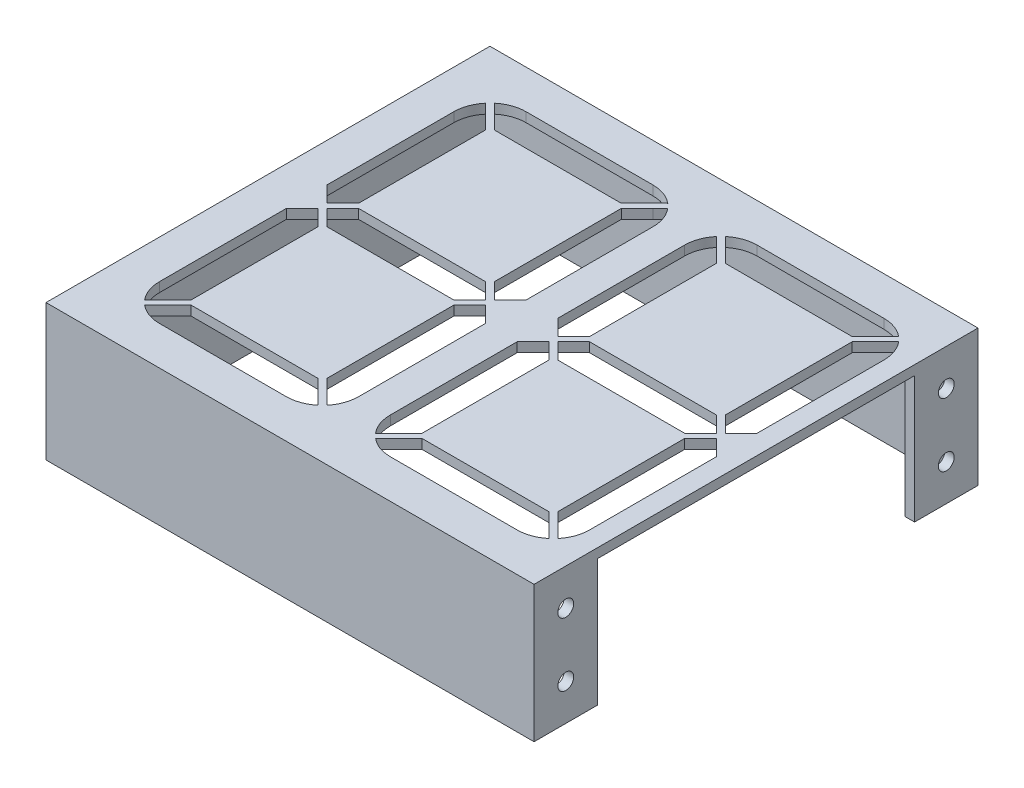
ISO-10303-21;
HEADER;
FILE_DESCRIPTION(('STEP AP214'),'2;1');
FILE_NAME('part.step','',(''),(''),'','','');
FILE_SCHEMA(('AUTOMOTIVE_DESIGN { 1 0 10303 214 1 1 1 1 }'));
ENDSEC;
DATA;
#1=APPLICATION_CONTEXT('core data for automotive mechanical design processes');
#2=APPLICATION_PROTOCOL_DEFINITION('international standard','automotive_design',2000,#1);
#3=PRODUCT_CONTEXT('',#1,'mechanical');
#4=PRODUCT('Part','Part','',(#3));
#5=PRODUCT_RELATED_PRODUCT_CATEGORY('part','',(#4));
#6=PRODUCT_DEFINITION_FORMATION('','',#4);
#7=PRODUCT_DEFINITION_CONTEXT('part definition',#1,'design');
#8=PRODUCT_DEFINITION('design','',#6,#7);
#9=PRODUCT_DEFINITION_SHAPE('','',#8);
#10=(LENGTH_UNIT() NAMED_UNIT(*) SI_UNIT(.MILLI.,.METRE.));
#11=(NAMED_UNIT(*) PLANE_ANGLE_UNIT() SI_UNIT($,.RADIAN.));
#12=(NAMED_UNIT(*) SI_UNIT($,.STERADIAN.) SOLID_ANGLE_UNIT());
#13=UNCERTAINTY_MEASURE_WITH_UNIT(LENGTH_MEASURE(1.E-05),#10,'distance_accuracy_value','');
#14=(GEOMETRIC_REPRESENTATION_CONTEXT(3) GLOBAL_UNCERTAINTY_ASSIGNED_CONTEXT((#13)) GLOBAL_UNIT_ASSIGNED_CONTEXT((#10,
#11,#12)) REPRESENTATION_CONTEXT('',''));
#15=CARTESIAN_POINT('',(0.,0.,0.));
#16=DIRECTION('',(0.,0.,1.));
#17=DIRECTION('',(1.,0.,0.));
#18=AXIS2_PLACEMENT_3D('',#15,#16,#17);
#19=CARTESIAN_POINT('',(0.,0.,0.));
#20=DIRECTION('',(0.,-1.,0.));
#21=DIRECTION('',(0.,0.,-1.));
#22=AXIS2_PLACEMENT_3D('',#19,#20,#21);
#23=PLANE('',#22);
#24=DIRECTION('',(-1.,0.,0.));
#25=VECTOR('',#24,1.);
#26=CARTESIAN_POINT('',(-16.41,0.,-5.));
#27=LINE('',#26,#25);
#28=CARTESIAN_POINT('',(-16.41,0.,-5.));
#29=VERTEX_POINT('',#28);
#30=CARTESIAN_POINT('',(-56.41,0.,-5.));
#31=VERTEX_POINT('',#30);
#32=EDGE_CURVE('E1361',#29,#31,#27,.T.);
#33=ORIENTED_EDGE('',*,*,#32,.T.);
#34=DIRECTION('',(-0.707106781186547,0.,0.707106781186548));
#35=VECTOR('',#34,1.);
#36=CARTESIAN_POINT('',(-56.41,0.,-5.));
#37=LINE('',#36,#35);
#38=CARTESIAN_POINT('',(-61.41,0.,0.));
#39=VERTEX_POINT('',#38);
#40=EDGE_CURVE('E1357',#31,#39,#37,.T.);
#41=ORIENTED_EDGE('',*,*,#40,.T.);
#42=DIRECTION('',(0.707106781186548,0.,0.707106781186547));
#43=VECTOR('',#42,1.);
#44=CARTESIAN_POINT('',(-61.41,0.,0.));
#45=LINE('',#44,#43);
#46=CARTESIAN_POINT('',(-56.41,0.,5.));
#47=VERTEX_POINT('',#46);
#48=EDGE_CURVE('E1375',#39,#47,#45,.T.);
#49=ORIENTED_EDGE('',*,*,#48,.T.);
#50=DIRECTION('',(1.,0.,0.));
#51=VECTOR('',#50,1.);
#52=CARTESIAN_POINT('',(-56.41,0.,5.));
#53=LINE('',#52,#51);
#54=CARTESIAN_POINT('',(-16.41,0.,5.));
#55=VERTEX_POINT('',#54);
#56=EDGE_CURVE('E1378',#47,#55,#53,.T.);
#57=ORIENTED_EDGE('',*,*,#56,.T.);
#58=DIRECTION('',(0.707106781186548,0.,-0.707106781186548));
#59=VECTOR('',#58,1.);
#60=CARTESIAN_POINT('',(-11.41,0.,0.));
#61=LINE('',#60,#59);
#62=CARTESIAN_POINT('',(-11.41,0.,0.));
#63=VERTEX_POINT('',#62);
#64=EDGE_CURVE('E1381',#55,#63,#61,.T.);
#65=ORIENTED_EDGE('',*,*,#64,.T.);
#66=DIRECTION('',(-0.707106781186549,0.,-0.707106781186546));
#67=VECTOR('',#66,1.);
#68=CARTESIAN_POINT('',(-16.41,0.,-5.));
#69=LINE('',#68,#67);
#70=EDGE_CURVE('E1384',#63,#29,#69,.T.);
#71=ORIENTED_EDGE('',*,*,#70,.T.);
#72=EDGE_LOOP('',(#33,#41,#49,#57,#65,#71));
#73=FACE_BOUND('',#72,.T.);
#74=DIRECTION('',(-0.707106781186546,0.,0.707106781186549));
#75=VECTOR('',#74,1.);
#76=CARTESIAN_POINT('',(-61.4099718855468,0.,52.8199680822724));
#77=LINE('',#76,#75);
#78=CARTESIAN_POINT('',(-56.4099718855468,0.,47.8199680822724));
#79=VERTEX_POINT('',#78);
#80=CARTESIAN_POINT('',(-63.7416255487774,0.,55.1516217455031));
#81=VERTEX_POINT('',#80);
#82=EDGE_CURVE('E1314',#79,#81,#77,.T.);
#83=ORIENTED_EDGE('',*,*,#82,.T.);
#84=CARTESIAN_POINT('',(-56.4099423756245,0.,46.413449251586));
#85=DIRECTION('',(0.,1.,0.));
#86=DIRECTION('',(0.,0.,1.));
#87=AXIS2_PLACEMENT_3D('',#84,#85,#86);
#88=CIRCLE('',#87,11.4065435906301);
#89=CARTESIAN_POINT('',(-56.4099364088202,0.,57.8199928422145));
#90=VERTEX_POINT('',#89);
#91=EDGE_CURVE('E1310',#81,#90,#88,.T.);
#92=ORIENTED_EDGE('',*,*,#91,.T.);
#93=DIRECTION('',(0.999999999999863,0.,-5.2310362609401E-07));
#94=VECTOR('',#93,1.);
#95=CARTESIAN_POINT('',(-16.4099704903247,0.,57.8199719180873));
#96=LINE('',#95,#94);
#97=CARTESIAN_POINT('',(-16.4099704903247,0.,57.8199719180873));
#98=VERTEX_POINT('',#97);
#99=EDGE_CURVE('E1328',#90,#98,#96,.T.);
#100=ORIENTED_EDGE('',*,*,#99,.T.);
#101=CARTESIAN_POINT('',(-16.4099764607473,0.,46.4065113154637));
#102=DIRECTION('',(0.,1.,0.));
#103=DIRECTION('',(0.,0.,1.));
#104=AXIS2_PLACEMENT_3D('',#101,#102,#103);
#105=CIRCLE('',#104,11.4134606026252);
#106=CARTESIAN_POINT('',(-9.07717025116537,0.,55.152769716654));
#107=VERTEX_POINT('',#106);
#108=EDGE_CURVE('E1331',#98,#107,#105,.T.);
#109=ORIENTED_EDGE('',*,*,#108,.T.);
#110=DIRECTION('',(-0.707106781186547,0.,-0.707106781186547));
#111=VECTOR('',#110,1.);
#112=CARTESIAN_POINT('',(-11.4099718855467,0.,52.8199680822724));
#113=LINE('',#112,#111);
#114=CARTESIAN_POINT('',(-16.4099718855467,0.,47.8199680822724));
#115=VERTEX_POINT('',#114);
#116=EDGE_CURVE('E1334',#107,#115,#113,.T.);
#117=ORIENTED_EDGE('',*,*,#116,.T.);
#118=DIRECTION('',(-1.,0.,0.));
#119=VECTOR('',#118,1.);
#120=CARTESIAN_POINT('',(-56.4099718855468,0.,47.8199680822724));
#121=LINE('',#120,#119);
#122=EDGE_CURVE('E1337',#115,#79,#121,.T.);
#123=ORIENTED_EDGE('',*,*,#122,.T.);
#124=EDGE_LOOP('',(#83,#92,#100,#109,#117,#123));
#125=FACE_BOUND('',#124,.T.);
#126=DIRECTION('',(0.,0.,-1.));
#127=VECTOR('',#126,1.);
#128=CARTESIAN_POINT('',(-4.99308604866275,0.,-6.41000276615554));
#129=LINE('',#128,#127);
#130=CARTESIAN_POINT('',(-4.99308604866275,0.,-6.41000276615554));
#131=VERTEX_POINT('',#130);
#132=CARTESIAN_POINT('',(-4.99308604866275,0.,-46.4030881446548));
#133=VERTEX_POINT('',#132);
#134=EDGE_CURVE('E1262',#131,#133,#129,.T.);
#135=ORIENTED_EDGE('',*,*,#134,.T.);
#136=CARTESIAN_POINT('',(-16.41,0.,-46.4030881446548));
#137=DIRECTION('',(0.,1.,0.));
#138=DIRECTION('',(0.,0.,-1.));
#139=AXIS2_PLACEMENT_3D('',#136,#137,#138);
#140=CIRCLE('',#139,11.4169139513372);
#141=CARTESIAN_POINT('',(-7.66385899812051,0.,-53.7414082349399));
#142=VERTEX_POINT('',#141);
#143=EDGE_CURVE('E1258',#133,#142,#140,.T.);
#144=ORIENTED_EDGE('',*,*,#143,.T.);
#145=DIRECTION('',(-0.707595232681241,0.,0.70661799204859));
#146=VECTOR('',#145,1.);
#147=CARTESIAN_POINT('',(-9.99578434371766,0.,-51.4127034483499));
#148=LINE('',#147,#146);
#149=CARTESIAN_POINT('',(-9.99578434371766,0.,-51.4127034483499));
#150=VERTEX_POINT('',#149);
#151=EDGE_CURVE('E1278',#142,#150,#148,.T.);
#152=ORIENTED_EDGE('',*,*,#151,.T.);
#153=DIRECTION('',(-0.707106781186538,0.,0.707106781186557));
#154=VECTOR('',#153,1.);
#155=CARTESIAN_POINT('',(-9.99578434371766,0.,-51.4127034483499));
#156=LINE('',#155,#154);
#157=CARTESIAN_POINT('',(-14.9957843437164,0.,-46.412703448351));
#158=VERTEX_POINT('',#157);
#159=EDGE_CURVE('E1281',#150,#158,#156,.T.);
#160=ORIENTED_EDGE('',*,*,#159,.T.);
#161=DIRECTION('',(0.,0.,1.));
#162=VECTOR('',#161,1.);
#163=CARTESIAN_POINT('',(-14.9957843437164,0.,-46.412703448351));
#164=LINE('',#163,#162);
#165=CARTESIAN_POINT('',(-14.9957843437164,0.,-6.41421356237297));
#166=VERTEX_POINT('',#165);
#167=EDGE_CURVE('E1284',#158,#166,#164,.T.);
#168=ORIENTED_EDGE('',*,*,#167,.T.);
#169=DIRECTION('',(0.707106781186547,0.,0.707106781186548));
#170=VECTOR('',#169,1.);
#171=CARTESIAN_POINT('',(-14.9957843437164,0.,-6.41421356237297));
#172=LINE('',#171,#170);
#173=CARTESIAN_POINT('',(-9.99578434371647,0.,-1.41421356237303));
#174=VERTEX_POINT('',#173);
#175=EDGE_CURVE('E1287',#166,#174,#172,.T.);
#176=ORIENTED_EDGE('',*,*,#175,.T.);
#177=DIRECTION('',(0.707595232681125,0.,-0.706617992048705));
#178=VECTOR('',#177,1.);
#179=CARTESIAN_POINT('',(-9.99578434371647,0.,-1.41421356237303));
#180=LINE('',#179,#178);
#181=EDGE_CURVE('E1290',#174,#131,#180,.T.);
#182=ORIENTED_EDGE('',*,*,#181,.T.);
#183=EDGE_LOOP('',(#135,#144,#152,#160,#168,#176,#182));
#184=FACE_BOUND('',#183,.T.);
#185=DIRECTION('',(2.61551812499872E-07,0.,0.999999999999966));
#186=VECTOR('',#185,1.);
#187=CARTESIAN_POINT('',(-67.8164964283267,0.,6.41345223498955));
#188=LINE('',#187,#186);
#189=CARTESIAN_POINT('',(-67.8164964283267,0.,6.41345223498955));
#190=VERTEX_POINT('',#189);
#191=CARTESIAN_POINT('',(-67.8164859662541,0.,46.4134522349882));
#192=VERTEX_POINT('',#191);
#193=EDGE_CURVE('E1217',#190,#192,#188,.T.);
#194=ORIENTED_EDGE('',*,*,#193,.T.);
#195=CARTESIAN_POINT('',(-56.4099423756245,0.,46.413449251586));
#196=DIRECTION('',(0.,1.,0.));
#197=DIRECTION('',(0.,0.,1.));
#198=AXIS2_PLACEMENT_3D('',#195,#196,#197);
#199=CIRCLE('',#198,11.4065435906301);
#200=CARTESIAN_POINT('',(-65.1488266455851,0.,53.7442840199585));
#201=VERTEX_POINT('',#200);
#202=EDGE_CURVE('E1213',#192,#201,#199,.T.);
#203=ORIENTED_EDGE('',*,*,#202,.T.);
#204=DIRECTION('',(0.707106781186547,0.,-0.707106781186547));
#205=VECTOR('',#204,1.);
#206=CARTESIAN_POINT('',(-62.8172391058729,0.,51.4126964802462));
#207=LINE('',#206,#205);
#208=CARTESIAN_POINT('',(-57.8172391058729,0.,46.4126964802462));
#209=VERTEX_POINT('',#208);
#210=EDGE_CURVE('E1231',#201,#209,#207,.T.);
#211=ORIENTED_EDGE('',*,*,#210,.T.);
#212=DIRECTION('',(0.,0.,-1.));
#213=VECTOR('',#212,1.);
#214=CARTESIAN_POINT('',(-57.8172391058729,0.,46.4126964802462));
#215=LINE('',#214,#213);
#216=CARTESIAN_POINT('',(-57.8172391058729,0.,6.41420659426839));
#217=VERTEX_POINT('',#216);
#218=EDGE_CURVE('E1234',#209,#217,#215,.T.);
#219=ORIENTED_EDGE('',*,*,#218,.T.);
#220=DIRECTION('',(-0.707106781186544,0.,-0.707106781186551));
#221=VECTOR('',#220,1.);
#222=CARTESIAN_POINT('',(-57.8172391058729,0.,6.41420659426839));
#223=LINE('',#222,#221);
#224=CARTESIAN_POINT('',(-62.8172449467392,0.,1.41420075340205));
#225=VERTEX_POINT('',#224);
#226=EDGE_CURVE('E1237',#217,#225,#223,.T.);
#227=ORIENTED_EDGE('',*,*,#226,.T.);
#228=DIRECTION('',(-0.707106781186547,0.,0.707106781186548));
#229=VECTOR('',#228,1.);
#230=CARTESIAN_POINT('',(-62.8172449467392,0.,1.41420075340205));
#231=LINE('',#230,#229);
#232=EDGE_CURVE('E1240',#225,#190,#231,.T.);
#233=ORIENTED_EDGE('',*,*,#232,.T.);
#234=EDGE_LOOP('',(#194,#203,#211,#219,#227,#233));
#235=FACE_BOUND('',#234,.T.);
#236=DIRECTION('',(0.707106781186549,0.,0.707106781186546));
#237=VECTOR('',#236,1.);
#238=CARTESIAN_POINT('',(-62.8242135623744,0.,-1.41421356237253));
#239=LINE('',#238,#237);
#240=CARTESIAN_POINT('',(-67.8234585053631,0.,-6.41345850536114));
#241=VERTEX_POINT('',#240);
#242=CARTESIAN_POINT('',(-62.8242135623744,0.,-1.41421356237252));
#243=VERTEX_POINT('',#242);
#244=EDGE_CURVE('E1171',#241,#243,#239,.T.);
#245=ORIENTED_EDGE('',*,*,#244,.T.);
#246=DIRECTION('',(0.707106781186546,0.,-0.707106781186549));
#247=VECTOR('',#246,1.);
#248=CARTESIAN_POINT('',(-57.8242135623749,0.,-6.41421356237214));
#249=LINE('',#248,#247);
#250=CARTESIAN_POINT('',(-57.8242135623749,0.,-6.41421356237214));
#251=VERTEX_POINT('',#250);
#252=EDGE_CURVE('E1167',#243,#251,#249,.T.);
#253=ORIENTED_EDGE('',*,*,#252,.T.);
#254=DIRECTION('',(0.,0.,-1.));
#255=VECTOR('',#254,1.);
#256=CARTESIAN_POINT('',(-57.824213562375,0.,-46.4127034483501));
#257=LINE('',#256,#255);
#258=CARTESIAN_POINT('',(-57.824213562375,0.,-46.4127034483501));
#259=VERTEX_POINT('',#258);
#260=EDGE_CURVE('E1185',#251,#259,#257,.T.);
#261=ORIENTED_EDGE('',*,*,#260,.T.);
#262=DIRECTION('',(-0.707106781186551,0.,-0.707106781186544));
#263=VECTOR('',#262,1.);
#264=CARTESIAN_POINT('',(-62.8242135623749,0.,-51.4127034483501));
#265=LINE('',#264,#263);
#266=CARTESIAN_POINT('',(-65.1558011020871,0.,-53.7442909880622));
#267=VERTEX_POINT('',#266);
#268=EDGE_CURVE('E1188',#259,#267,#265,.T.);
#269=ORIENTED_EDGE('',*,*,#268,.T.);
#270=CARTESIAN_POINT('',(-56.4169149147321,0.,-46.413458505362));
#271=DIRECTION('',(0.,1.,0.));
#272=DIRECTION('',(0.,0.,-1.));
#273=AXIS2_PLACEMENT_3D('',#270,#271,#272);
#274=CIRCLE('',#273,11.4065435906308);
#275=CARTESIAN_POINT('',(-67.823458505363,0.,-46.4134585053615));
#276=VERTEX_POINT('',#275);
#277=EDGE_CURVE('E1191',#267,#276,#274,.T.);
#278=ORIENTED_EDGE('',*,*,#277,.T.);
#279=DIRECTION('',(0.,0.,1.));
#280=VECTOR('',#279,1.);
#281=CARTESIAN_POINT('',(-67.8234585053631,0.,-6.41345850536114));
#282=LINE('',#281,#280);
#283=EDGE_CURVE('E1194',#276,#241,#282,.T.);
#284=ORIENTED_EDGE('',*,*,#283,.T.);
#285=EDGE_LOOP('',(#245,#253,#261,#269,#278,#284));
#286=FACE_BOUND('',#285,.T.);
#287=DIRECTION('',(-5.23103626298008E-07,0.,-0.999999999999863));
#288=VECTOR('',#287,1.);
#289=CARTESIAN_POINT('',(-4.99653677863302,0.,6.41345589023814));
#290=LINE('',#289,#288);
#291=CARTESIAN_POINT('',(-4.99651585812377,0.,46.4065053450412));
#292=VERTEX_POINT('',#291);
#293=CARTESIAN_POINT('',(-4.99653677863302,0.,6.41345589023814));
#294=VERTEX_POINT('',#293);
#295=EDGE_CURVE('E1125',#292,#294,#290,.T.);
#296=ORIENTED_EDGE('',*,*,#295,.T.);
#297=DIRECTION('',(-0.706617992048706,0.,-0.707595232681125));
#298=VECTOR('',#297,1.);
#299=CARTESIAN_POINT('',(-9.99578434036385,0.,1.40729445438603));
#300=LINE('',#299,#298);
#301=CARTESIAN_POINT('',(-9.99578434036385,0.,1.40729445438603));
#302=VERTEX_POINT('',#301);
#303=EDGE_CURVE('E1121',#294,#302,#300,.T.);
#304=ORIENTED_EDGE('',*,*,#303,.T.);
#305=DIRECTION('',(-0.707106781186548,0.,0.707106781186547));
#306=VECTOR('',#305,1.);
#307=CARTESIAN_POINT('',(-14.9957843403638,0.,6.40729445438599));
#308=LINE('',#307,#306);
#309=CARTESIAN_POINT('',(-14.9957843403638,0.,6.40729445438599));
#310=VERTEX_POINT('',#309);
#311=EDGE_CURVE('E1139',#302,#310,#308,.T.);
#312=ORIENTED_EDGE('',*,*,#311,.T.);
#313=DIRECTION('',(0.,0.,1.));
#314=VECTOR('',#313,1.);
#315=CARTESIAN_POINT('',(-14.9957843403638,0.,46.4057843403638));
#316=LINE('',#315,#314);
#317=CARTESIAN_POINT('',(-14.9957843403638,0.,46.4057843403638));
#318=VERTEX_POINT('',#317);
#319=EDGE_CURVE('E1142',#310,#318,#316,.T.);
#320=ORIENTED_EDGE('',*,*,#319,.T.);
#321=DIRECTION('',(0.707106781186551,0.,0.707106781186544));
#322=VECTOR('',#321,1.);
#323=CARTESIAN_POINT('',(-9.9957843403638,0.,51.4057843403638));
#324=LINE('',#323,#322);
#325=CARTESIAN_POINT('',(-7.66304911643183,0.,53.7385195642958));
#326=VERTEX_POINT('',#325);
#327=EDGE_CURVE('E1145',#318,#326,#324,.T.);
#328=ORIENTED_EDGE('',*,*,#327,.T.);
#329=CARTESIAN_POINT('',(-16.4099764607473,0.,46.4065113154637));
#330=DIRECTION('',(0.,1.,0.));
#331=DIRECTION('',(0.,0.,1.));
#332=AXIS2_PLACEMENT_3D('',#329,#330,#331);
#333=CIRCLE('',#332,11.413460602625);
#334=EDGE_CURVE('E1148',#326,#292,#333,.T.);
#335=ORIENTED_EDGE('',*,*,#334,.T.);
#336=EDGE_LOOP('',(#296,#304,#312,#320,#328,#335));
#337=FACE_BOUND('',#336,.T.);
#338=DIRECTION('',(0.707595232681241,0.,-0.706617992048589));
#339=VECTOR('',#338,1.);
#340=CARTESIAN_POINT('',(-11.4169149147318,0.,-52.8200020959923));
#341=LINE('',#340,#339);
#342=CARTESIAN_POINT('',(-11.4169149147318,0.,-52.8200020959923));
#343=VERTEX_POINT('',#342);
#344=CARTESIAN_POINT('',(-9.07863100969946,0.,-55.1550566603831));
#345=VERTEX_POINT('',#344);
#346=EDGE_CURVE('E1072',#343,#345,#341,.T.);
#347=ORIENTED_EDGE('',*,*,#346,.T.);
#348=CARTESIAN_POINT('',(-16.41,0.,-46.4030881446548));
#349=DIRECTION('',(0.,1.,0.));
#350=DIRECTION('',(0.,0.,-1.));
#351=AXIS2_PLACEMENT_3D('',#348,#349,#350);
#352=CIRCLE('',#351,11.4169139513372);
#353=CARTESIAN_POINT('',(-16.41,0.,-57.8200020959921));
#354=VERTEX_POINT('',#353);
#355=EDGE_CURVE('E1068',#345,#354,#352,.T.);
#356=ORIENTED_EDGE('',*,*,#355,.T.);
#357=DIRECTION('',(-1.,0.,0.));
#358=VECTOR('',#357,1.);
#359=CARTESIAN_POINT('',(-56.4169149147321,0.,-57.8200020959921));
#360=LINE('',#359,#358);
#361=CARTESIAN_POINT('',(-56.4169149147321,0.,-57.8200020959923));
#362=VERTEX_POINT('',#361);
#363=EDGE_CURVE('E1088',#354,#362,#360,.T.);
#364=ORIENTED_EDGE('',*,*,#363,.T.);
#365=CARTESIAN_POINT('',(-56.4169149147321,0.,-46.413458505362));
#366=DIRECTION('',(0.,1.,0.));
#367=DIRECTION('',(0.,0.,-1.));
#368=AXIS2_PLACEMENT_3D('',#365,#366,#367);
#369=CIRCLE('',#368,11.4065435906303);
#370=CARTESIAN_POINT('',(-63.748568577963,0.,-55.1516557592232));
#371=VERTEX_POINT('',#370);
#372=EDGE_CURVE('E1091',#362,#371,#369,.T.);
#373=ORIENTED_EDGE('',*,*,#372,.T.);
#374=DIRECTION('',(0.707106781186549,0.,0.707106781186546));
#375=VECTOR('',#374,1.);
#376=CARTESIAN_POINT('',(-56.4169149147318,0.,-47.820002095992));
#377=LINE('',#376,#375);
#378=CARTESIAN_POINT('',(-56.4169149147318,0.,-47.820002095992));
#379=VERTEX_POINT('',#378);
#380=EDGE_CURVE('E1094',#371,#379,#377,.T.);
#381=ORIENTED_EDGE('',*,*,#380,.T.);
#382=DIRECTION('',(1.,0.,0.));
#383=VECTOR('',#382,1.);
#384=CARTESIAN_POINT('',(-16.416914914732,0.,-47.8200020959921));
#385=LINE('',#384,#383);
#386=CARTESIAN_POINT('',(-16.416914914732,0.,-47.8200020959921));
#387=VERTEX_POINT('',#386);
#388=EDGE_CURVE('E1097',#379,#387,#385,.T.);
#389=ORIENTED_EDGE('',*,*,#388,.T.);
#390=DIRECTION('',(0.707106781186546,0.,-0.707106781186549));
#391=VECTOR('',#390,1.);
#392=CARTESIAN_POINT('',(-16.416914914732,0.,-47.8200020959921));
#393=LINE('',#392,#391);
#394=EDGE_CURVE('E1100',#387,#343,#393,.T.);
#395=ORIENTED_EDGE('',*,*,#394,.T.);
#396=EDGE_LOOP('',(#347,#356,#364,#373,#381,#389,#395));
#397=FACE_BOUND('',#396,.T.);
#398=DIRECTION('',(-5.23103628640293E-07,0.,0.999999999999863));
#399=VECTOR('',#398,1.);
#400=CARTESIAN_POINT('',(4.99653677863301,0.,6.41345589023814));
#401=LINE('',#400,#399);
#402=CARTESIAN_POINT('',(4.99653677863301,0.,6.41345589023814));
#403=VERTEX_POINT('',#402);
#404=CARTESIAN_POINT('',(4.99651585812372,0.,46.406505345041));
#405=VERTEX_POINT('',#404);
#406=EDGE_CURVE('E1027',#403,#405,#401,.T.);
#407=ORIENTED_EDGE('',*,*,#406,.T.);
#408=CARTESIAN_POINT('',(16.4099764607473,0.,46.4065113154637));
#409=DIRECTION('',(0.,1.,0.));
#410=DIRECTION('',(0.,0.,-1.));
#411=AXIS2_PLACEMENT_3D('',#408,#409,#410);
#412=CIRCLE('',#411,11.4134606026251);
#413=CARTESIAN_POINT('',(7.66304911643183,0.,53.7385195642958));
#414=VERTEX_POINT('',#413);
#415=EDGE_CURVE('E1023',#405,#414,#412,.T.);
#416=ORIENTED_EDGE('',*,*,#415,.T.);
#417=DIRECTION('',(0.707106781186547,0.,-0.707106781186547));
#418=VECTOR('',#417,1.);
#419=CARTESIAN_POINT('',(9.9957843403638,0.,51.4057843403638));
#420=LINE('',#419,#418);
#421=CARTESIAN_POINT('',(14.9957843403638,0.,46.4057843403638));
#422=VERTEX_POINT('',#421);
#423=EDGE_CURVE('E1041',#414,#422,#420,.T.);
#424=ORIENTED_EDGE('',*,*,#423,.T.);
#425=DIRECTION('',(0.,0.,-1.));
#426=VECTOR('',#425,1.);
#427=CARTESIAN_POINT('',(14.9957843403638,0.,46.4057843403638));
#428=LINE('',#427,#426);
#429=CARTESIAN_POINT('',(14.9957843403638,0.,6.40729445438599));
#430=VERTEX_POINT('',#429);
#431=EDGE_CURVE('E1044',#422,#430,#428,.T.);
#432=ORIENTED_EDGE('',*,*,#431,.T.);
#433=DIRECTION('',(-0.707106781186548,0.,-0.707106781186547));
#434=VECTOR('',#433,1.);
#435=CARTESIAN_POINT('',(14.9957843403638,0.,6.40729445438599));
#436=LINE('',#435,#434);
#437=CARTESIAN_POINT('',(9.99578434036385,0.,1.40729445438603));
#438=VERTEX_POINT('',#437);
#439=EDGE_CURVE('E1047',#430,#438,#436,.T.);
#440=ORIENTED_EDGE('',*,*,#439,.T.);
#441=DIRECTION('',(-0.706617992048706,0.,0.707595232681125));
#442=VECTOR('',#441,1.);
#443=CARTESIAN_POINT('',(9.99578434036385,0.,1.40729445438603));
#444=LINE('',#443,#442);
#445=EDGE_CURVE('E1050',#438,#403,#444,.T.);
#446=ORIENTED_EDGE('',*,*,#445,.T.);
#447=EDGE_LOOP('',(#407,#416,#424,#432,#440,#446));
#448=FACE_BOUND('',#447,.T.);
#449=DIRECTION('',(0.999999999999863,0.,5.23103628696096E-07));
#450=VECTOR('',#449,1.);
#451=CARTESIAN_POINT('',(16.4099704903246,0.,57.8199719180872));
#452=LINE('',#451,#450);
#453=CARTESIAN_POINT('',(16.4099704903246,0.,57.8199719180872));
#454=VERTEX_POINT('',#453);
#455=CARTESIAN_POINT('',(56.4099364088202,0.,57.8199928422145));
#456=VERTEX_POINT('',#455);
#457=EDGE_CURVE('E981',#454,#456,#452,.T.);
#458=ORIENTED_EDGE('',*,*,#457,.T.);
#459=CARTESIAN_POINT('',(56.4099423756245,0.,46.413449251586));
#460=DIRECTION('',(0.,1.,0.));
#461=DIRECTION('',(0.,0.,-1.));
#462=AXIS2_PLACEMENT_3D('',#459,#460,#461);
#463=CIRCLE('',#462,11.4065435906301);
#464=CARTESIAN_POINT('',(63.7416255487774,0.,55.1516217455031));
#465=VERTEX_POINT('',#464);
#466=EDGE_CURVE('E977',#456,#465,#463,.T.);
#467=ORIENTED_EDGE('',*,*,#466,.T.);
#468=DIRECTION('',(-0.707106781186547,0.,-0.707106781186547));
#469=VECTOR('',#468,1.);
#470=CARTESIAN_POINT('',(61.4099718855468,0.,52.8199680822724));
#471=LINE('',#470,#469);
#472=CARTESIAN_POINT('',(56.4099718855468,0.,47.8199680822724));
#473=VERTEX_POINT('',#472);
#474=EDGE_CURVE('E995',#465,#473,#471,.T.);
#475=ORIENTED_EDGE('',*,*,#474,.T.);
#476=DIRECTION('',(-1.,0.,0.));
#477=VECTOR('',#476,1.);
#478=CARTESIAN_POINT('',(56.4099718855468,0.,47.8199680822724));
#479=LINE('',#478,#477);
#480=CARTESIAN_POINT('',(16.4099718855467,0.,47.8199680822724));
#481=VERTEX_POINT('',#480);
#482=EDGE_CURVE('E998',#473,#481,#479,.T.);
#483=ORIENTED_EDGE('',*,*,#482,.T.);
#484=DIRECTION('',(-0.707106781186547,0.,0.707106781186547));
#485=VECTOR('',#484,1.);
#486=CARTESIAN_POINT('',(11.4099718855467,0.,52.8199680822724));
#487=LINE('',#486,#485);
#488=CARTESIAN_POINT('',(9.07717025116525,0.,55.1527697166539));
#489=VERTEX_POINT('',#488);
#490=EDGE_CURVE('E1001',#481,#489,#487,.T.);
#491=ORIENTED_EDGE('',*,*,#490,.T.);
#492=CARTESIAN_POINT('',(16.4099764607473,0.,46.4065113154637));
#493=DIRECTION('',(0.,1.,0.));
#494=DIRECTION('',(0.,0.,-1.));
#495=AXIS2_PLACEMENT_3D('',#492,#493,#494);
#496=CIRCLE('',#495,11.4134606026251);
#497=EDGE_CURVE('E1004',#489,#454,#496,.T.);
#498=ORIENTED_EDGE('',*,*,#497,.T.);
#499=EDGE_LOOP('',(#458,#467,#475,#483,#491,#498));
#500=FACE_BOUND('',#499,.T.);
#501=DIRECTION('',(-0.707595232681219,0.,-0.706617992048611));
#502=VECTOR('',#501,1.);
#503=CARTESIAN_POINT('',(9.99578434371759,0.,-51.4127034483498));
#504=LINE('',#503,#502);
#505=CARTESIAN_POINT('',(9.99578434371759,0.,-51.4127034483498));
#506=VERTEX_POINT('',#505);
#507=CARTESIAN_POINT('',(7.6638589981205,0.,-53.7414082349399));
#508=VERTEX_POINT('',#507);
#509=EDGE_CURVE('E929',#506,#508,#504,.T.);
#510=ORIENTED_EDGE('',*,*,#509,.T.);
#511=CARTESIAN_POINT('',(16.41,0.,-46.4030881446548));
#512=DIRECTION('',(0.,1.,0.));
#513=DIRECTION('',(0.,0.,1.));
#514=AXIS2_PLACEMENT_3D('',#511,#512,#513);
#515=CIRCLE('',#514,11.4169139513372);
#516=CARTESIAN_POINT('',(4.99308604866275,0.,-46.4030881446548));
#517=VERTEX_POINT('',#516);
#518=EDGE_CURVE('E925',#508,#517,#515,.T.);
#519=ORIENTED_EDGE('',*,*,#518,.T.);
#520=DIRECTION('',(0.,0.,1.));
#521=VECTOR('',#520,1.);
#522=CARTESIAN_POINT('',(4.99308604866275,0.,-6.41000276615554));
#523=LINE('',#522,#521);
#524=CARTESIAN_POINT('',(4.99308604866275,0.,-6.41000276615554));
#525=VERTEX_POINT('',#524);
#526=EDGE_CURVE('E945',#517,#525,#523,.T.);
#527=ORIENTED_EDGE('',*,*,#526,.T.);
#528=DIRECTION('',(0.707595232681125,0.,0.706617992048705));
#529=VECTOR('',#528,1.);
#530=CARTESIAN_POINT('',(9.99578434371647,0.,-1.41421356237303));
#531=LINE('',#530,#529);
#532=CARTESIAN_POINT('',(9.99578434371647,0.,-1.41421356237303));
#533=VERTEX_POINT('',#532);
#534=EDGE_CURVE('E948',#525,#533,#531,.T.);
#535=ORIENTED_EDGE('',*,*,#534,.T.);
#536=DIRECTION('',(0.707106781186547,0.,-0.707106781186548));
#537=VECTOR('',#536,1.);
#538=CARTESIAN_POINT('',(14.9957843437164,0.,-6.41421356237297));
#539=LINE('',#538,#537);
#540=CARTESIAN_POINT('',(14.9957843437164,0.,-6.41421356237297));
#541=VERTEX_POINT('',#540);
#542=EDGE_CURVE('E951',#533,#541,#539,.T.);
#543=ORIENTED_EDGE('',*,*,#542,.T.);
#544=DIRECTION('',(0.,0.,-1.));
#545=VECTOR('',#544,1.);
#546=CARTESIAN_POINT('',(14.9957843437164,0.,-46.412703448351));
#547=LINE('',#546,#545);
#548=CARTESIAN_POINT('',(14.9957843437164,0.,-46.412703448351));
#549=VERTEX_POINT('',#548);
#550=EDGE_CURVE('E954',#541,#549,#547,.T.);
#551=ORIENTED_EDGE('',*,*,#550,.T.);
#552=DIRECTION('',(-0.707106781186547,0.,-0.707106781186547));
#553=VECTOR('',#552,1.);
#554=CARTESIAN_POINT('',(9.99578434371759,0.,-51.4127034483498));
#555=LINE('',#554,#553);
#556=EDGE_CURVE('E957',#549,#506,#555,.T.);
#557=ORIENTED_EDGE('',*,*,#556,.T.);
#558=EDGE_LOOP('',(#510,#519,#527,#535,#543,#551,#557));
#559=FACE_BOUND('',#558,.T.);
#560=DIRECTION('',(0.707106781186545,0.,-0.70710678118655));
#561=VECTOR('',#560,1.);
#562=CARTESIAN_POINT('',(61.4169149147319,0.,-52.8200020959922));
#563=LINE('',#562,#561);
#564=CARTESIAN_POINT('',(56.4169149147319,0.,-47.8200020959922));
#565=VERTEX_POINT('',#564);
#566=CARTESIAN_POINT('',(63.7485685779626,0.,-55.1516557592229));
#567=VERTEX_POINT('',#566);
#568=EDGE_CURVE('E876',#565,#567,#563,.T.);
#569=ORIENTED_EDGE('',*,*,#568,.T.);
#570=CARTESIAN_POINT('',(56.4169149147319,0.,-46.4134585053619));
#571=DIRECTION('',(0.,1.,0.));
#572=DIRECTION('',(0.,0.,1.));
#573=AXIS2_PLACEMENT_3D('',#570,#571,#572);
#574=CIRCLE('',#573,11.4065435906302);
#575=CARTESIAN_POINT('',(56.4169149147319,0.,-57.8200020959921));
#576=VERTEX_POINT('',#575);
#577=EDGE_CURVE('E872',#567,#576,#574,.T.);
#578=ORIENTED_EDGE('',*,*,#577,.T.);
#579=DIRECTION('',(-1.,0.,0.));
#580=VECTOR('',#579,1.);
#581=CARTESIAN_POINT('',(56.4169149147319,0.,-57.8200020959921));
#582=LINE('',#581,#580);
#583=CARTESIAN_POINT('',(16.41,0.,-57.8200020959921));
#584=VERTEX_POINT('',#583);
#585=EDGE_CURVE('E892',#576,#584,#582,.T.);
#586=ORIENTED_EDGE('',*,*,#585,.T.);
#587=CARTESIAN_POINT('',(16.41,0.,-46.4030881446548));
#588=DIRECTION('',(0.,1.,0.));
#589=DIRECTION('',(0.,0.,1.));
#590=AXIS2_PLACEMENT_3D('',#587,#588,#589);
#591=CIRCLE('',#590,11.4169139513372);
#592=CARTESIAN_POINT('',(9.07863100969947,0.,-55.1550566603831));
#593=VERTEX_POINT('',#592);
#594=EDGE_CURVE('E895',#584,#593,#591,.T.);
#595=ORIENTED_EDGE('',*,*,#594,.T.);
#596=DIRECTION('',(0.707595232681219,0.,0.706617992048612));
#597=VECTOR('',#596,1.);
#598=CARTESIAN_POINT('',(11.4169149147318,0.,-52.8200020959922));
#599=LINE('',#598,#597);
#600=CARTESIAN_POINT('',(11.4169149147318,0.,-52.8200020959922));
#601=VERTEX_POINT('',#600);
#602=EDGE_CURVE('E898',#593,#601,#599,.T.);
#603=ORIENTED_EDGE('',*,*,#602,.T.);
#604=DIRECTION('',(0.707106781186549,0.,0.707106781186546));
#605=VECTOR('',#604,1.);
#606=CARTESIAN_POINT('',(16.4169149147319,0.,-47.8200020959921));
#607=LINE('',#606,#605);
#608=CARTESIAN_POINT('',(16.4169149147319,0.,-47.8200020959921));
#609=VERTEX_POINT('',#608);
#610=EDGE_CURVE('E901',#601,#609,#607,.T.);
#611=ORIENTED_EDGE('',*,*,#610,.T.);
#612=DIRECTION('',(1.,0.,0.));
#613=VECTOR('',#612,1.);
#614=CARTESIAN_POINT('',(16.4169149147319,0.,-47.8200020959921));
#615=LINE('',#614,#613);
#616=EDGE_CURVE('E904',#609,#565,#615,.T.);
#617=ORIENTED_EDGE('',*,*,#616,.T.);
#618=EDGE_LOOP('',(#569,#578,#586,#595,#603,#611,#617));
#619=FACE_BOUND('',#618,.T.);
#620=DIRECTION('',(0.,0.,-1.));
#621=VECTOR('',#620,1.);
#622=CARTESIAN_POINT('',(67.8234585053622,0.,-6.41345850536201));
#623=LINE('',#622,#621);
#624=CARTESIAN_POINT('',(67.8234585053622,0.,-6.41345850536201));
#625=VERTEX_POINT('',#624);
#626=CARTESIAN_POINT('',(67.8234585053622,0.,-46.413458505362));
#627=VERTEX_POINT('',#626);
#628=EDGE_CURVE('E831',#625,#627,#623,.T.);
#629=ORIENTED_EDGE('',*,*,#628,.T.);
#630=CARTESIAN_POINT('',(56.4169149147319,0.,-46.4134585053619));
#631=DIRECTION('',(0.,1.,0.));
#632=DIRECTION('',(0.,0.,1.));
#633=AXIS2_PLACEMENT_3D('',#630,#631,#632);
#634=CIRCLE('',#633,11.4065435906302);
#635=CARTESIAN_POINT('',(65.1558011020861,0.,-53.7442909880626));
#636=VERTEX_POINT('',#635);
#637=EDGE_CURVE('E827',#627,#636,#634,.T.);
#638=ORIENTED_EDGE('',*,*,#637,.T.);
#639=DIRECTION('',(-0.707106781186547,0.,0.707106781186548));
#640=VECTOR('',#639,1.);
#641=CARTESIAN_POINT('',(62.8242135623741,0.,-51.4127034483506));
#642=LINE('',#641,#640);
#643=CARTESIAN_POINT('',(57.8242135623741,0.,-46.4127034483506));
#644=VERTEX_POINT('',#643);
#645=EDGE_CURVE('E845',#636,#644,#642,.T.);
#646=ORIENTED_EDGE('',*,*,#645,.T.);
#647=DIRECTION('',(0.,0.,1.));
#648=VECTOR('',#647,1.);
#649=CARTESIAN_POINT('',(57.8242135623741,0.,-46.4127034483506));
#650=LINE('',#649,#648);
#651=CARTESIAN_POINT('',(57.8242135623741,0.,-6.41421356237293));
#652=VERTEX_POINT('',#651);
#653=EDGE_CURVE('E848',#644,#652,#650,.T.);
#654=ORIENTED_EDGE('',*,*,#653,.T.);
#655=DIRECTION('',(0.70710678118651,0.,0.707106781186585));
#656=VECTOR('',#655,1.);
#657=CARTESIAN_POINT('',(57.8242135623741,0.,-6.41421356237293));
#658=LINE('',#657,#656);
#659=CARTESIAN_POINT('',(62.8242135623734,0.,-1.41421356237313));
#660=VERTEX_POINT('',#659);
#661=EDGE_CURVE('E851',#652,#660,#658,.T.);
#662=ORIENTED_EDGE('',*,*,#661,.T.);
#663=DIRECTION('',(0.707106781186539,0.,-0.707106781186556));
#664=VECTOR('',#663,1.);
#665=CARTESIAN_POINT('',(62.8242135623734,0.,-1.41421356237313));
#666=LINE('',#665,#664);
#667=EDGE_CURVE('E854',#660,#625,#666,.T.);
#668=ORIENTED_EDGE('',*,*,#667,.T.);
#669=EDGE_LOOP('',(#629,#638,#646,#654,#662,#668));
#670=FACE_BOUND('',#669,.T.);
#671=DIRECTION('',(0.70710678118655,0.,0.707106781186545));
#672=VECTOR('',#671,1.);
#673=CARTESIAN_POINT('',(62.8172391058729,0.,51.4126964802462));
#674=LINE('',#673,#672);
#675=CARTESIAN_POINT('',(57.8172391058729,0.,46.4126964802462));
#676=VERTEX_POINT('',#675);
#677=CARTESIAN_POINT('',(65.1488266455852,0.,53.7442840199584));
#678=VERTEX_POINT('',#677);
#679=EDGE_CURVE('E785',#676,#678,#674,.T.);
#680=ORIENTED_EDGE('',*,*,#679,.T.);
#681=CARTESIAN_POINT('',(56.4099423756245,0.,46.413449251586));
#682=DIRECTION('',(0.,1.,0.));
#683=DIRECTION('',(0.,0.,-1.));
#684=AXIS2_PLACEMENT_3D('',#681,#682,#683);
#685=CIRCLE('',#684,11.4065435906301);
#686=CARTESIAN_POINT('',(67.8164859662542,0.,46.4134522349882));
#687=VERTEX_POINT('',#686);
#688=EDGE_CURVE('E781',#678,#687,#685,.T.);
#689=ORIENTED_EDGE('',*,*,#688,.T.);
#690=DIRECTION('',(2.61551814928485E-07,0.,-0.999999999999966));
#691=VECTOR('',#690,1.);
#692=CARTESIAN_POINT('',(67.8164964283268,0.,6.41345223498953));
#693=LINE('',#692,#691);
#694=CARTESIAN_POINT('',(67.8164964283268,0.,6.41345223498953));
#695=VERTEX_POINT('',#694);
#696=EDGE_CURVE('E799',#687,#695,#693,.T.);
#697=ORIENTED_EDGE('',*,*,#696,.T.);
#698=DIRECTION('',(-0.707106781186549,0.,-0.707106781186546));
#699=VECTOR('',#698,1.);
#700=CARTESIAN_POINT('',(62.8172449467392,0.,1.41420075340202));
#701=LINE('',#700,#699);
#702=CARTESIAN_POINT('',(62.8172449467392,0.,1.41420075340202));
#703=VERTEX_POINT('',#702);
#704=EDGE_CURVE('E802',#695,#703,#701,.T.);
#705=ORIENTED_EDGE('',*,*,#704,.T.);
#706=DIRECTION('',(-0.707106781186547,0.,0.707106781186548));
#707=VECTOR('',#706,1.);
#708=CARTESIAN_POINT('',(57.8172391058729,0.,6.41420659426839));
#709=LINE('',#708,#707);
#710=CARTESIAN_POINT('',(57.8172391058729,0.,6.41420659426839));
#711=VERTEX_POINT('',#710);
#712=EDGE_CURVE('E805',#703,#711,#709,.T.);
#713=ORIENTED_EDGE('',*,*,#712,.T.);
#714=DIRECTION('',(0.,0.,1.));
#715=VECTOR('',#714,1.);
#716=CARTESIAN_POINT('',(57.8172391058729,0.,46.4126964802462));
#717=LINE('',#716,#715);
#718=EDGE_CURVE('E808',#711,#676,#717,.T.);
#719=ORIENTED_EDGE('',*,*,#718,.T.);
#720=EDGE_LOOP('',(#680,#689,#697,#705,#713,#719));
#721=FACE_BOUND('',#720,.T.);
#722=DIRECTION('',(0.707106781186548,0.,-0.707106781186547));
#723=VECTOR('',#722,1.);
#724=CARTESIAN_POINT('',(61.41,0.,0.));
#725=LINE('',#724,#723);
#726=CARTESIAN_POINT('',(56.41,0.,5.));
#727=VERTEX_POINT('',#726);
#728=CARTESIAN_POINT('',(61.41,0.,0.));
#729=VERTEX_POINT('',#728);
#730=EDGE_CURVE('E745',#727,#729,#725,.T.);
#731=ORIENTED_EDGE('',*,*,#730,.T.);
#732=DIRECTION('',(-0.707106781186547,0.,-0.707106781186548));
#733=VECTOR('',#732,1.);
#734=CARTESIAN_POINT('',(56.41,0.,-5.));
#735=LINE('',#734,#733);
#736=CARTESIAN_POINT('',(56.41,0.,-5.));
#737=VERTEX_POINT('',#736);
#738=EDGE_CURVE('E59',#729,#737,#735,.T.);
#739=ORIENTED_EDGE('',*,*,#738,.T.);
#740=DIRECTION('',(-1.,0.,0.));
#741=VECTOR('',#740,1.);
#742=CARTESIAN_POINT('',(16.41,0.,-5.00000000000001));
#743=LINE('',#742,#741);
#744=CARTESIAN_POINT('',(16.41,0.,-5.00000000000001));
#745=VERTEX_POINT('',#744);
#746=EDGE_CURVE('E757',#737,#745,#743,.T.);
#747=ORIENTED_EDGE('',*,*,#746,.T.);
#748=DIRECTION('',(-0.707106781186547,0.,0.707106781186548));
#749=VECTOR('',#748,1.);
#750=CARTESIAN_POINT('',(16.41,0.,-5.00000000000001));
#751=LINE('',#750,#749);
#752=CARTESIAN_POINT('',(11.41,0.,0.));
#753=VERTEX_POINT('',#752);
#754=EDGE_CURVE('E760',#745,#753,#751,.T.);
#755=ORIENTED_EDGE('',*,*,#754,.T.);
#756=DIRECTION('',(0.707106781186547,0.,0.707106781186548));
#757=VECTOR('',#756,1.);
#758=CARTESIAN_POINT('',(11.41,0.,0.));
#759=LINE('',#758,#757);
#760=CARTESIAN_POINT('',(16.41,0.,5.));
#761=VERTEX_POINT('',#760);
#762=EDGE_CURVE('E763',#753,#761,#759,.T.);
#763=ORIENTED_EDGE('',*,*,#762,.T.);
#764=DIRECTION('',(1.,0.,0.));
#765=VECTOR('',#764,1.);
#766=CARTESIAN_POINT('',(56.41,0.,5.));
#767=LINE('',#766,#765);
#768=EDGE_CURVE('E766',#761,#727,#767,.T.);
#769=ORIENTED_EDGE('',*,*,#768,.T.);
#770=EDGE_LOOP('',(#731,#739,#747,#755,#763,#769));
#771=FACE_BOUND('',#770,.T.);
#772=DIRECTION('',(0.,0.,-1.));
#773=VECTOR('',#772,1.);
#774=CARTESIAN_POINT('',(70.9134585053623,0.,-66.9999823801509));
#775=LINE('',#774,#773);
#776=CARTESIAN_POINT('',(70.9134585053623,0.,-49.9999823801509));
#777=VERTEX_POINT('',#776);
#778=CARTESIAN_POINT('',(70.9134585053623,0.,-66.9999823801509));
#779=VERTEX_POINT('',#778);
#780=EDGE_CURVE('E710',#777,#779,#775,.T.);
#781=ORIENTED_EDGE('',*,*,#780,.F.);
#782=DIRECTION('',(-1.,0.,0.));
#783=VECTOR('',#782,1.);
#784=CARTESIAN_POINT('',(70.9134585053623,0.,-49.9999823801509));
#785=LINE('',#784,#783);
#786=CARTESIAN_POINT('',(73.9134585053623,0.,-49.9999823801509));
#787=VERTEX_POINT('',#786);
#788=EDGE_CURVE('E708',#787,#777,#785,.T.);
#789=ORIENTED_EDGE('',*,*,#788,.F.);
#790=DIRECTION('',(0.,0.,-1.));
#791=VECTOR('',#790,1.);
#792=CARTESIAN_POINT('',(73.9134585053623,0.,-69.9999823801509));
#793=LINE('',#792,#791);
#794=CARTESIAN_POINT('',(73.9134585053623,0.,49.9999823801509));
#795=VERTEX_POINT('',#794);
#796=EDGE_CURVE('E1402',#795,#787,#793,.T.);
#797=ORIENTED_EDGE('',*,*,#796,.F.);
#798=DIRECTION('',(1.,0.,0.));
#799=VECTOR('',#798,1.);
#800=CARTESIAN_POINT('',(70.9134585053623,0.,49.9999823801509));
#801=LINE('',#800,#799);
#802=CARTESIAN_POINT('',(70.9134585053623,0.,49.9999823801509));
#803=VERTEX_POINT('',#802);
#804=EDGE_CURVE('E681',#803,#795,#801,.T.);
#805=ORIENTED_EDGE('',*,*,#804,.F.);
#806=DIRECTION('',(0.,0.,-1.));
#807=VECTOR('',#806,1.);
#808=CARTESIAN_POINT('',(70.9134585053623,0.,49.9999823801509));
#809=LINE('',#808,#807);
#810=CARTESIAN_POINT('',(70.9134585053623,0.,66.9999823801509));
#811=VERTEX_POINT('',#810);
#812=EDGE_CURVE('E683',#811,#803,#809,.T.);
#813=ORIENTED_EDGE('',*,*,#812,.F.);
#814=DIRECTION('',(1.,0.,0.));
#815=VECTOR('',#814,1.);
#816=CARTESIAN_POINT('',(70.9134585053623,0.,66.9999823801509));
#817=LINE('',#816,#815);
#818=CARTESIAN_POINT('',(-77.,0.,66.9999823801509));
#819=VERTEX_POINT('',#818);
#820=EDGE_CURVE('E717',#819,#811,#817,.T.);
#821=ORIENTED_EDGE('',*,*,#820,.F.);
#822=DIRECTION('',(0.,0.,1.));
#823=VECTOR('',#822,1.);
#824=CARTESIAN_POINT('',(-77.,0.,-66.9999823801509));
#825=LINE('',#824,#823);
#826=CARTESIAN_POINT('',(-77.,0.,-66.9999823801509));
#827=VERTEX_POINT('',#826);
#828=EDGE_CURVE('E715',#827,#819,#825,.T.);
#829=ORIENTED_EDGE('',*,*,#828,.F.);
#830=DIRECTION('',(-1.,0.,0.));
#831=VECTOR('',#830,1.);
#832=CARTESIAN_POINT('',(70.9134585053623,0.,-66.9999823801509));
#833=LINE('',#832,#831);
#834=EDGE_CURVE('E713',#779,#827,#833,.T.);
#835=ORIENTED_EDGE('',*,*,#834,.F.);
#836=EDGE_LOOP('',(#781,#789,#797,#805,#813,#821,#829,#835));
#837=FACE_BOUND('',#836,.T.);
#838=ADVANCED_FACE('F36',(#73,#125,#184,#235,#286,#337,#397,#448,#500,#559,#619,#670,#721,#771,
#837),#23,.T.);
#839=CARTESIAN_POINT('',(0.,3.,0.));
#840=DIRECTION('',(0.,-1.,0.));
#841=DIRECTION('',(0.,0.,-1.));
#842=AXIS2_PLACEMENT_3D('',#839,#840,#841);
#843=PLANE('',#842);
#844=CARTESIAN_POINT('',(56.4099423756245,3.,46.413449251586));
#845=DIRECTION('',(0.,1.,0.));
#846=DIRECTION('',(0.,0.,-1.));
#847=AXIS2_PLACEMENT_3D('',#844,#845,#846);
#848=CIRCLE('',#847,11.4065435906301);
#849=CARTESIAN_POINT('',(65.1488266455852,3.,53.7442840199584));
#850=VERTEX_POINT('',#849);
#851=CARTESIAN_POINT('',(67.8164859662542,3.,46.4134522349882));
#852=VERTEX_POINT('',#851);
#853=EDGE_CURVE('E782',#850,#852,#848,.T.);
#854=ORIENTED_EDGE('',*,*,#853,.F.);
#855=DIRECTION('',(0.707106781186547,0.,0.707106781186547));
#856=VECTOR('',#855,1.);
#857=CARTESIAN_POINT('',(62.8172391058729,3.,51.4126964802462));
#858=LINE('',#857,#856);
#859=CARTESIAN_POINT('',(57.8172391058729,3.,46.4126964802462));
#860=VERTEX_POINT('',#859);
#861=EDGE_CURVE('E794',#860,#850,#858,.T.);
#862=ORIENTED_EDGE('',*,*,#861,.F.);
#863=DIRECTION('',(0.,0.,1.));
#864=VECTOR('',#863,1.);
#865=CARTESIAN_POINT('',(57.8172391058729,3.,46.4126964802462));
#866=LINE('',#865,#864);
#867=CARTESIAN_POINT('',(57.8172391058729,3.,6.41420659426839));
#868=VERTEX_POINT('',#867);
#869=EDGE_CURVE('E791',#868,#860,#866,.T.);
#870=ORIENTED_EDGE('',*,*,#869,.F.);
#871=DIRECTION('',(-0.707106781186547,0.,0.707106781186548));
#872=VECTOR('',#871,1.);
#873=CARTESIAN_POINT('',(57.8172391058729,3.,6.41420659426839));
#874=LINE('',#873,#872);
#875=CARTESIAN_POINT('',(62.8172449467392,3.,1.41420075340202));
#876=VERTEX_POINT('',#875);
#877=EDGE_CURVE('E789',#876,#868,#874,.T.);
#878=ORIENTED_EDGE('',*,*,#877,.F.);
#879=DIRECTION('',(-0.707106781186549,0.,-0.707106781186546));
#880=VECTOR('',#879,1.);
#881=CARTESIAN_POINT('',(62.8172449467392,3.,1.41420075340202));
#882=LINE('',#881,#880);
#883=CARTESIAN_POINT('',(67.8164964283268,3.,6.41345223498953));
#884=VERTEX_POINT('',#883);
#885=EDGE_CURVE('E787',#884,#876,#882,.T.);
#886=ORIENTED_EDGE('',*,*,#885,.F.);
#887=DIRECTION('',(2.61551814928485E-07,0.,-0.999999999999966));
#888=VECTOR('',#887,1.);
#889=CARTESIAN_POINT('',(67.8164964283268,3.,6.41345223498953));
#890=LINE('',#889,#888);
#891=EDGE_CURVE('E784',#852,#884,#890,.T.);
#892=ORIENTED_EDGE('',*,*,#891,.F.);
#893=EDGE_LOOP('',(#854,#862,#870,#878,#886,#892));
#894=FACE_BOUND('',#893,.T.);
#895=CARTESIAN_POINT('',(56.4169149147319,3.,-46.4134585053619));
#896=DIRECTION('',(0.,1.,0.));
#897=DIRECTION('',(0.,0.,1.));
#898=AXIS2_PLACEMENT_3D('',#895,#896,#897);
#899=CIRCLE('',#898,11.4065435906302);
#900=CARTESIAN_POINT('',(63.7485685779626,3.,-55.1516557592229));
#901=VERTEX_POINT('',#900);
#902=CARTESIAN_POINT('',(56.4169149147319,3.,-57.8200020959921));
#903=VERTEX_POINT('',#902);
#904=EDGE_CURVE('E873',#901,#903,#899,.T.);
#905=ORIENTED_EDGE('',*,*,#904,.F.);
#906=DIRECTION('',(0.707106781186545,0.,-0.70710678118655));
#907=VECTOR('',#906,1.);
#908=CARTESIAN_POINT('',(56.4169149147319,3.,-47.8200020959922));
#909=LINE('',#908,#907);
#910=CARTESIAN_POINT('',(56.4169149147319,3.,-47.8200020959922));
#911=VERTEX_POINT('',#910);
#912=EDGE_CURVE('E887',#911,#901,#909,.T.);
#913=ORIENTED_EDGE('',*,*,#912,.F.);
#914=DIRECTION('',(1.,0.,0.));
#915=VECTOR('',#914,1.);
#916=CARTESIAN_POINT('',(16.4169149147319,3.,-47.8200020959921));
#917=LINE('',#916,#915);
#918=CARTESIAN_POINT('',(16.4169149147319,3.,-47.8200020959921));
#919=VERTEX_POINT('',#918);
#920=EDGE_CURVE('E884',#919,#911,#917,.T.);
#921=ORIENTED_EDGE('',*,*,#920,.F.);
#922=DIRECTION('',(0.707106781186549,0.,0.707106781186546));
#923=VECTOR('',#922,1.);
#924=CARTESIAN_POINT('',(16.4169149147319,3.,-47.8200020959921));
#925=LINE('',#924,#923);
#926=CARTESIAN_POINT('',(11.4169149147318,3.,-52.8200020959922));
#927=VERTEX_POINT('',#926);
#928=EDGE_CURVE('E882',#927,#919,#925,.T.);
#929=ORIENTED_EDGE('',*,*,#928,.F.);
#930=DIRECTION('',(0.707595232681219,0.,0.706617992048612));
#931=VECTOR('',#930,1.);
#932=CARTESIAN_POINT('',(11.4169149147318,3.,-52.8200020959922));
#933=LINE('',#932,#931);
#934=CARTESIAN_POINT('',(9.07863100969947,3.,-55.1550566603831));
#935=VERTEX_POINT('',#934);
#936=EDGE_CURVE('E880',#935,#927,#933,.T.);
#937=ORIENTED_EDGE('',*,*,#936,.F.);
#938=CARTESIAN_POINT('',(16.41,3.,-46.4030881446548));
#939=DIRECTION('',(0.,1.,0.));
#940=DIRECTION('',(0.,0.,1.));
#941=AXIS2_PLACEMENT_3D('',#938,#939,#940);
#942=CIRCLE('',#941,11.4169139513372);
#943=CARTESIAN_POINT('',(16.41,3.,-57.8200020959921));
#944=VERTEX_POINT('',#943);
#945=EDGE_CURVE('E878',#944,#935,#942,.T.);
#946=ORIENTED_EDGE('',*,*,#945,.F.);
#947=DIRECTION('',(-1.,0.,0.));
#948=VECTOR('',#947,1.);
#949=CARTESIAN_POINT('',(56.4169149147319,3.,-57.8200020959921));
#950=LINE('',#949,#948);
#951=EDGE_CURVE('E875',#903,#944,#950,.T.);
#952=ORIENTED_EDGE('',*,*,#951,.F.);
#953=EDGE_LOOP('',(#905,#913,#921,#929,#937,#946,#952));
#954=FACE_BOUND('',#953,.T.);
#955=CARTESIAN_POINT('',(56.4099423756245,3.,46.413449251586));
#956=DIRECTION('',(0.,1.,0.));
#957=DIRECTION('',(0.,0.,-1.));
#958=AXIS2_PLACEMENT_3D('',#955,#956,#957);
#959=CIRCLE('',#958,11.4065435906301);
#960=CARTESIAN_POINT('',(56.4099364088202,3.,57.8199928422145));
#961=VERTEX_POINT('',#960);
#962=CARTESIAN_POINT('',(63.7416255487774,3.,55.1516217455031));
#963=VERTEX_POINT('',#962);
#964=EDGE_CURVE('E978',#961,#963,#959,.T.);
#965=ORIENTED_EDGE('',*,*,#964,.F.);
#966=DIRECTION('',(0.999999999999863,0.,5.23103628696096E-07));
#967=VECTOR('',#966,1.);
#968=CARTESIAN_POINT('',(16.4099704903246,3.,57.8199719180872));
#969=LINE('',#968,#967);
#970=CARTESIAN_POINT('',(16.4099704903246,3.,57.8199719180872));
#971=VERTEX_POINT('',#970);
#972=EDGE_CURVE('E990',#971,#961,#969,.T.);
#973=ORIENTED_EDGE('',*,*,#972,.F.);
#974=CARTESIAN_POINT('',(16.4099764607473,3.,46.4065113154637));
#975=DIRECTION('',(0.,1.,0.));
#976=DIRECTION('',(0.,0.,-1.));
#977=AXIS2_PLACEMENT_3D('',#974,#975,#976);
#978=CIRCLE('',#977,11.4134606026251);
#979=CARTESIAN_POINT('',(9.07717025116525,3.,55.1527697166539));
#980=VERTEX_POINT('',#979);
#981=EDGE_CURVE('E987',#980,#971,#978,.T.);
#982=ORIENTED_EDGE('',*,*,#981,.F.);
#983=DIRECTION('',(-0.707106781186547,0.,0.707106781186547));
#984=VECTOR('',#983,1.);
#985=CARTESIAN_POINT('',(11.4099718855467,3.,52.8199680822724));
#986=LINE('',#985,#984);
#987=CARTESIAN_POINT('',(16.4099718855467,3.,47.8199680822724));
#988=VERTEX_POINT('',#987);
#989=EDGE_CURVE('E985',#988,#980,#986,.T.);
#990=ORIENTED_EDGE('',*,*,#989,.F.);
#991=DIRECTION('',(-1.,0.,0.));
#992=VECTOR('',#991,1.);
#993=CARTESIAN_POINT('',(56.4099718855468,3.,47.8199680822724));
#994=LINE('',#993,#992);
#995=CARTESIAN_POINT('',(56.4099718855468,3.,47.8199680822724));
#996=VERTEX_POINT('',#995);
#997=EDGE_CURVE('E983',#996,#988,#994,.T.);
#998=ORIENTED_EDGE('',*,*,#997,.F.);
#999=DIRECTION('',(-0.707106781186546,0.,-0.707106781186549));
#1000=VECTOR('',#999,1.);
#1001=CARTESIAN_POINT('',(61.4099718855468,3.,52.8199680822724));
#1002=LINE('',#1001,#1000);
#1003=EDGE_CURVE('E980',#963,#996,#1002,.T.);
#1004=ORIENTED_EDGE('',*,*,#1003,.F.);
#1005=EDGE_LOOP('',(#965,#973,#982,#990,#998,#1004));
#1006=FACE_BOUND('',#1005,.T.);
#1007=CARTESIAN_POINT('',(-16.41,3.,-46.4030881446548));
#1008=DIRECTION('',(0.,1.,0.));
#1009=DIRECTION('',(0.,0.,-1.));
#1010=AXIS2_PLACEMENT_3D('',#1007,#1008,#1009);
#1011=CIRCLE('',#1010,11.4169139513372);
#1012=CARTESIAN_POINT('',(-9.07863100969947,3.,-55.1550566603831));
#1013=VERTEX_POINT('',#1012);
#1014=CARTESIAN_POINT('',(-16.41,3.,-57.8200020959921));
#1015=VERTEX_POINT('',#1014);
#1016=EDGE_CURVE('E1069',#1013,#1015,#1011,.T.);
#1017=ORIENTED_EDGE('',*,*,#1016,.F.);
#1018=DIRECTION('',(0.707595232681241,0.,-0.706617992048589));
#1019=VECTOR('',#1018,1.);
#1020=CARTESIAN_POINT('',(-11.4169149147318,3.,-52.8200020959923));
#1021=LINE('',#1020,#1019);
#1022=CARTESIAN_POINT('',(-11.4169149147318,3.,-52.8200020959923));
#1023=VERTEX_POINT('',#1022);
#1024=EDGE_CURVE('E1083',#1023,#1013,#1021,.T.);
#1025=ORIENTED_EDGE('',*,*,#1024,.F.);
#1026=DIRECTION('',(0.707106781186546,0.,-0.707106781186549));
#1027=VECTOR('',#1026,1.);
#1028=CARTESIAN_POINT('',(-16.416914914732,3.,-47.8200020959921));
#1029=LINE('',#1028,#1027);
#1030=CARTESIAN_POINT('',(-16.416914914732,3.,-47.8200020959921));
#1031=VERTEX_POINT('',#1030);
#1032=EDGE_CURVE('E1080',#1031,#1023,#1029,.T.);
#1033=ORIENTED_EDGE('',*,*,#1032,.F.);
#1034=DIRECTION('',(1.,0.,0.));
#1035=VECTOR('',#1034,1.);
#1036=CARTESIAN_POINT('',(-16.416914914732,3.,-47.8200020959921));
#1037=LINE('',#1036,#1035);
#1038=CARTESIAN_POINT('',(-56.4169149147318,3.,-47.820002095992));
#1039=VERTEX_POINT('',#1038);
#1040=EDGE_CURVE('E1078',#1039,#1031,#1037,.T.);
#1041=ORIENTED_EDGE('',*,*,#1040,.F.);
#1042=DIRECTION('',(0.707106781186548,0.,0.707106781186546));
#1043=VECTOR('',#1042,1.);
#1044=CARTESIAN_POINT('',(-61.4169149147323,3.,-52.8200020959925));
#1045=LINE('',#1044,#1043);
#1046=CARTESIAN_POINT('',(-63.748568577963,3.,-55.1516557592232));
#1047=VERTEX_POINT('',#1046);
#1048=EDGE_CURVE('E1076',#1047,#1039,#1045,.T.);
#1049=ORIENTED_EDGE('',*,*,#1048,.F.);
#1050=CARTESIAN_POINT('',(-56.4169149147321,3.,-46.413458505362));
#1051=DIRECTION('',(0.,1.,0.));
#1052=DIRECTION('',(0.,0.,-1.));
#1053=AXIS2_PLACEMENT_3D('',#1050,#1051,#1052);
#1054=CIRCLE('',#1053,11.4065435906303);
#1055=CARTESIAN_POINT('',(-56.4169149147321,3.,-57.8200020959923));
#1056=VERTEX_POINT('',#1055);
#1057=EDGE_CURVE('E1074',#1056,#1047,#1054,.T.);
#1058=ORIENTED_EDGE('',*,*,#1057,.F.);
#1059=DIRECTION('',(-1.,0.,0.));
#1060=VECTOR('',#1059,1.);
#1061=CARTESIAN_POINT('',(-56.4169149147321,3.,-57.8200020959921));
#1062=LINE('',#1061,#1060);
#1063=EDGE_CURVE('E1071',#1015,#1056,#1062,.T.);
#1064=ORIENTED_EDGE('',*,*,#1063,.F.);
#1065=EDGE_LOOP('',(#1017,#1025,#1033,#1041,#1049,#1058,#1064));
#1066=FACE_BOUND('',#1065,.T.);
#1067=DIRECTION('',(0.707106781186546,0.,-0.707106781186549));
#1068=VECTOR('',#1067,1.);
#1069=CARTESIAN_POINT('',(-57.8242135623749,3.,-6.41421356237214));
#1070=LINE('',#1069,#1068);
#1071=CARTESIAN_POINT('',(-62.8242135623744,3.,-1.41421356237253));
#1072=VERTEX_POINT('',#1071);
#1073=CARTESIAN_POINT('',(-57.8242135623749,3.,-6.41421356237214));
#1074=VERTEX_POINT('',#1073);
#1075=EDGE_CURVE('E1168',#1072,#1074,#1070,.T.);
#1076=ORIENTED_EDGE('',*,*,#1075,.F.);
#1077=DIRECTION('',(0.707106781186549,0.,0.707106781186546));
#1078=VECTOR('',#1077,1.);
#1079=CARTESIAN_POINT('',(-62.8242135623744,3.,-1.41421356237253));
#1080=LINE('',#1079,#1078);
#1081=CARTESIAN_POINT('',(-67.8234585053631,3.,-6.41345850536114));
#1082=VERTEX_POINT('',#1081);
#1083=EDGE_CURVE('E1180',#1082,#1072,#1080,.T.);
#1084=ORIENTED_EDGE('',*,*,#1083,.F.);
#1085=DIRECTION('',(0.,0.,1.));
#1086=VECTOR('',#1085,1.);
#1087=CARTESIAN_POINT('',(-67.8234585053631,3.,-6.41345850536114));
#1088=LINE('',#1087,#1086);
#1089=CARTESIAN_POINT('',(-67.823458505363,3.,-46.4134585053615));
#1090=VERTEX_POINT('',#1089);
#1091=EDGE_CURVE('E1177',#1090,#1082,#1088,.T.);
#1092=ORIENTED_EDGE('',*,*,#1091,.F.);
#1093=CARTESIAN_POINT('',(-56.4169149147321,3.,-46.413458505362));
#1094=DIRECTION('',(0.,1.,0.));
#1095=DIRECTION('',(0.,0.,-1.));
#1096=AXIS2_PLACEMENT_3D('',#1093,#1094,#1095);
#1097=CIRCLE('',#1096,11.4065435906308);
#1098=CARTESIAN_POINT('',(-65.1558011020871,3.,-53.7442909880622));
#1099=VERTEX_POINT('',#1098);
#1100=EDGE_CURVE('E1175',#1099,#1090,#1097,.T.);
#1101=ORIENTED_EDGE('',*,*,#1100,.F.);
#1102=DIRECTION('',(-0.707106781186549,0.,-0.707106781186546));
#1103=VECTOR('',#1102,1.);
#1104=CARTESIAN_POINT('',(-62.8242135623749,3.,-51.4127034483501));
#1105=LINE('',#1104,#1103);
#1106=CARTESIAN_POINT('',(-57.824213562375,3.,-46.4127034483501));
#1107=VERTEX_POINT('',#1106);
#1108=EDGE_CURVE('E1173',#1107,#1099,#1105,.T.);
#1109=ORIENTED_EDGE('',*,*,#1108,.F.);
#1110=DIRECTION('',(0.,0.,-1.));
#1111=VECTOR('',#1110,1.);
#1112=CARTESIAN_POINT('',(-57.824213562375,3.,-46.4127034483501));
#1113=LINE('',#1112,#1111);
#1114=EDGE_CURVE('E1170',#1074,#1107,#1113,.T.);
#1115=ORIENTED_EDGE('',*,*,#1114,.F.);
#1116=EDGE_LOOP('',(#1076,#1084,#1092,#1101,#1109,#1115));
#1117=FACE_BOUND('',#1116,.T.);
#1118=CARTESIAN_POINT('',(-16.41,3.,-46.4030881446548));
#1119=DIRECTION('',(0.,1.,0.));
#1120=DIRECTION('',(0.,0.,-1.));
#1121=AXIS2_PLACEMENT_3D('',#1118,#1119,#1120);
#1122=CIRCLE('',#1121,11.4169139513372);
#1123=CARTESIAN_POINT('',(-4.99308604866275,3.,-46.4030881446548));
#1124=VERTEX_POINT('',#1123);
#1125=CARTESIAN_POINT('',(-7.66385899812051,3.,-53.7414082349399));
#1126=VERTEX_POINT('',#1125);
#1127=EDGE_CURVE('E1259',#1124,#1126,#1122,.T.);
#1128=ORIENTED_EDGE('',*,*,#1127,.F.);
#1129=DIRECTION('',(0.,0.,-1.));
#1130=VECTOR('',#1129,1.);
#1131=CARTESIAN_POINT('',(-4.99308604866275,3.,-6.41000276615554));
#1132=LINE('',#1131,#1130);
#1133=CARTESIAN_POINT('',(-4.99308604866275,3.,-6.41000276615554));
#1134=VERTEX_POINT('',#1133);
#1135=EDGE_CURVE('E1273',#1134,#1124,#1132,.T.);
#1136=ORIENTED_EDGE('',*,*,#1135,.F.);
#1137=DIRECTION('',(0.707595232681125,0.,-0.706617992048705));
#1138=VECTOR('',#1137,1.);
#1139=CARTESIAN_POINT('',(-9.99578434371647,3.,-1.41421356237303));
#1140=LINE('',#1139,#1138);
#1141=CARTESIAN_POINT('',(-9.99578434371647,3.,-1.41421356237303));
#1142=VERTEX_POINT('',#1141);
#1143=EDGE_CURVE('E1270',#1142,#1134,#1140,.T.);
#1144=ORIENTED_EDGE('',*,*,#1143,.F.);
#1145=DIRECTION('',(0.707106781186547,0.,0.707106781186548));
#1146=VECTOR('',#1145,1.);
#1147=CARTESIAN_POINT('',(-14.9957843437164,3.,-6.41421356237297));
#1148=LINE('',#1147,#1146);
#1149=CARTESIAN_POINT('',(-14.9957843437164,3.,-6.41421356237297));
#1150=VERTEX_POINT('',#1149);
#1151=EDGE_CURVE('E1268',#1150,#1142,#1148,.T.);
#1152=ORIENTED_EDGE('',*,*,#1151,.F.);
#1153=DIRECTION('',(0.,0.,1.));
#1154=VECTOR('',#1153,1.);
#1155=CARTESIAN_POINT('',(-14.9957843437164,3.,-46.412703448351));
#1156=LINE('',#1155,#1154);
#1157=CARTESIAN_POINT('',(-14.9957843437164,3.,-46.412703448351));
#1158=VERTEX_POINT('',#1157);
#1159=EDGE_CURVE('E1266',#1158,#1150,#1156,.T.);
#1160=ORIENTED_EDGE('',*,*,#1159,.F.);
#1161=DIRECTION('',(-0.707106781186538,0.,0.707106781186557));
#1162=VECTOR('',#1161,1.);
#1163=CARTESIAN_POINT('',(-9.99578434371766,3.,-51.4127034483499));
#1164=LINE('',#1163,#1162);
#1165=CARTESIAN_POINT('',(-9.99578434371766,3.,-51.4127034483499));
#1166=VERTEX_POINT('',#1165);
#1167=EDGE_CURVE('E1264',#1166,#1158,#1164,.T.);
#1168=ORIENTED_EDGE('',*,*,#1167,.F.);
#1169=DIRECTION('',(-0.707595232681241,0.,0.70661799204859));
#1170=VECTOR('',#1169,1.);
#1171=CARTESIAN_POINT('',(-9.99578434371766,3.,-51.4127034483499));
#1172=LINE('',#1171,#1170);
#1173=EDGE_CURVE('E1261',#1126,#1166,#1172,.T.);
#1174=ORIENTED_EDGE('',*,*,#1173,.F.);
#1175=EDGE_LOOP('',(#1128,#1136,#1144,#1152,#1160,#1168,#1174));
#1176=FACE_BOUND('',#1175,.T.);
#1177=DIRECTION('',(-0.707106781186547,0.,0.707106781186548));
#1178=VECTOR('',#1177,1.);
#1179=CARTESIAN_POINT('',(-56.41,3.,-5.));
#1180=LINE('',#1179,#1178);
#1181=CARTESIAN_POINT('',(-56.41,3.,-5.));
#1182=VERTEX_POINT('',#1181);
#1183=CARTESIAN_POINT('',(-61.41,3.,0.));
#1184=VERTEX_POINT('',#1183);
#1185=EDGE_CURVE('E1358',#1182,#1184,#1180,.T.);
#1186=ORIENTED_EDGE('',*,*,#1185,.F.);
#1187=DIRECTION('',(-1.,0.,0.));
#1188=VECTOR('',#1187,1.);
#1189=CARTESIAN_POINT('',(-16.41,3.,-5.));
#1190=LINE('',#1189,#1188);
#1191=CARTESIAN_POINT('',(-16.41,3.,-5.));
#1192=VERTEX_POINT('',#1191);
#1193=EDGE_CURVE('E1370',#1192,#1182,#1190,.T.);
#1194=ORIENTED_EDGE('',*,*,#1193,.F.);
#1195=DIRECTION('',(-0.707106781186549,0.,-0.707106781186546));
#1196=VECTOR('',#1195,1.);
#1197=CARTESIAN_POINT('',(-16.41,3.,-5.));
#1198=LINE('',#1197,#1196);
#1199=CARTESIAN_POINT('',(-11.41,3.,0.));
#1200=VERTEX_POINT('',#1199);
#1201=EDGE_CURVE('E1367',#1200,#1192,#1198,.T.);
#1202=ORIENTED_EDGE('',*,*,#1201,.F.);
#1203=DIRECTION('',(0.707106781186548,0.,-0.707106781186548));
#1204=VECTOR('',#1203,1.);
#1205=CARTESIAN_POINT('',(-11.41,3.,0.));
#1206=LINE('',#1205,#1204);
#1207=CARTESIAN_POINT('',(-16.41,3.,5.));
#1208=VERTEX_POINT('',#1207);
#1209=EDGE_CURVE('E1365',#1208,#1200,#1206,.T.);
#1210=ORIENTED_EDGE('',*,*,#1209,.F.);
#1211=DIRECTION('',(1.,0.,0.));
#1212=VECTOR('',#1211,1.);
#1213=CARTESIAN_POINT('',(-56.41,3.,5.));
#1214=LINE('',#1213,#1212);
#1215=CARTESIAN_POINT('',(-56.41,3.,5.));
#1216=VERTEX_POINT('',#1215);
#1217=EDGE_CURVE('E1363',#1216,#1208,#1214,.T.);
#1218=ORIENTED_EDGE('',*,*,#1217,.F.);
#1219=DIRECTION('',(0.707106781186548,0.,0.707106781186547));
#1220=VECTOR('',#1219,1.);
#1221=CARTESIAN_POINT('',(-61.41,3.,0.));
#1222=LINE('',#1221,#1220);
#1223=EDGE_CURVE('E1360',#1184,#1216,#1222,.T.);
#1224=ORIENTED_EDGE('',*,*,#1223,.F.);
#1225=EDGE_LOOP('',(#1186,#1194,#1202,#1210,#1218,#1224));
#1226=FACE_BOUND('',#1225,.T.);
#1227=DIRECTION('',(0.,0.,1.));
#1228=VECTOR('',#1227,1.);
#1229=CARTESIAN_POINT('',(-80.,3.,69.9999823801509));
#1230=LINE('',#1229,#1228);
#1231=CARTESIAN_POINT('',(-80.,3.,-69.9999823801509));
#1232=VERTEX_POINT('',#1231);
#1233=CARTESIAN_POINT('',(-80.,3.,69.9999823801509));
#1234=VERTEX_POINT('',#1233);
#1235=EDGE_CURVE('E661',#1232,#1234,#1230,.T.);
#1236=ORIENTED_EDGE('',*,*,#1235,.T.);
#1237=DIRECTION('',(1.,0.,0.));
#1238=VECTOR('',#1237,1.);
#1239=CARTESIAN_POINT('',(73.9134585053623,3.,69.9999823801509));
#1240=LINE('',#1239,#1238);
#1241=CARTESIAN_POINT('',(73.9134585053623,3.,69.9999823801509));
#1242=VERTEX_POINT('',#1241);
#1243=EDGE_CURVE('E1404',#1234,#1242,#1240,.T.);
#1244=ORIENTED_EDGE('',*,*,#1243,.T.);
#1245=DIRECTION('',(0.,0.,-1.));
#1246=VECTOR('',#1245,1.);
#1247=CARTESIAN_POINT('',(73.9134585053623,3.,-69.9999823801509));
#1248=LINE('',#1247,#1246);
#1249=CARTESIAN_POINT('',(73.9134585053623,3.,-69.9999823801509));
#1250=VERTEX_POINT('',#1249);
#1251=EDGE_CURVE('E1406',#1242,#1250,#1248,.T.);
#1252=ORIENTED_EDGE('',*,*,#1251,.T.);
#1253=DIRECTION('',(-1.,0.,0.));
#1254=VECTOR('',#1253,1.);
#1255=CARTESIAN_POINT('',(-80.,3.,-69.9999823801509));
#1256=LINE('',#1255,#1254);
#1257=EDGE_CURVE('E666',#1250,#1232,#1256,.T.);
#1258=ORIENTED_EDGE('',*,*,#1257,.T.);
#1259=EDGE_LOOP('',(#1236,#1244,#1252,#1258));
#1260=FACE_BOUND('',#1259,.T.);
#1261=CARTESIAN_POINT('',(-56.4099423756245,3.,46.413449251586));
#1262=DIRECTION('',(0.,1.,0.));
#1263=DIRECTION('',(0.,0.,1.));
#1264=AXIS2_PLACEMENT_3D('',#1261,#1262,#1263);
#1265=CIRCLE('',#1264,11.4065435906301);
#1266=CARTESIAN_POINT('',(-63.7416255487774,3.,55.1516217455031));
#1267=VERTEX_POINT('',#1266);
#1268=CARTESIAN_POINT('',(-56.4099364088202,3.,57.8199928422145));
#1269=VERTEX_POINT('',#1268);
#1270=EDGE_CURVE('E1311',#1267,#1269,#1265,.T.);
#1271=ORIENTED_EDGE('',*,*,#1270,.F.);
#1272=DIRECTION('',(-0.707106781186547,0.,0.707106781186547));
#1273=VECTOR('',#1272,1.);
#1274=CARTESIAN_POINT('',(-61.4099718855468,3.,52.8199680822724));
#1275=LINE('',#1274,#1273);
#1276=CARTESIAN_POINT('',(-56.4099718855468,3.,47.8199680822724));
#1277=VERTEX_POINT('',#1276);
#1278=EDGE_CURVE('E1323',#1277,#1267,#1275,.T.);
#1279=ORIENTED_EDGE('',*,*,#1278,.F.);
#1280=DIRECTION('',(-1.,0.,0.));
#1281=VECTOR('',#1280,1.);
#1282=CARTESIAN_POINT('',(-56.4099718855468,3.,47.8199680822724));
#1283=LINE('',#1282,#1281);
#1284=CARTESIAN_POINT('',(-16.4099718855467,3.,47.8199680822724));
#1285=VERTEX_POINT('',#1284);
#1286=EDGE_CURVE('E1320',#1285,#1277,#1283,.T.);
#1287=ORIENTED_EDGE('',*,*,#1286,.F.);
#1288=DIRECTION('',(-0.707106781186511,0.,-0.707106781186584));
#1289=VECTOR('',#1288,1.);
#1290=CARTESIAN_POINT('',(-11.4099718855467,3.,52.8199680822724));
#1291=LINE('',#1290,#1289);
#1292=CARTESIAN_POINT('',(-9.07717025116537,3.,55.152769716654));
#1293=VERTEX_POINT('',#1292);
#1294=EDGE_CURVE('E1318',#1293,#1285,#1291,.T.);
#1295=ORIENTED_EDGE('',*,*,#1294,.F.);
#1296=CARTESIAN_POINT('',(-16.4099764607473,3.,46.4065113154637));
#1297=DIRECTION('',(0.,1.,0.));
#1298=DIRECTION('',(0.,0.,1.));
#1299=AXIS2_PLACEMENT_3D('',#1296,#1297,#1298);
#1300=CIRCLE('',#1299,11.4134606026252);
#1301=CARTESIAN_POINT('',(-16.4099704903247,3.,57.8199719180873));
#1302=VERTEX_POINT('',#1301);
#1303=EDGE_CURVE('E1316',#1302,#1293,#1300,.T.);
#1304=ORIENTED_EDGE('',*,*,#1303,.F.);
#1305=DIRECTION('',(0.999999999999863,0.,-5.2310362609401E-07));
#1306=VECTOR('',#1305,1.);
#1307=CARTESIAN_POINT('',(-16.4099704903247,3.,57.8199719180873));
#1308=LINE('',#1307,#1306);
#1309=EDGE_CURVE('E1313',#1269,#1302,#1308,.T.);
#1310=ORIENTED_EDGE('',*,*,#1309,.F.);
#1311=EDGE_LOOP('',(#1271,#1279,#1287,#1295,#1304,#1310));
#1312=FACE_BOUND('',#1311,.T.);
#1313=CARTESIAN_POINT('',(-56.4099423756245,3.,46.413449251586));
#1314=DIRECTION('',(0.,1.,0.));
#1315=DIRECTION('',(0.,0.,1.));
#1316=AXIS2_PLACEMENT_3D('',#1313,#1314,#1315);
#1317=CIRCLE('',#1316,11.4065435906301);
#1318=CARTESIAN_POINT('',(-67.8164859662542,3.,46.4134522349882));
#1319=VERTEX_POINT('',#1318);
#1320=CARTESIAN_POINT('',(-65.1488266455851,3.,53.7442840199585));
#1321=VERTEX_POINT('',#1320);
#1322=EDGE_CURVE('E1214',#1319,#1321,#1317,.T.);
#1323=ORIENTED_EDGE('',*,*,#1322,.F.);
#1324=DIRECTION('',(2.61551812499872E-07,0.,0.999999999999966));
#1325=VECTOR('',#1324,1.);
#1326=CARTESIAN_POINT('',(-67.8164964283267,3.,6.41345223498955));
#1327=LINE('',#1326,#1325);
#1328=CARTESIAN_POINT('',(-67.8164964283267,3.,6.41345223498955));
#1329=VERTEX_POINT('',#1328);
#1330=EDGE_CURVE('E1226',#1329,#1319,#1327,.T.);
#1331=ORIENTED_EDGE('',*,*,#1330,.F.);
#1332=DIRECTION('',(-0.707106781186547,0.,0.707106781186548));
#1333=VECTOR('',#1332,1.);
#1334=CARTESIAN_POINT('',(-62.8172449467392,3.,1.41420075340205));
#1335=LINE('',#1334,#1333);
#1336=CARTESIAN_POINT('',(-62.8172449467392,3.,1.41420075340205));
#1337=VERTEX_POINT('',#1336);
#1338=EDGE_CURVE('E1223',#1337,#1329,#1335,.T.);
#1339=ORIENTED_EDGE('',*,*,#1338,.F.);
#1340=DIRECTION('',(-0.707106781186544,0.,-0.707106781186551));
#1341=VECTOR('',#1340,1.);
#1342=CARTESIAN_POINT('',(-57.8172391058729,3.,6.41420659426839));
#1343=LINE('',#1342,#1341);
#1344=CARTESIAN_POINT('',(-57.8172391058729,3.,6.41420659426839));
#1345=VERTEX_POINT('',#1344);
#1346=EDGE_CURVE('E1221',#1345,#1337,#1343,.T.);
#1347=ORIENTED_EDGE('',*,*,#1346,.F.);
#1348=DIRECTION('',(0.,0.,-1.));
#1349=VECTOR('',#1348,1.);
#1350=CARTESIAN_POINT('',(-57.8172391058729,3.,46.4126964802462));
#1351=LINE('',#1350,#1349);
#1352=CARTESIAN_POINT('',(-57.8172391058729,3.,46.4126964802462));
#1353=VERTEX_POINT('',#1352);
#1354=EDGE_CURVE('E1219',#1353,#1345,#1351,.T.);
#1355=ORIENTED_EDGE('',*,*,#1354,.F.);
#1356=DIRECTION('',(0.707106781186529,0.,-0.707106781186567));
#1357=VECTOR('',#1356,1.);
#1358=CARTESIAN_POINT('',(-62.8172391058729,3.,51.4126964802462));
#1359=LINE('',#1358,#1357);
#1360=EDGE_CURVE('E1216',#1321,#1353,#1359,.T.);
#1361=ORIENTED_EDGE('',*,*,#1360,.F.);
#1362=EDGE_LOOP('',(#1323,#1331,#1339,#1347,#1355,#1361));
#1363=FACE_BOUND('',#1362,.T.);
#1364=DIRECTION('',(-0.706617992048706,0.,-0.707595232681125));
#1365=VECTOR('',#1364,1.);
#1366=CARTESIAN_POINT('',(-9.99578434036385,3.,1.40729445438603));
#1367=LINE('',#1366,#1365);
#1368=CARTESIAN_POINT('',(-4.99653677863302,3.,6.41345589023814));
#1369=VERTEX_POINT('',#1368);
#1370=CARTESIAN_POINT('',(-9.99578434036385,3.,1.40729445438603));
#1371=VERTEX_POINT('',#1370);
#1372=EDGE_CURVE('E1122',#1369,#1371,#1367,.T.);
#1373=ORIENTED_EDGE('',*,*,#1372,.F.);
#1374=DIRECTION('',(-5.23103626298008E-07,0.,-0.999999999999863));
#1375=VECTOR('',#1374,1.);
#1376=CARTESIAN_POINT('',(-4.99653677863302,3.,6.41345589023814));
#1377=LINE('',#1376,#1375);
#1378=CARTESIAN_POINT('',(-4.99651585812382,3.,46.4065053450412));
#1379=VERTEX_POINT('',#1378);
#1380=EDGE_CURVE('E1134',#1379,#1369,#1377,.T.);
#1381=ORIENTED_EDGE('',*,*,#1380,.F.);
#1382=CARTESIAN_POINT('',(-16.4099764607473,3.,46.4065113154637));
#1383=DIRECTION('',(0.,1.,0.));
#1384=DIRECTION('',(0.,0.,1.));
#1385=AXIS2_PLACEMENT_3D('',#1382,#1383,#1384);
#1386=CIRCLE('',#1385,11.413460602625);
#1387=CARTESIAN_POINT('',(-7.66304911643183,3.,53.7385195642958));
#1388=VERTEX_POINT('',#1387);
#1389=EDGE_CURVE('E1131',#1388,#1379,#1386,.T.);
#1390=ORIENTED_EDGE('',*,*,#1389,.F.);
#1391=DIRECTION('',(0.707106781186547,0.,0.707106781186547));
#1392=VECTOR('',#1391,1.);
#1393=CARTESIAN_POINT('',(-9.9957843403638,3.,51.4057843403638));
#1394=LINE('',#1393,#1392);
#1395=CARTESIAN_POINT('',(-14.9957843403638,3.,46.4057843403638));
#1396=VERTEX_POINT('',#1395);
#1397=EDGE_CURVE('E1129',#1396,#1388,#1394,.T.);
#1398=ORIENTED_EDGE('',*,*,#1397,.F.);
#1399=DIRECTION('',(0.,0.,1.));
#1400=VECTOR('',#1399,1.);
#1401=CARTESIAN_POINT('',(-14.9957843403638,3.,46.4057843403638));
#1402=LINE('',#1401,#1400);
#1403=CARTESIAN_POINT('',(-14.9957843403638,3.,6.40729445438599));
#1404=VERTEX_POINT('',#1403);
#1405=EDGE_CURVE('E1127',#1404,#1396,#1402,.T.);
#1406=ORIENTED_EDGE('',*,*,#1405,.F.);
#1407=DIRECTION('',(-0.707106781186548,0.,0.707106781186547));
#1408=VECTOR('',#1407,1.);
#1409=CARTESIAN_POINT('',(-14.9957843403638,3.,6.40729445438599));
#1410=LINE('',#1409,#1408);
#1411=EDGE_CURVE('E1124',#1371,#1404,#1410,.T.);
#1412=ORIENTED_EDGE('',*,*,#1411,.F.);
#1413=EDGE_LOOP('',(#1373,#1381,#1390,#1398,#1406,#1412));
#1414=FACE_BOUND('',#1413,.T.);
#1415=CARTESIAN_POINT('',(16.4099764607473,3.,46.4065113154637));
#1416=DIRECTION('',(0.,1.,0.));
#1417=DIRECTION('',(0.,0.,-1.));
#1418=AXIS2_PLACEMENT_3D('',#1415,#1416,#1417);
#1419=CIRCLE('',#1418,11.4134606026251);
#1420=CARTESIAN_POINT('',(4.99651585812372,3.,46.406505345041));
#1421=VERTEX_POINT('',#1420);
#1422=CARTESIAN_POINT('',(7.66304911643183,3.,53.7385195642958));
#1423=VERTEX_POINT('',#1422);
#1424=EDGE_CURVE('E1024',#1421,#1423,#1419,.T.);
#1425=ORIENTED_EDGE('',*,*,#1424,.F.);
#1426=DIRECTION('',(-5.23103628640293E-07,0.,0.999999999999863));
#1427=VECTOR('',#1426,1.);
#1428=CARTESIAN_POINT('',(4.99653677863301,3.,6.41345589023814));
#1429=LINE('',#1428,#1427);
#1430=CARTESIAN_POINT('',(4.99653677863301,3.,6.41345589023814));
#1431=VERTEX_POINT('',#1430);
#1432=EDGE_CURVE('E1036',#1431,#1421,#1429,.T.);
#1433=ORIENTED_EDGE('',*,*,#1432,.F.);
#1434=DIRECTION('',(-0.706617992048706,0.,0.707595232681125));
#1435=VECTOR('',#1434,1.);
#1436=CARTESIAN_POINT('',(9.99578434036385,3.,1.40729445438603));
#1437=LINE('',#1436,#1435);
#1438=CARTESIAN_POINT('',(9.99578434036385,3.,1.40729445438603));
#1439=VERTEX_POINT('',#1438);
#1440=EDGE_CURVE('E1033',#1439,#1431,#1437,.T.);
#1441=ORIENTED_EDGE('',*,*,#1440,.F.);
#1442=DIRECTION('',(-0.707106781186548,0.,-0.707106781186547));
#1443=VECTOR('',#1442,1.);
#1444=CARTESIAN_POINT('',(14.9957843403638,3.,6.40729445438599));
#1445=LINE('',#1444,#1443);
#1446=CARTESIAN_POINT('',(14.9957843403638,3.,6.40729445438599));
#1447=VERTEX_POINT('',#1446);
#1448=EDGE_CURVE('E1031',#1447,#1439,#1445,.T.);
#1449=ORIENTED_EDGE('',*,*,#1448,.F.);
#1450=DIRECTION('',(0.,0.,-1.));
#1451=VECTOR('',#1450,1.);
#1452=CARTESIAN_POINT('',(14.9957843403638,3.,46.4057843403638));
#1453=LINE('',#1452,#1451);
#1454=CARTESIAN_POINT('',(14.9957843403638,3.,46.4057843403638));
#1455=VERTEX_POINT('',#1454);
#1456=EDGE_CURVE('E1029',#1455,#1447,#1453,.T.);
#1457=ORIENTED_EDGE('',*,*,#1456,.F.);
#1458=DIRECTION('',(0.707106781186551,0.,-0.707106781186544));
#1459=VECTOR('',#1458,1.);
#1460=CARTESIAN_POINT('',(9.9957843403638,3.,51.4057843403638));
#1461=LINE('',#1460,#1459);
#1462=EDGE_CURVE('E1026',#1423,#1455,#1461,.T.);
#1463=ORIENTED_EDGE('',*,*,#1462,.F.);
#1464=EDGE_LOOP('',(#1425,#1433,#1441,#1449,#1457,#1463));
#1465=FACE_BOUND('',#1464,.T.);
#1466=CARTESIAN_POINT('',(16.41,3.,-46.4030881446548));
#1467=DIRECTION('',(0.,1.,0.));
#1468=DIRECTION('',(0.,0.,1.));
#1469=AXIS2_PLACEMENT_3D('',#1466,#1467,#1468);
#1470=CIRCLE('',#1469,11.4169139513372);
#1471=CARTESIAN_POINT('',(7.66385899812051,3.,-53.7414082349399));
#1472=VERTEX_POINT('',#1471);
#1473=CARTESIAN_POINT('',(4.99308604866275,3.,-46.4030881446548));
#1474=VERTEX_POINT('',#1473);
#1475=EDGE_CURVE('E926',#1472,#1474,#1470,.T.);
#1476=ORIENTED_EDGE('',*,*,#1475,.F.);
#1477=DIRECTION('',(-0.707595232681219,0.,-0.706617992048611));
#1478=VECTOR('',#1477,1.);
#1479=CARTESIAN_POINT('',(9.99578434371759,3.,-51.4127034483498));
#1480=LINE('',#1479,#1478);
#1481=CARTESIAN_POINT('',(9.99578434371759,3.,-51.4127034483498));
#1482=VERTEX_POINT('',#1481);
#1483=EDGE_CURVE('E940',#1482,#1472,#1480,.T.);
#1484=ORIENTED_EDGE('',*,*,#1483,.F.);
#1485=DIRECTION('',(-0.707106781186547,0.,-0.707106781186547));
#1486=VECTOR('',#1485,1.);
#1487=CARTESIAN_POINT('',(9.99578434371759,3.,-51.4127034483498));
#1488=LINE('',#1487,#1486);
#1489=CARTESIAN_POINT('',(14.9957843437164,3.,-46.412703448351));
#1490=VERTEX_POINT('',#1489);
#1491=EDGE_CURVE('E937',#1490,#1482,#1488,.T.);
#1492=ORIENTED_EDGE('',*,*,#1491,.F.);
#1493=DIRECTION('',(0.,0.,-1.));
#1494=VECTOR('',#1493,1.);
#1495=CARTESIAN_POINT('',(14.9957843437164,3.,-46.412703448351));
#1496=LINE('',#1495,#1494);
#1497=CARTESIAN_POINT('',(14.9957843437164,3.,-6.41421356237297));
#1498=VERTEX_POINT('',#1497);
#1499=EDGE_CURVE('E935',#1498,#1490,#1496,.T.);
#1500=ORIENTED_EDGE('',*,*,#1499,.F.);
#1501=DIRECTION('',(0.707106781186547,0.,-0.707106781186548));
#1502=VECTOR('',#1501,1.);
#1503=CARTESIAN_POINT('',(14.9957843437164,3.,-6.41421356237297));
#1504=LINE('',#1503,#1502);
#1505=CARTESIAN_POINT('',(9.99578434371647,3.,-1.41421356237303));
#1506=VERTEX_POINT('',#1505);
#1507=EDGE_CURVE('E933',#1506,#1498,#1504,.T.);
#1508=ORIENTED_EDGE('',*,*,#1507,.F.);
#1509=DIRECTION('',(0.707595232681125,0.,0.706617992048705));
#1510=VECTOR('',#1509,1.);
#1511=CARTESIAN_POINT('',(9.99578434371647,3.,-1.41421356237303));
#1512=LINE('',#1511,#1510);
#1513=CARTESIAN_POINT('',(4.99308604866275,3.,-6.41000276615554));
#1514=VERTEX_POINT('',#1513);
#1515=EDGE_CURVE('E931',#1514,#1506,#1512,.T.);
#1516=ORIENTED_EDGE('',*,*,#1515,.F.);
#1517=DIRECTION('',(0.,0.,1.));
#1518=VECTOR('',#1517,1.);
#1519=CARTESIAN_POINT('',(4.99308604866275,3.,-6.41000276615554));
#1520=LINE('',#1519,#1518);
#1521=EDGE_CURVE('E928',#1474,#1514,#1520,.T.);
#1522=ORIENTED_EDGE('',*,*,#1521,.F.);
#1523=EDGE_LOOP('',(#1476,#1484,#1492,#1500,#1508,#1516,#1522));
#1524=FACE_BOUND('',#1523,.T.);
#1525=CARTESIAN_POINT('',(56.4169149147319,3.,-46.4134585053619));
#1526=DIRECTION('',(0.,1.,0.));
#1527=DIRECTION('',(0.,0.,1.));
#1528=AXIS2_PLACEMENT_3D('',#1525,#1526,#1527);
#1529=CIRCLE('',#1528,11.4065435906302);
#1530=CARTESIAN_POINT('',(67.8234585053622,3.,-46.413458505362));
#1531=VERTEX_POINT('',#1530);
#1532=CARTESIAN_POINT('',(65.1558011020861,3.,-53.7442909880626));
#1533=VERTEX_POINT('',#1532);
#1534=EDGE_CURVE('E828',#1531,#1533,#1529,.T.);
#1535=ORIENTED_EDGE('',*,*,#1534,.F.);
#1536=DIRECTION('',(0.,0.,-1.));
#1537=VECTOR('',#1536,1.);
#1538=CARTESIAN_POINT('',(67.8234585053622,3.,-6.41345850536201));
#1539=LINE('',#1538,#1537);
#1540=CARTESIAN_POINT('',(67.8234585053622,3.,-6.41345850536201));
#1541=VERTEX_POINT('',#1540);
#1542=EDGE_CURVE('E840',#1541,#1531,#1539,.T.);
#1543=ORIENTED_EDGE('',*,*,#1542,.F.);
#1544=DIRECTION('',(0.707106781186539,0.,-0.707106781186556));
#1545=VECTOR('',#1544,1.);
#1546=CARTESIAN_POINT('',(62.8242135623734,3.,-1.41421356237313));
#1547=LINE('',#1546,#1545);
#1548=CARTESIAN_POINT('',(62.8242135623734,3.,-1.41421356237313));
#1549=VERTEX_POINT('',#1548);
#1550=EDGE_CURVE('E837',#1549,#1541,#1547,.T.);
#1551=ORIENTED_EDGE('',*,*,#1550,.F.);
#1552=DIRECTION('',(0.70710678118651,0.,0.707106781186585));
#1553=VECTOR('',#1552,1.);
#1554=CARTESIAN_POINT('',(57.8242135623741,3.,-6.41421356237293));
#1555=LINE('',#1554,#1553);
#1556=CARTESIAN_POINT('',(57.8242135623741,3.,-6.41421356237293));
#1557=VERTEX_POINT('',#1556);
#1558=EDGE_CURVE('E835',#1557,#1549,#1555,.T.);
#1559=ORIENTED_EDGE('',*,*,#1558,.F.);
#1560=DIRECTION('',(0.,0.,1.));
#1561=VECTOR('',#1560,1.);
#1562=CARTESIAN_POINT('',(57.8242135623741,3.,-46.4127034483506));
#1563=LINE('',#1562,#1561);
#1564=CARTESIAN_POINT('',(57.8242135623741,3.,-46.4127034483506));
#1565=VERTEX_POINT('',#1564);
#1566=EDGE_CURVE('E833',#1565,#1557,#1563,.T.);
#1567=ORIENTED_EDGE('',*,*,#1566,.F.);
#1568=DIRECTION('',(-0.707106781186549,0.,0.707106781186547));
#1569=VECTOR('',#1568,1.);
#1570=CARTESIAN_POINT('',(62.8242135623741,3.,-51.4127034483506));
#1571=LINE('',#1570,#1569);
#1572=EDGE_CURVE('E830',#1533,#1565,#1571,.T.);
#1573=ORIENTED_EDGE('',*,*,#1572,.F.);
#1574=EDGE_LOOP('',(#1535,#1543,#1551,#1559,#1567,#1573));
#1575=FACE_BOUND('',#1574,.T.);
#1576=DIRECTION('',(-0.707106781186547,0.,-0.707106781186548));
#1577=VECTOR('',#1576,1.);
#1578=CARTESIAN_POINT('',(56.41,3.,-5.));
#1579=LINE('',#1578,#1577);
#1580=CARTESIAN_POINT('',(61.41,3.,0.));
#1581=VERTEX_POINT('',#1580);
#1582=CARTESIAN_POINT('',(56.41,3.,-5.));
#1583=VERTEX_POINT('',#1582);
#1584=EDGE_CURVE('E742',#1581,#1583,#1579,.T.);
#1585=ORIENTED_EDGE('',*,*,#1584,.F.);
#1586=DIRECTION('',(0.707106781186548,0.,-0.707106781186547));
#1587=VECTOR('',#1586,1.);
#1588=CARTESIAN_POINT('',(61.41,3.,0.));
#1589=LINE('',#1588,#1587);
#1590=CARTESIAN_POINT('',(56.41,3.,5.));
#1591=VERTEX_POINT('',#1590);
#1592=EDGE_CURVE('E753',#1591,#1581,#1589,.T.);
#1593=ORIENTED_EDGE('',*,*,#1592,.F.);
#1594=DIRECTION('',(1.,0.,0.));
#1595=VECTOR('',#1594,1.);
#1596=CARTESIAN_POINT('',(56.41,3.,5.));
#1597=LINE('',#1596,#1595);
#1598=CARTESIAN_POINT('',(16.41,3.,5.));
#1599=VERTEX_POINT('',#1598);
#1600=EDGE_CURVE('E751',#1599,#1591,#1597,.T.);
#1601=ORIENTED_EDGE('',*,*,#1600,.F.);
#1602=DIRECTION('',(0.707106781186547,0.,0.707106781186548));
#1603=VECTOR('',#1602,1.);
#1604=CARTESIAN_POINT('',(11.41,3.,0.));
#1605=LINE('',#1604,#1603);
#1606=CARTESIAN_POINT('',(11.41,3.,0.));
#1607=VERTEX_POINT('',#1606);
#1608=EDGE_CURVE('E749',#1607,#1599,#1605,.T.);
#1609=ORIENTED_EDGE('',*,*,#1608,.F.);
#1610=DIRECTION('',(-0.707106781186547,0.,0.707106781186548));
#1611=VECTOR('',#1610,1.);
#1612=CARTESIAN_POINT('',(16.41,3.,-5.00000000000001));
#1613=LINE('',#1612,#1611);
#1614=CARTESIAN_POINT('',(16.41,3.,-5.00000000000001));
#1615=VERTEX_POINT('',#1614);
#1616=EDGE_CURVE('E747',#1615,#1607,#1613,.T.);
#1617=ORIENTED_EDGE('',*,*,#1616,.F.);
#1618=DIRECTION('',(-1.,0.,0.));
#1619=VECTOR('',#1618,1.);
#1620=CARTESIAN_POINT('',(16.41,3.,-5.00000000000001));
#1621=LINE('',#1620,#1619);
#1622=EDGE_CURVE('E744',#1583,#1615,#1621,.T.);
#1623=ORIENTED_EDGE('',*,*,#1622,.F.);
#1624=EDGE_LOOP('',(#1585,#1593,#1601,#1609,#1617,#1623));
#1625=FACE_BOUND('',#1624,.T.);
#1626=ADVANCED_FACE('F1420',(#894,#954,#1006,#1066,#1117,#1176,#1226,#1260,#1312,#1363,#1414,
#1465,#1524,#1575,#1625),#843,.F.);
#1627=CARTESIAN_POINT('',(73.9134585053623,3.,69.9999823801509));
#1628=DIRECTION('',(0.,0.,-1.));
#1629=DIRECTION('',(-1.,0.,0.));
#1630=AXIS2_PLACEMENT_3D('',#1627,#1628,#1629);
#1631=PLANE('',#1630);
#1632=DIRECTION('',(0.,-1.,0.));
#1633=VECTOR('',#1632,1.);
#1634=CARTESIAN_POINT('',(-80.,3.,69.9999823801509));
#1635=LINE('',#1634,#1633);
#1636=CARTESIAN_POINT('',(-80.,-40.,69.9999823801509));
#1637=VERTEX_POINT('',#1636);
#1638=EDGE_CURVE('E11',#1234,#1637,#1635,.T.);
#1639=ORIENTED_EDGE('',*,*,#1638,.T.);
#1640=DIRECTION('',(-1.,0.,0.));
#1641=VECTOR('',#1640,1.);
#1642=CARTESIAN_POINT('',(-80.,-40.,69.9999823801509));
#1643=LINE('',#1642,#1641);
#1644=CARTESIAN_POINT('',(73.9134585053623,-40.,69.9999823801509));
#1645=VERTEX_POINT('',#1644);
#1646=EDGE_CURVE('E680',#1645,#1637,#1643,.T.);
#1647=ORIENTED_EDGE('',*,*,#1646,.F.);
#1648=DIRECTION('',(0.,-1.,0.));
#1649=VECTOR('',#1648,1.);
#1650=CARTESIAN_POINT('',(73.9134585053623,3.,69.9999823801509));
#1651=LINE('',#1650,#1649);
#1652=EDGE_CURVE('E44',#1242,#1645,#1651,.T.);
#1653=ORIENTED_EDGE('',*,*,#1652,.F.);
#1654=ORIENTED_EDGE('',*,*,#1243,.F.);
#1655=EDGE_LOOP('',(#1639,#1647,#1653,#1654));
#1656=FACE_BOUND('',#1655,.T.);
#1657=ADVANCED_FACE('F38',(#1656),#1631,.F.);
#1658=CARTESIAN_POINT('',(73.9134585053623,3.,-69.9999823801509));
#1659=DIRECTION('',(-1.,0.,0.));
#1660=DIRECTION('',(0.,0.,1.));
#1661=AXIS2_PLACEMENT_3D('',#1658,#1659,#1660);
#1662=PLANE('',#1661);
#1663=CARTESIAN_POINT('',(73.9134585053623,-28.5,59.9999823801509));
#1664=DIRECTION('',(1.,0.,0.));
#1665=DIRECTION('',(0.,0.,-1.));
#1666=AXIS2_PLACEMENT_3D('',#1663,#1664,#1665);
#1667=CIRCLE('',#1666,2.5);
#1668=CARTESIAN_POINT('',(73.9134585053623,-28.5,57.4999823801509));
#1669=VERTEX_POINT('',#1668);
#1670=EDGE_CURVE('E1481',#1669,#1669,#1667,.T.);
#1671=ORIENTED_EDGE('',*,*,#1670,.F.);
#1672=EDGE_LOOP('',(#1671));
#1673=FACE_BOUND('',#1672,.T.);
#1674=CARTESIAN_POINT('',(73.9134585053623,-8.5,-59.9999823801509));
#1675=DIRECTION('',(1.,0.,0.));
#1676=DIRECTION('',(0.,0.,-1.));
#1677=AXIS2_PLACEMENT_3D('',#1674,#1675,#1676);
#1678=CIRCLE('',#1677,2.5);
#1679=CARTESIAN_POINT('',(73.9134585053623,-8.5,-62.4999823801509));
#1680=VERTEX_POINT('',#1679);
#1681=EDGE_CURVE('E1485',#1680,#1680,#1678,.T.);
#1682=ORIENTED_EDGE('',*,*,#1681,.F.);
#1683=EDGE_LOOP('',(#1682));
#1684=FACE_BOUND('',#1683,.T.);
#1685=CARTESIAN_POINT('',(73.9134585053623,-28.5,-59.9999823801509));
#1686=DIRECTION('',(1.,0.,0.));
#1687=DIRECTION('',(0.,0.,-1.));
#1688=AXIS2_PLACEMENT_3D('',#1685,#1686,#1687);
#1689=CIRCLE('',#1688,2.49999999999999);
#1690=CARTESIAN_POINT('',(73.9134585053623,-28.5,-62.4999823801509));
#1691=VERTEX_POINT('',#1690);
#1692=EDGE_CURVE('E1489',#1691,#1691,#1689,.T.);
#1693=ORIENTED_EDGE('',*,*,#1692,.F.);
#1694=EDGE_LOOP('',(#1693));
#1695=FACE_BOUND('',#1694,.T.);
#1696=CARTESIAN_POINT('',(73.9134585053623,-8.5,59.9999823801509));
#1697=DIRECTION('',(1.,0.,0.));
#1698=DIRECTION('',(0.,0.,-1.));
#1699=AXIS2_PLACEMENT_3D('',#1696,#1697,#1698);
#1700=CIRCLE('',#1699,2.5);
#1701=CARTESIAN_POINT('',(73.9134585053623,-8.5,57.4999823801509));
#1702=VERTEX_POINT('',#1701);
#1703=EDGE_CURVE('E686',#1702,#1702,#1700,.T.);
#1704=ORIENTED_EDGE('',*,*,#1703,.F.);
#1705=EDGE_LOOP('',(#1704));
#1706=FACE_BOUND('',#1705,.T.);
#1707=ORIENTED_EDGE('',*,*,#1652,.T.);
#1708=DIRECTION('',(0.,0.,1.));
#1709=VECTOR('',#1708,1.);
#1710=CARTESIAN_POINT('',(73.9134585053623,-40.,69.9999823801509));
#1711=LINE('',#1710,#1709);
#1712=CARTESIAN_POINT('',(73.9134585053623,-40.,49.9999823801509));
#1713=VERTEX_POINT('',#1712);
#1714=EDGE_CURVE('E704',#1713,#1645,#1711,.T.);
#1715=ORIENTED_EDGE('',*,*,#1714,.F.);
#1716=DIRECTION('',(0.,1.,0.));
#1717=VECTOR('',#1716,1.);
#1718=CARTESIAN_POINT('',(73.9134585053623,-40.,49.9999823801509));
#1719=LINE('',#1718,#1717);
#1720=EDGE_CURVE('E707',#1713,#795,#1719,.T.);
#1721=ORIENTED_EDGE('',*,*,#1720,.T.);
#1722=ORIENTED_EDGE('',*,*,#796,.T.);
#1723=DIRECTION('',(0.,1.,0.));
#1724=VECTOR('',#1723,1.);
#1725=CARTESIAN_POINT('',(73.9134585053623,-40.,-49.9999823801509));
#1726=LINE('',#1725,#1724);
#1727=CARTESIAN_POINT('',(73.9134585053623,-40.,-49.9999823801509));
#1728=VERTEX_POINT('',#1727);
#1729=EDGE_CURVE('E740',#1728,#787,#1726,.T.);
#1730=ORIENTED_EDGE('',*,*,#1729,.F.);
#1731=DIRECTION('',(0.,0.,1.));
#1732=VECTOR('',#1731,1.);
#1733=CARTESIAN_POINT('',(73.9134585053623,-40.,-49.9999823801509));
#1734=LINE('',#1733,#1732);
#1735=CARTESIAN_POINT('',(73.9134585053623,-40.,-69.9999823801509));
#1736=VERTEX_POINT('',#1735);
#1737=EDGE_CURVE('E674',#1736,#1728,#1734,.T.);
#1738=ORIENTED_EDGE('',*,*,#1737,.F.);
#1739=DIRECTION('',(0.,-1.,0.));
#1740=VECTOR('',#1739,1.);
#1741=CARTESIAN_POINT('',(73.9134585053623,3.,-69.9999823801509));
#1742=LINE('',#1741,#1740);
#1743=EDGE_CURVE('E665',#1250,#1736,#1742,.T.);
#1744=ORIENTED_EDGE('',*,*,#1743,.F.);
#1745=ORIENTED_EDGE('',*,*,#1251,.F.);
#1746=EDGE_LOOP('',(#1707,#1715,#1721,#1722,#1730,#1738,#1744,#1745));
#1747=FACE_BOUND('',#1746,.T.);
#1748=ADVANCED_FACE('F1415',(#1673,#1684,#1695,#1706,#1747),#1662,.F.);
#1749=CARTESIAN_POINT('',(-80.,3.,-69.9999823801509));
#1750=DIRECTION('',(0.,0.,1.));
#1751=DIRECTION('',(1.,0.,0.));
#1752=AXIS2_PLACEMENT_3D('',#1749,#1750,#1751);
#1753=PLANE('',#1752);
#1754=ORIENTED_EDGE('',*,*,#1743,.T.);
#1755=DIRECTION('',(1.,0.,0.));
#1756=VECTOR('',#1755,1.);
#1757=CARTESIAN_POINT('',(-80.,-40.,-69.9999823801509));
#1758=LINE('',#1757,#1756);
#1759=CARTESIAN_POINT('',(-80.,-40.,-69.9999823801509));
#1760=VERTEX_POINT('',#1759);
#1761=EDGE_CURVE('E669',#1760,#1736,#1758,.T.);
#1762=ORIENTED_EDGE('',*,*,#1761,.F.);
#1763=DIRECTION('',(0.,-1.,0.));
#1764=VECTOR('',#1763,1.);
#1765=CARTESIAN_POINT('',(-80.,3.,-69.9999823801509));
#1766=LINE('',#1765,#1764);
#1767=EDGE_CURVE('E654',#1232,#1760,#1766,.T.);
#1768=ORIENTED_EDGE('',*,*,#1767,.F.);
#1769=ORIENTED_EDGE('',*,*,#1257,.F.);
#1770=EDGE_LOOP('',(#1754,#1762,#1768,#1769));
#1771=FACE_BOUND('',#1770,.T.);
#1772=ADVANCED_FACE('F670',(#1771),#1753,.F.);
#1773=CARTESIAN_POINT('',(-80.,3.,0.));
#1774=DIRECTION('',(1.,0.,0.));
#1775=DIRECTION('',(0.,0.,-1.));
#1776=AXIS2_PLACEMENT_3D('',#1773,#1774,#1775);
#1777=PLANE('',#1776);
#1778=ORIENTED_EDGE('',*,*,#1767,.T.);
#1779=DIRECTION('',(0.,0.,-1.));
#1780=VECTOR('',#1779,1.);
#1781=CARTESIAN_POINT('',(-80.,-40.,69.9999823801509));
#1782=LINE('',#1781,#1780);
#1783=EDGE_CURVE('E659',#1637,#1760,#1782,.T.);
#1784=ORIENTED_EDGE('',*,*,#1783,.F.);
#1785=ORIENTED_EDGE('',*,*,#1638,.F.);
#1786=ORIENTED_EDGE('',*,*,#1235,.F.);
#1787=EDGE_LOOP('',(#1778,#1784,#1785,#1786));
#1788=FACE_BOUND('',#1787,.T.);
#1789=ADVANCED_FACE('F656',(#1788),#1777,.F.);
#1790=CARTESIAN_POINT('',(-56.41,3.,-5.));
#1791=DIRECTION('',(0.707106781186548,0.,0.707106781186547));
#1792=DIRECTION('',(0.707106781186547,0.,-0.707106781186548));
#1793=AXIS2_PLACEMENT_3D('',#1790,#1791,#1792);
#1794=PLANE('',#1793);
#1795=ORIENTED_EDGE('',*,*,#40,.F.);
#1796=DIRECTION('',(0.,-1.,0.));
#1797=VECTOR('',#1796,1.);
#1798=CARTESIAN_POINT('',(-56.41,3.,-5.));
#1799=LINE('',#1798,#1797);
#1800=EDGE_CURVE('E1372',#1182,#31,#1799,.T.);
#1801=ORIENTED_EDGE('',*,*,#1800,.F.);
#1802=ORIENTED_EDGE('',*,*,#1185,.T.);
#1803=DIRECTION('',(0.,-1.,0.));
#1804=VECTOR('',#1803,1.);
#1805=CARTESIAN_POINT('',(-61.41,3.,0.));
#1806=LINE('',#1805,#1804);
#1807=EDGE_CURVE('E1399',#1184,#39,#1806,.T.);
#1808=ORIENTED_EDGE('',*,*,#1807,.T.);
#1809=EDGE_LOOP('',(#1795,#1801,#1802,#1808));
#1810=FACE_BOUND('',#1809,.T.);
#1811=ADVANCED_FACE('F1471',(#1810),#1794,.T.);
#1812=CARTESIAN_POINT('',(-61.41,3.,0.));
#1813=DIRECTION('',(0.707106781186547,0.,-0.707106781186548));
#1814=DIRECTION('',(-0.707106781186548,0.,-0.707106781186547));
#1815=AXIS2_PLACEMENT_3D('',#1812,#1813,#1814);
#1816=PLANE('',#1815);
#1817=ORIENTED_EDGE('',*,*,#48,.F.);
#1818=ORIENTED_EDGE('',*,*,#1807,.F.);
#1819=ORIENTED_EDGE('',*,*,#1223,.T.);
#1820=DIRECTION('',(0.,-1.,0.));
#1821=VECTOR('',#1820,1.);
#1822=CARTESIAN_POINT('',(-56.41,3.,5.));
#1823=LINE('',#1822,#1821);
#1824=EDGE_CURVE('E1397',#1216,#47,#1823,.T.);
#1825=ORIENTED_EDGE('',*,*,#1824,.T.);
#1826=EDGE_LOOP('',(#1817,#1818,#1819,#1825));
#1827=FACE_BOUND('',#1826,.T.);
#1828=ADVANCED_FACE('F1889',(#1827),#1816,.T.);
#1829=CARTESIAN_POINT('',(-56.41,3.,5.));
#1830=DIRECTION('',(0.,0.,-1.));
#1831=DIRECTION('',(-1.,0.,0.));
#1832=AXIS2_PLACEMENT_3D('',#1829,#1830,#1831);
#1833=PLANE('',#1832);
#1834=ORIENTED_EDGE('',*,*,#56,.F.);
#1835=ORIENTED_EDGE('',*,*,#1824,.F.);
#1836=ORIENTED_EDGE('',*,*,#1217,.T.);
#1837=DIRECTION('',(0.,-1.,0.));
#1838=VECTOR('',#1837,1.);
#1839=CARTESIAN_POINT('',(-16.41,3.,5.));
#1840=LINE('',#1839,#1838);
#1841=EDGE_CURVE('E1395',#1208,#55,#1840,.T.);
#1842=ORIENTED_EDGE('',*,*,#1841,.T.);
#1843=EDGE_LOOP('',(#1834,#1835,#1836,#1842));
#1844=FACE_BOUND('',#1843,.T.);
#1845=ADVANCED_FACE('F1885',(#1844),#1833,.T.);
#1846=CARTESIAN_POINT('',(-11.41,3.,0.));
#1847=DIRECTION('',(-0.707106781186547,0.,-0.707106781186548));
#1848=DIRECTION('',(-0.707106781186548,0.,0.707106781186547));
#1849=AXIS2_PLACEMENT_3D('',#1846,#1847,#1848);
#1850=PLANE('',#1849);
#1851=ORIENTED_EDGE('',*,*,#64,.F.);
#1852=ORIENTED_EDGE('',*,*,#1841,.F.);
#1853=ORIENTED_EDGE('',*,*,#1209,.T.);
#1854=DIRECTION('',(0.,-1.,0.));
#1855=VECTOR('',#1854,1.);
#1856=CARTESIAN_POINT('',(-11.41,3.,0.));
#1857=LINE('',#1856,#1855);
#1858=EDGE_CURVE('E1393',#1200,#63,#1857,.T.);
#1859=ORIENTED_EDGE('',*,*,#1858,.T.);
#1860=EDGE_LOOP('',(#1851,#1852,#1853,#1859));
#1861=FACE_BOUND('',#1860,.T.);
#1862=ADVANCED_FACE('F1881',(#1861),#1850,.T.);
#1863=CARTESIAN_POINT('',(-16.41,3.,-5.));
#1864=DIRECTION('',(-0.707106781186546,0.,0.707106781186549));
#1865=DIRECTION('',(0.707106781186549,0.,0.707106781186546));
#1866=AXIS2_PLACEMENT_3D('',#1863,#1864,#1865);
#1867=PLANE('',#1866);
#1868=ORIENTED_EDGE('',*,*,#70,.F.);
#1869=ORIENTED_EDGE('',*,*,#1858,.F.);
#1870=ORIENTED_EDGE('',*,*,#1201,.T.);
#1871=DIRECTION('',(0.,-1.,0.));
#1872=VECTOR('',#1871,1.);
#1873=CARTESIAN_POINT('',(-16.41,3.,-5.));
#1874=LINE('',#1873,#1872);
#1875=EDGE_CURVE('E1391',#1192,#29,#1874,.T.);
#1876=ORIENTED_EDGE('',*,*,#1875,.T.);
#1877=EDGE_LOOP('',(#1868,#1869,#1870,#1876));
#1878=FACE_BOUND('',#1877,.T.);
#1879=ADVANCED_FACE('F1877',(#1878),#1867,.T.);
#1880=CARTESIAN_POINT('',(-16.41,3.,-5.));
#1881=DIRECTION('',(0.,0.,1.));
#1882=DIRECTION('',(1.,0.,0.));
#1883=AXIS2_PLACEMENT_3D('',#1880,#1881,#1882);
#1884=PLANE('',#1883);
#1885=ORIENTED_EDGE('',*,*,#32,.F.);
#1886=ORIENTED_EDGE('',*,*,#1875,.F.);
#1887=ORIENTED_EDGE('',*,*,#1193,.T.);
#1888=ORIENTED_EDGE('',*,*,#1800,.T.);
#1889=EDGE_LOOP('',(#1885,#1886,#1887,#1888));
#1890=FACE_BOUND('',#1889,.T.);
#1891=ADVANCED_FACE('F1873',(#1890),#1884,.T.);
#1892=CARTESIAN_POINT('',(-56.4099423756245,3.,46.413449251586));
#1893=DIRECTION('',(0.,-1.,0.));
#1894=DIRECTION('',(0.,0.,-1.));
#1895=AXIS2_PLACEMENT_3D('',#1892,#1893,#1894);
#1896=CYLINDRICAL_SURFACE('',#1895,11.4065435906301);
#1897=ORIENTED_EDGE('',*,*,#91,.F.);
#1898=DIRECTION('',(0.,-1.,0.));
#1899=VECTOR('',#1898,1.);
#1900=CARTESIAN_POINT('',(-63.7416255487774,3.,55.1516217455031));
#1901=LINE('',#1900,#1899);
#1902=EDGE_CURVE('E1325',#1267,#81,#1901,.T.);
#1903=ORIENTED_EDGE('',*,*,#1902,.F.);
#1904=ORIENTED_EDGE('',*,*,#1270,.T.);
#1905=DIRECTION('',(0.,-1.,0.));
#1906=VECTOR('',#1905,1.);
#1907=CARTESIAN_POINT('',(-56.4099364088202,3.,57.8199928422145));
#1908=LINE('',#1907,#1906);
#1909=EDGE_CURVE('E1354',#1269,#90,#1908,.T.);
#1910=ORIENTED_EDGE('',*,*,#1909,.T.);
#1911=EDGE_LOOP('',(#1897,#1903,#1904,#1910));
#1912=FACE_BOUND('',#1911,.T.);
#1913=ADVANCED_FACE('F1869',(#1912),#1896,.F.);
#1914=CARTESIAN_POINT('',(-16.4099704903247,3.,57.8199719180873));
#1915=DIRECTION('',(-5.2310362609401E-07,0.,-0.999999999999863));
#1916=DIRECTION('',(-0.999999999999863,0.,5.2310362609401E-07));
#1917=AXIS2_PLACEMENT_3D('',#1914,#1915,#1916);
#1918=PLANE('',#1917);
#1919=ORIENTED_EDGE('',*,*,#99,.F.);
#1920=ORIENTED_EDGE('',*,*,#1909,.F.);
#1921=ORIENTED_EDGE('',*,*,#1309,.T.);
#1922=DIRECTION('',(0.,-1.,0.));
#1923=VECTOR('',#1922,1.);
#1924=CARTESIAN_POINT('',(-16.4099704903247,3.,57.8199719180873));
#1925=LINE('',#1924,#1923);
#1926=EDGE_CURVE('E1352',#1302,#98,#1925,.T.);
#1927=ORIENTED_EDGE('',*,*,#1926,.T.);
#1928=EDGE_LOOP('',(#1919,#1920,#1921,#1927));
#1929=FACE_BOUND('',#1928,.T.);
#1930=ADVANCED_FACE('F1865',(#1929),#1918,.T.);
#1931=CARTESIAN_POINT('',(-16.4099764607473,3.,46.4065113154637));
#1932=DIRECTION('',(0.,-1.,0.));
#1933=DIRECTION('',(0.,0.,-1.));
#1934=AXIS2_PLACEMENT_3D('',#1931,#1932,#1933);
#1935=CYLINDRICAL_SURFACE('',#1934,11.4134606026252);
#1936=ORIENTED_EDGE('',*,*,#108,.F.);
#1937=ORIENTED_EDGE('',*,*,#1926,.F.);
#1938=ORIENTED_EDGE('',*,*,#1303,.T.);
#1939=DIRECTION('',(0.,-1.,0.));
#1940=VECTOR('',#1939,1.);
#1941=CARTESIAN_POINT('',(-9.07717025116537,3.,55.152769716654));
#1942=LINE('',#1941,#1940);
#1943=EDGE_CURVE('E1349',#1293,#107,#1942,.T.);
#1944=ORIENTED_EDGE('',*,*,#1943,.T.);
#1945=EDGE_LOOP('',(#1936,#1937,#1938,#1944));
#1946=FACE_BOUND('',#1945,.T.);
#1947=ADVANCED_FACE('F1861',(#1946),#1935,.F.);
#1948=CARTESIAN_POINT('',(-11.4099718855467,3.,52.8199680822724));
#1949=DIRECTION('',(-0.707106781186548,0.,0.707106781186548));
#1950=DIRECTION('',(0.707106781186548,0.,0.707106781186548));
#1951=AXIS2_PLACEMENT_3D('',#1948,#1949,#1950);
#1952=PLANE('',#1951);
#1953=ORIENTED_EDGE('',*,*,#116,.F.);
#1954=ORIENTED_EDGE('',*,*,#1943,.F.);
#1955=ORIENTED_EDGE('',*,*,#1294,.T.);
#1956=DIRECTION('',(0.,-1.,0.));
#1957=VECTOR('',#1956,1.);
#1958=CARTESIAN_POINT('',(-16.4099718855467,3.,47.8199680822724));
#1959=LINE('',#1958,#1957);
#1960=EDGE_CURVE('E1347',#1285,#115,#1959,.T.);
#1961=ORIENTED_EDGE('',*,*,#1960,.T.);
#1962=EDGE_LOOP('',(#1953,#1954,#1955,#1961));
#1963=FACE_BOUND('',#1962,.T.);
#1964=ADVANCED_FACE('F1857',(#1963),#1952,.T.);
#1965=CARTESIAN_POINT('',(-56.4099718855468,3.,47.8199680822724));
#1966=DIRECTION('',(0.,0.,1.));
#1967=DIRECTION('',(1.,0.,0.));
#1968=AXIS2_PLACEMENT_3D('',#1965,#1966,#1967);
#1969=PLANE('',#1968);
#1970=ORIENTED_EDGE('',*,*,#122,.F.);
#1971=ORIENTED_EDGE('',*,*,#1960,.F.);
#1972=ORIENTED_EDGE('',*,*,#1286,.T.);
#1973=DIRECTION('',(0.,-1.,0.));
#1974=VECTOR('',#1973,1.);
#1975=CARTESIAN_POINT('',(-56.4099718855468,3.,47.8199680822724));
#1976=LINE('',#1975,#1974);
#1977=EDGE_CURVE('E1344',#1277,#79,#1976,.T.);
#1978=ORIENTED_EDGE('',*,*,#1977,.T.);
#1979=EDGE_LOOP('',(#1970,#1971,#1972,#1978));
#1980=FACE_BOUND('',#1979,.T.);
#1981=ADVANCED_FACE('F1853',(#1980),#1969,.T.);
#1982=CARTESIAN_POINT('',(-61.4099718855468,3.,52.8199680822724));
#1983=DIRECTION('',(0.707106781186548,0.,0.707106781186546));
#1984=DIRECTION('',(0.707106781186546,0.,-0.707106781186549));
#1985=AXIS2_PLACEMENT_3D('',#1982,#1983,#1984);
#1986=PLANE('',#1985);
#1987=ORIENTED_EDGE('',*,*,#82,.F.);
#1988=ORIENTED_EDGE('',*,*,#1977,.F.);
#1989=ORIENTED_EDGE('',*,*,#1278,.T.);
#1990=ORIENTED_EDGE('',*,*,#1902,.T.);
#1991=EDGE_LOOP('',(#1987,#1988,#1989,#1990));
#1992=FACE_BOUND('',#1991,.T.);
#1993=ADVANCED_FACE('F1849',(#1992),#1986,.T.);
#1994=CARTESIAN_POINT('',(-16.41,3.,-46.4030881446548));
#1995=DIRECTION('',(0.,-1.,0.));
#1996=DIRECTION('',(0.,0.,-1.));
#1997=AXIS2_PLACEMENT_3D('',#1994,#1995,#1996);
#1998=CYLINDRICAL_SURFACE('',#1997,11.4169139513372);
#1999=ORIENTED_EDGE('',*,*,#143,.F.);
#2000=DIRECTION('',(0.,-1.,0.));
#2001=VECTOR('',#2000,1.);
#2002=CARTESIAN_POINT('',(-4.99308604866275,3.,-46.4030881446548));
#2003=LINE('',#2002,#2001);
#2004=EDGE_CURVE('E1275',#1124,#133,#2003,.T.);
#2005=ORIENTED_EDGE('',*,*,#2004,.F.);
#2006=ORIENTED_EDGE('',*,*,#1127,.T.);
#2007=DIRECTION('',(0.,-1.,0.));
#2008=VECTOR('',#2007,1.);
#2009=CARTESIAN_POINT('',(-7.66385899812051,3.,-53.7414082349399));
#2010=LINE('',#2009,#2008);
#2011=EDGE_CURVE('E1307',#1126,#142,#2010,.T.);
#2012=ORIENTED_EDGE('',*,*,#2011,.T.);
#2013=EDGE_LOOP('',(#1999,#2005,#2006,#2012));
#2014=FACE_BOUND('',#2013,.T.);
#2015=ADVANCED_FACE('F1845',(#2014),#1998,.F.);
#2016=CARTESIAN_POINT('',(-9.99578434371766,3.,-51.4127034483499));
#2017=DIRECTION('',(0.70661799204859,0.,0.70759523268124));
#2018=DIRECTION('',(0.70759523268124,0.,-0.70661799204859));
#2019=AXIS2_PLACEMENT_3D('',#2016,#2017,#2018);
#2020=PLANE('',#2019);
#2021=ORIENTED_EDGE('',*,*,#151,.F.);
#2022=ORIENTED_EDGE('',*,*,#2011,.F.);
#2023=ORIENTED_EDGE('',*,*,#1173,.T.);
#2024=DIRECTION('',(0.,-1.,0.));
#2025=VECTOR('',#2024,1.);
#2026=CARTESIAN_POINT('',(-9.99578434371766,3.,-51.4127034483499));
#2027=LINE('',#2026,#2025);
#2028=EDGE_CURVE('E1305',#1166,#150,#2027,.T.);
#2029=ORIENTED_EDGE('',*,*,#2028,.T.);
#2030=EDGE_LOOP('',(#2021,#2022,#2023,#2029));
#2031=FACE_BOUND('',#2030,.T.);
#2032=ADVANCED_FACE('F1841',(#2031),#2020,.T.);
#2033=CARTESIAN_POINT('',(-9.99578434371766,3.,-51.4127034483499));
#2034=DIRECTION('',(0.707106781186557,0.,0.707106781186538));
#2035=DIRECTION('',(0.707106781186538,0.,-0.707106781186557));
#2036=AXIS2_PLACEMENT_3D('',#2033,#2034,#2035);
#2037=PLANE('',#2036);
#2038=ORIENTED_EDGE('',*,*,#159,.F.);
#2039=ORIENTED_EDGE('',*,*,#2028,.F.);
#2040=ORIENTED_EDGE('',*,*,#1167,.T.);
#2041=DIRECTION('',(0.,-1.,0.));
#2042=VECTOR('',#2041,1.);
#2043=CARTESIAN_POINT('',(-14.9957843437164,3.,-46.412703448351));
#2044=LINE('',#2043,#2042);
#2045=EDGE_CURVE('E1303',#1158,#158,#2044,.T.);
#2046=ORIENTED_EDGE('',*,*,#2045,.T.);
#2047=EDGE_LOOP('',(#2038,#2039,#2040,#2046));
#2048=FACE_BOUND('',#2047,.T.);
#2049=ADVANCED_FACE('F1837',(#2048),#2037,.T.);
#2050=CARTESIAN_POINT('',(-14.9957843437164,3.,-46.412703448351));
#2051=DIRECTION('',(1.,0.,0.));
#2052=DIRECTION('',(0.,0.,-1.));
#2053=AXIS2_PLACEMENT_3D('',#2050,#2051,#2052);
#2054=PLANE('',#2053);
#2055=ORIENTED_EDGE('',*,*,#167,.F.);
#2056=ORIENTED_EDGE('',*,*,#2045,.F.);
#2057=ORIENTED_EDGE('',*,*,#1159,.T.);
#2058=DIRECTION('',(0.,-1.,0.));
#2059=VECTOR('',#2058,1.);
#2060=CARTESIAN_POINT('',(-14.9957843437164,3.,-6.41421356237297));
#2061=LINE('',#2060,#2059);
#2062=EDGE_CURVE('E1301',#1150,#166,#2061,.T.);
#2063=ORIENTED_EDGE('',*,*,#2062,.T.);
#2064=EDGE_LOOP('',(#2055,#2056,#2057,#2063));
#2065=FACE_BOUND('',#2064,.T.);
#2066=ADVANCED_FACE('F1833',(#2065),#2054,.T.);
#2067=CARTESIAN_POINT('',(-14.9957843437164,3.,-6.41421356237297));
#2068=DIRECTION('',(0.707106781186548,0.,-0.707106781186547));
#2069=DIRECTION('',(-0.707106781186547,0.,-0.707106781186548));
#2070=AXIS2_PLACEMENT_3D('',#2067,#2068,#2069);
#2071=PLANE('',#2070);
#2072=ORIENTED_EDGE('',*,*,#175,.F.);
#2073=ORIENTED_EDGE('',*,*,#2062,.F.);
#2074=ORIENTED_EDGE('',*,*,#1151,.T.);
#2075=DIRECTION('',(0.,-1.,0.));
#2076=VECTOR('',#2075,1.);
#2077=CARTESIAN_POINT('',(-9.99578434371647,3.,-1.41421356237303));
#2078=LINE('',#2077,#2076);
#2079=EDGE_CURVE('E1299',#1142,#174,#2078,.T.);
#2080=ORIENTED_EDGE('',*,*,#2079,.T.);
#2081=EDGE_LOOP('',(#2072,#2073,#2074,#2080));
#2082=FACE_BOUND('',#2081,.T.);
#2083=ADVANCED_FACE('F1829',(#2082),#2071,.T.);
#2084=CARTESIAN_POINT('',(-9.99578434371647,3.,-1.41421356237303));
#2085=DIRECTION('',(-0.706617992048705,0.,-0.707595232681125));
#2086=DIRECTION('',(-0.707595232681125,0.,0.706617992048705));
#2087=AXIS2_PLACEMENT_3D('',#2084,#2085,#2086);
#2088=PLANE('',#2087);
#2089=ORIENTED_EDGE('',*,*,#181,.F.);
#2090=ORIENTED_EDGE('',*,*,#2079,.F.);
#2091=ORIENTED_EDGE('',*,*,#1143,.T.);
#2092=DIRECTION('',(0.,-1.,0.));
#2093=VECTOR('',#2092,1.);
#2094=CARTESIAN_POINT('',(-4.99308604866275,3.,-6.41000276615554));
#2095=LINE('',#2094,#2093);
#2096=EDGE_CURVE('E1297',#1134,#131,#2095,.T.);
#2097=ORIENTED_EDGE('',*,*,#2096,.T.);
#2098=EDGE_LOOP('',(#2089,#2090,#2091,#2097));
#2099=FACE_BOUND('',#2098,.T.);
#2100=ADVANCED_FACE('F1825',(#2099),#2088,.T.);
#2101=CARTESIAN_POINT('',(-4.99308604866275,3.,-6.41000276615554));
#2102=DIRECTION('',(-1.,0.,0.));
#2103=DIRECTION('',(0.,0.,1.));
#2104=AXIS2_PLACEMENT_3D('',#2101,#2102,#2103);
#2105=PLANE('',#2104);
#2106=ORIENTED_EDGE('',*,*,#134,.F.);
#2107=ORIENTED_EDGE('',*,*,#2096,.F.);
#2108=ORIENTED_EDGE('',*,*,#1135,.T.);
#2109=ORIENTED_EDGE('',*,*,#2004,.T.);
#2110=EDGE_LOOP('',(#2106,#2107,#2108,#2109));
#2111=FACE_BOUND('',#2110,.T.);
#2112=ADVANCED_FACE('F1821',(#2111),#2105,.T.);
#2113=CARTESIAN_POINT('',(-56.4099423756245,3.,46.413449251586));
#2114=DIRECTION('',(0.,-1.,0.));
#2115=DIRECTION('',(0.,0.,-1.));
#2116=AXIS2_PLACEMENT_3D('',#2113,#2114,#2115);
#2117=CYLINDRICAL_SURFACE('',#2116,11.4065435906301);
#2118=ORIENTED_EDGE('',*,*,#202,.F.);
#2119=DIRECTION('',(0.,-1.,0.));
#2120=VECTOR('',#2119,1.);
#2121=CARTESIAN_POINT('',(-67.8164859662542,3.,46.4134522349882));
#2122=LINE('',#2121,#2120);
#2123=EDGE_CURVE('E1228',#1319,#192,#2122,.T.);
#2124=ORIENTED_EDGE('',*,*,#2123,.F.);
#2125=ORIENTED_EDGE('',*,*,#1322,.T.);
#2126=DIRECTION('',(0.,-1.,0.));
#2127=VECTOR('',#2126,1.);
#2128=CARTESIAN_POINT('',(-65.1488266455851,3.,53.7442840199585));
#2129=LINE('',#2128,#2127);
#2130=EDGE_CURVE('E1255',#1321,#201,#2129,.T.);
#2131=ORIENTED_EDGE('',*,*,#2130,.T.);
#2132=EDGE_LOOP('',(#2118,#2124,#2125,#2131));
#2133=FACE_BOUND('',#2132,.T.);
#2134=ADVANCED_FACE('F1817',(#2133),#2117,.F.);
#2135=CARTESIAN_POINT('',(-62.8172391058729,3.,51.4126964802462));
#2136=DIRECTION('',(-0.707106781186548,0.,-0.707106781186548));
#2137=DIRECTION('',(-0.707106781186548,0.,0.707106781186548));
#2138=AXIS2_PLACEMENT_3D('',#2135,#2136,#2137);
#2139=PLANE('',#2138);
#2140=ORIENTED_EDGE('',*,*,#210,.F.);
#2141=ORIENTED_EDGE('',*,*,#2130,.F.);
#2142=ORIENTED_EDGE('',*,*,#1360,.T.);
#2143=DIRECTION('',(0.,-1.,0.));
#2144=VECTOR('',#2143,1.);
#2145=CARTESIAN_POINT('',(-57.8172391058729,3.,46.4126964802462));
#2146=LINE('',#2145,#2144);
#2147=EDGE_CURVE('E1253',#1353,#209,#2146,.T.);
#2148=ORIENTED_EDGE('',*,*,#2147,.T.);
#2149=EDGE_LOOP('',(#2140,#2141,#2142,#2148));
#2150=FACE_BOUND('',#2149,.T.);
#2151=ADVANCED_FACE('F1813',(#2150),#2139,.T.);
#2152=CARTESIAN_POINT('',(-57.8172391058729,3.,46.4126964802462));
#2153=DIRECTION('',(-1.,0.,0.));
#2154=DIRECTION('',(0.,0.,1.));
#2155=AXIS2_PLACEMENT_3D('',#2152,#2153,#2154);
#2156=PLANE('',#2155);
#2157=ORIENTED_EDGE('',*,*,#218,.F.);
#2158=ORIENTED_EDGE('',*,*,#2147,.F.);
#2159=ORIENTED_EDGE('',*,*,#1354,.T.);
#2160=DIRECTION('',(0.,-1.,0.));
#2161=VECTOR('',#2160,1.);
#2162=CARTESIAN_POINT('',(-57.8172391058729,3.,6.41420659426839));
#2163=LINE('',#2162,#2161);
#2164=EDGE_CURVE('E1251',#1345,#217,#2163,.T.);
#2165=ORIENTED_EDGE('',*,*,#2164,.T.);
#2166=EDGE_LOOP('',(#2157,#2158,#2159,#2165));
#2167=FACE_BOUND('',#2166,.T.);
#2168=ADVANCED_FACE('F1809',(#2167),#2156,.T.);
#2169=CARTESIAN_POINT('',(-57.8172391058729,3.,6.41420659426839));
#2170=DIRECTION('',(-0.707106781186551,0.,0.707106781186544));
#2171=DIRECTION('',(0.707106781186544,0.,0.707106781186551));
#2172=AXIS2_PLACEMENT_3D('',#2169,#2170,#2171);
#2173=PLANE('',#2172);
#2174=ORIENTED_EDGE('',*,*,#226,.F.);
#2175=ORIENTED_EDGE('',*,*,#2164,.F.);
#2176=ORIENTED_EDGE('',*,*,#1346,.T.);
#2177=DIRECTION('',(0.,-1.,0.));
#2178=VECTOR('',#2177,1.);
#2179=CARTESIAN_POINT('',(-62.8172449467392,3.,1.41420075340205));
#2180=LINE('',#2179,#2178);
#2181=EDGE_CURVE('E1249',#1337,#225,#2180,.T.);
#2182=ORIENTED_EDGE('',*,*,#2181,.T.);
#2183=EDGE_LOOP('',(#2174,#2175,#2176,#2182));
#2184=FACE_BOUND('',#2183,.T.);
#2185=ADVANCED_FACE('F1805',(#2184),#2173,.T.);
#2186=CARTESIAN_POINT('',(-62.8172449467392,3.,1.41420075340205));
#2187=DIRECTION('',(0.707106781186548,0.,0.707106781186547));
#2188=DIRECTION('',(0.707106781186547,0.,-0.707106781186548));
#2189=AXIS2_PLACEMENT_3D('',#2186,#2187,#2188);
#2190=PLANE('',#2189);
#2191=ORIENTED_EDGE('',*,*,#232,.F.);
#2192=ORIENTED_EDGE('',*,*,#2181,.F.);
#2193=ORIENTED_EDGE('',*,*,#1338,.T.);
#2194=DIRECTION('',(0.,-1.,0.));
#2195=VECTOR('',#2194,1.);
#2196=CARTESIAN_POINT('',(-67.8164964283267,3.,6.41345223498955));
#2197=LINE('',#2196,#2195);
#2198=EDGE_CURVE('E1247',#1329,#190,#2197,.T.);
#2199=ORIENTED_EDGE('',*,*,#2198,.T.);
#2200=EDGE_LOOP('',(#2191,#2192,#2193,#2199));
#2201=FACE_BOUND('',#2200,.T.);
#2202=ADVANCED_FACE('F1801',(#2201),#2190,.T.);
#2203=CARTESIAN_POINT('',(-67.8164964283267,3.,6.41345223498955));
#2204=DIRECTION('',(0.999999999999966,0.,-2.61551812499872E-07));
#2205=DIRECTION('',(-2.61551812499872E-07,0.,-0.999999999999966));
#2206=AXIS2_PLACEMENT_3D('',#2203,#2204,#2205);
#2207=PLANE('',#2206);
#2208=ORIENTED_EDGE('',*,*,#193,.F.);
#2209=ORIENTED_EDGE('',*,*,#2198,.F.);
#2210=ORIENTED_EDGE('',*,*,#1330,.T.);
#2211=ORIENTED_EDGE('',*,*,#2123,.T.);
#2212=EDGE_LOOP('',(#2208,#2209,#2210,#2211));
#2213=FACE_BOUND('',#2212,.T.);
#2214=ADVANCED_FACE('F1797',(#2213),#2207,.T.);
#2215=CARTESIAN_POINT('',(-57.8242135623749,3.,-6.41421356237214));
#2216=DIRECTION('',(-0.707106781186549,0.,-0.707106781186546));
#2217=DIRECTION('',(-0.707106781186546,0.,0.707106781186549));
#2218=AXIS2_PLACEMENT_3D('',#2215,#2216,#2217);
#2219=PLANE('',#2218);
#2220=ORIENTED_EDGE('',*,*,#252,.F.);
#2221=DIRECTION('',(0.,-1.,0.));
#2222=VECTOR('',#2221,1.);
#2223=CARTESIAN_POINT('',(-62.8242135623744,3.,-1.41421356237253));
#2224=LINE('',#2223,#2222);
#2225=EDGE_CURVE('E1182',#1072,#243,#2224,.T.);
#2226=ORIENTED_EDGE('',*,*,#2225,.F.);
#2227=ORIENTED_EDGE('',*,*,#1075,.T.);
#2228=DIRECTION('',(0.,-1.,0.));
#2229=VECTOR('',#2228,1.);
#2230=CARTESIAN_POINT('',(-57.8242135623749,3.,-6.41421356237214));
#2231=LINE('',#2230,#2229);
#2232=EDGE_CURVE('E1210',#1074,#251,#2231,.T.);
#2233=ORIENTED_EDGE('',*,*,#2232,.T.);
#2234=EDGE_LOOP('',(#2220,#2226,#2227,#2233));
#2235=FACE_BOUND('',#2234,.T.);
#2236=ADVANCED_FACE('F1793',(#2235),#2219,.T.);
#2237=CARTESIAN_POINT('',(-57.824213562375,3.,-46.4127034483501));
#2238=DIRECTION('',(-1.,0.,0.));
#2239=DIRECTION('',(0.,0.,1.));
#2240=AXIS2_PLACEMENT_3D('',#2237,#2238,#2239);
#2241=PLANE('',#2240);
#2242=ORIENTED_EDGE('',*,*,#260,.F.);
#2243=ORIENTED_EDGE('',*,*,#2232,.F.);
#2244=ORIENTED_EDGE('',*,*,#1114,.T.);
#2245=DIRECTION('',(0.,-1.,0.));
#2246=VECTOR('',#2245,1.);
#2247=CARTESIAN_POINT('',(-57.824213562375,3.,-46.4127034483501));
#2248=LINE('',#2247,#2246);
#2249=EDGE_CURVE('E1207',#1107,#259,#2248,.T.);
#2250=ORIENTED_EDGE('',*,*,#2249,.T.);
#2251=EDGE_LOOP('',(#2242,#2243,#2244,#2250));
#2252=FACE_BOUND('',#2251,.T.);
#2253=ADVANCED_FACE('F1789',(#2252),#2241,.T.);
#2254=CARTESIAN_POINT('',(-62.8242135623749,3.,-51.4127034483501));
#2255=DIRECTION('',(-0.707106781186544,0.,0.707106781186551));
#2256=DIRECTION('',(0.707106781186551,0.,0.707106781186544));
#2257=AXIS2_PLACEMENT_3D('',#2254,#2255,#2256);
#2258=PLANE('',#2257);
#2259=ORIENTED_EDGE('',*,*,#268,.F.);
#2260=ORIENTED_EDGE('',*,*,#2249,.F.);
#2261=ORIENTED_EDGE('',*,*,#1108,.T.);
#2262=DIRECTION('',(0.,-1.,0.));
#2263=VECTOR('',#2262,1.);
#2264=CARTESIAN_POINT('',(-65.1558011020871,3.,-53.7442909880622));
#2265=LINE('',#2264,#2263);
#2266=EDGE_CURVE('E1205',#1099,#267,#2265,.T.);
#2267=ORIENTED_EDGE('',*,*,#2266,.T.);
#2268=EDGE_LOOP('',(#2259,#2260,#2261,#2267));
#2269=FACE_BOUND('',#2268,.T.);
#2270=ADVANCED_FACE('F1785',(#2269),#2258,.T.);
#2271=CARTESIAN_POINT('',(-56.4169149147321,3.,-46.413458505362));
#2272=DIRECTION('',(0.,-1.,0.));
#2273=DIRECTION('',(0.,0.,-1.));
#2274=AXIS2_PLACEMENT_3D('',#2271,#2272,#2273);
#2275=CYLINDRICAL_SURFACE('',#2274,11.4065435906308);
#2276=ORIENTED_EDGE('',*,*,#277,.F.);
#2277=ORIENTED_EDGE('',*,*,#2266,.F.);
#2278=ORIENTED_EDGE('',*,*,#1100,.T.);
#2279=DIRECTION('',(0.,-1.,0.));
#2280=VECTOR('',#2279,1.);
#2281=CARTESIAN_POINT('',(-67.823458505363,3.,-46.4134585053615));
#2282=LINE('',#2281,#2280);
#2283=EDGE_CURVE('E1203',#1090,#276,#2282,.T.);
#2284=ORIENTED_EDGE('',*,*,#2283,.T.);
#2285=EDGE_LOOP('',(#2276,#2277,#2278,#2284));
#2286=FACE_BOUND('',#2285,.T.);
#2287=ADVANCED_FACE('F1781',(#2286),#2275,.F.);
#2288=CARTESIAN_POINT('',(-67.8234585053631,3.,-6.41345850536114));
#2289=DIRECTION('',(1.,0.,0.));
#2290=DIRECTION('',(0.,0.,-1.));
#2291=AXIS2_PLACEMENT_3D('',#2288,#2289,#2290);
#2292=PLANE('',#2291);
#2293=ORIENTED_EDGE('',*,*,#283,.F.);
#2294=ORIENTED_EDGE('',*,*,#2283,.F.);
#2295=ORIENTED_EDGE('',*,*,#1091,.T.);
#2296=DIRECTION('',(0.,-1.,0.));
#2297=VECTOR('',#2296,1.);
#2298=CARTESIAN_POINT('',(-67.8234585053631,3.,-6.41345850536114));
#2299=LINE('',#2298,#2297);
#2300=EDGE_CURVE('E1201',#1082,#241,#2299,.T.);
#2301=ORIENTED_EDGE('',*,*,#2300,.T.);
#2302=EDGE_LOOP('',(#2293,#2294,#2295,#2301));
#2303=FACE_BOUND('',#2302,.T.);
#2304=ADVANCED_FACE('F1777',(#2303),#2292,.T.);
#2305=CARTESIAN_POINT('',(-62.8242135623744,3.,-1.41421356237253));
#2306=DIRECTION('',(0.707106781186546,0.,-0.707106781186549));
#2307=DIRECTION('',(-0.707106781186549,0.,-0.707106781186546));
#2308=AXIS2_PLACEMENT_3D('',#2305,#2306,#2307);
#2309=PLANE('',#2308);
#2310=ORIENTED_EDGE('',*,*,#244,.F.);
#2311=ORIENTED_EDGE('',*,*,#2300,.F.);
#2312=ORIENTED_EDGE('',*,*,#1083,.T.);
#2313=ORIENTED_EDGE('',*,*,#2225,.T.);
#2314=EDGE_LOOP('',(#2310,#2311,#2312,#2313));
#2315=FACE_BOUND('',#2314,.T.);
#2316=ADVANCED_FACE('F1773',(#2315),#2309,.T.);
#2317=CARTESIAN_POINT('',(-9.99578434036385,3.,1.40729445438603));
#2318=DIRECTION('',(-0.707595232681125,0.,0.706617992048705));
#2319=DIRECTION('',(0.706617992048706,0.,0.707595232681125));
#2320=AXIS2_PLACEMENT_3D('',#2317,#2318,#2319);
#2321=PLANE('',#2320);
#2322=ORIENTED_EDGE('',*,*,#303,.F.);
#2323=DIRECTION('',(0.,-1.,0.));
#2324=VECTOR('',#2323,1.);
#2325=CARTESIAN_POINT('',(-4.99653677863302,3.,6.41345589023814));
#2326=LINE('',#2325,#2324);
#2327=EDGE_CURVE('E1136',#1369,#294,#2326,.T.);
#2328=ORIENTED_EDGE('',*,*,#2327,.F.);
#2329=ORIENTED_EDGE('',*,*,#1372,.T.);
#2330=DIRECTION('',(0.,-1.,0.));
#2331=VECTOR('',#2330,1.);
#2332=CARTESIAN_POINT('',(-9.99578434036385,3.,1.40729445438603));
#2333=LINE('',#2332,#2331);
#2334=EDGE_CURVE('E1164',#1371,#302,#2333,.T.);
#2335=ORIENTED_EDGE('',*,*,#2334,.T.);
#2336=EDGE_LOOP('',(#2322,#2328,#2329,#2335));
#2337=FACE_BOUND('',#2336,.T.);
#2338=ADVANCED_FACE('F1769',(#2337),#2321,.T.);
#2339=CARTESIAN_POINT('',(-14.9957843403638,3.,6.40729445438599));
#2340=DIRECTION('',(0.707106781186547,0.,0.707106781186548));
#2341=DIRECTION('',(0.707106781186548,0.,-0.707106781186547));
#2342=AXIS2_PLACEMENT_3D('',#2339,#2340,#2341);
#2343=PLANE('',#2342);
#2344=ORIENTED_EDGE('',*,*,#311,.F.);
#2345=ORIENTED_EDGE('',*,*,#2334,.F.);
#2346=ORIENTED_EDGE('',*,*,#1411,.T.);
#2347=DIRECTION('',(0.,-1.,0.));
#2348=VECTOR('',#2347,1.);
#2349=CARTESIAN_POINT('',(-14.9957843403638,3.,6.40729445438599));
#2350=LINE('',#2349,#2348);
#2351=EDGE_CURVE('E1162',#1404,#310,#2350,.T.);
#2352=ORIENTED_EDGE('',*,*,#2351,.T.);
#2353=EDGE_LOOP('',(#2344,#2345,#2346,#2352));
#2354=FACE_BOUND('',#2353,.T.);
#2355=ADVANCED_FACE('F1765',(#2354),#2343,.T.);
#2356=CARTESIAN_POINT('',(-14.9957843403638,3.,46.4057843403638));
#2357=DIRECTION('',(1.,0.,0.));
#2358=DIRECTION('',(0.,0.,-1.));
#2359=AXIS2_PLACEMENT_3D('',#2356,#2357,#2358);
#2360=PLANE('',#2359);
#2361=ORIENTED_EDGE('',*,*,#319,.F.);
#2362=ORIENTED_EDGE('',*,*,#2351,.F.);
#2363=ORIENTED_EDGE('',*,*,#1405,.T.);
#2364=DIRECTION('',(0.,-1.,0.));
#2365=VECTOR('',#2364,1.);
#2366=CARTESIAN_POINT('',(-14.9957843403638,3.,46.4057843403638));
#2367=LINE('',#2366,#2365);
#2368=EDGE_CURVE('E1159',#1396,#318,#2367,.T.);
#2369=ORIENTED_EDGE('',*,*,#2368,.T.);
#2370=EDGE_LOOP('',(#2361,#2362,#2363,#2369));
#2371=FACE_BOUND('',#2370,.T.);
#2372=ADVANCED_FACE('F1761',(#2371),#2360,.T.);
#2373=CARTESIAN_POINT('',(-9.9957843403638,3.,51.4057843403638));
#2374=DIRECTION('',(0.707106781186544,0.,-0.707106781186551));
#2375=DIRECTION('',(-0.707106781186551,0.,-0.707106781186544));
#2376=AXIS2_PLACEMENT_3D('',#2373,#2374,#2375);
#2377=PLANE('',#2376);
#2378=ORIENTED_EDGE('',*,*,#327,.F.);
#2379=ORIENTED_EDGE('',*,*,#2368,.F.);
#2380=ORIENTED_EDGE('',*,*,#1397,.T.);
#2381=DIRECTION('',(0.,-1.,0.));
#2382=VECTOR('',#2381,1.);
#2383=CARTESIAN_POINT('',(-7.66304911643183,3.,53.7385195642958));
#2384=LINE('',#2383,#2382);
#2385=EDGE_CURVE('E1157',#1388,#326,#2384,.T.);
#2386=ORIENTED_EDGE('',*,*,#2385,.T.);
#2387=EDGE_LOOP('',(#2378,#2379,#2380,#2386));
#2388=FACE_BOUND('',#2387,.T.);
#2389=ADVANCED_FACE('F1757',(#2388),#2377,.T.);
#2390=CARTESIAN_POINT('',(-16.4099764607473,3.,46.4065113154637));
#2391=DIRECTION('',(0.,-1.,0.));
#2392=DIRECTION('',(0.,0.,-1.));
#2393=AXIS2_PLACEMENT_3D('',#2390,#2391,#2392);
#2394=CYLINDRICAL_SURFACE('',#2393,11.413460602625);
#2395=ORIENTED_EDGE('',*,*,#334,.F.);
#2396=ORIENTED_EDGE('',*,*,#2385,.F.);
#2397=ORIENTED_EDGE('',*,*,#1389,.T.);
#2398=DIRECTION('',(0.,-1.,0.));
#2399=VECTOR('',#2398,1.);
#2400=CARTESIAN_POINT('',(-4.99651585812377,3.,46.4065053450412));
#2401=LINE('',#2400,#2399);
#2402=EDGE_CURVE('E1155',#1379,#292,#2401,.T.);
#2403=ORIENTED_EDGE('',*,*,#2402,.T.);
#2404=EDGE_LOOP('',(#2395,#2396,#2397,#2403));
#2405=FACE_BOUND('',#2404,.T.);
#2406=ADVANCED_FACE('F1753',(#2405),#2394,.F.);
#2407=CARTESIAN_POINT('',(-4.99653677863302,3.,6.41345589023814));
#2408=DIRECTION('',(-0.999999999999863,0.,5.23103626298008E-07));
#2409=DIRECTION('',(5.23103626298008E-07,0.,0.999999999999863));
#2410=AXIS2_PLACEMENT_3D('',#2407,#2408,#2409);
#2411=PLANE('',#2410);
#2412=ORIENTED_EDGE('',*,*,#295,.F.);
#2413=ORIENTED_EDGE('',*,*,#2402,.F.);
#2414=ORIENTED_EDGE('',*,*,#1380,.T.);
#2415=ORIENTED_EDGE('',*,*,#2327,.T.);
#2416=EDGE_LOOP('',(#2412,#2413,#2414,#2415));
#2417=FACE_BOUND('',#2416,.T.);
#2418=ADVANCED_FACE('F1749',(#2417),#2411,.T.);
#2419=CARTESIAN_POINT('',(-16.41,3.,-46.4030881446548));
#2420=DIRECTION('',(0.,-1.,0.));
#2421=DIRECTION('',(0.,0.,-1.));
#2422=AXIS2_PLACEMENT_3D('',#2419,#2420,#2421);
#2423=CYLINDRICAL_SURFACE('',#2422,11.4169139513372);
#2424=ORIENTED_EDGE('',*,*,#355,.F.);
#2425=DIRECTION('',(0.,-1.,0.));
#2426=VECTOR('',#2425,1.);
#2427=CARTESIAN_POINT('',(-9.07863100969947,3.,-55.1550566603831));
#2428=LINE('',#2427,#2426);
#2429=EDGE_CURVE('E1085',#1013,#345,#2428,.T.);
#2430=ORIENTED_EDGE('',*,*,#2429,.F.);
#2431=ORIENTED_EDGE('',*,*,#1016,.T.);
#2432=DIRECTION('',(0.,-1.,0.));
#2433=VECTOR('',#2432,1.);
#2434=CARTESIAN_POINT('',(-16.41,3.,-57.8200020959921));
#2435=LINE('',#2434,#2433);
#2436=EDGE_CURVE('E1118',#1015,#354,#2435,.T.);
#2437=ORIENTED_EDGE('',*,*,#2436,.T.);
#2438=EDGE_LOOP('',(#2424,#2430,#2431,#2437));
#2439=FACE_BOUND('',#2438,.T.);
#2440=ADVANCED_FACE('F1745',(#2439),#2423,.F.);
#2441=CARTESIAN_POINT('',(-56.4169149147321,3.,-57.8200020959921));
#2442=DIRECTION('',(0.,0.,1.));
#2443=DIRECTION('',(1.,0.,0.));
#2444=AXIS2_PLACEMENT_3D('',#2441,#2442,#2443);
#2445=PLANE('',#2444);
#2446=ORIENTED_EDGE('',*,*,#363,.F.);
#2447=ORIENTED_EDGE('',*,*,#2436,.F.);
#2448=ORIENTED_EDGE('',*,*,#1063,.T.);
#2449=DIRECTION('',(0.,-1.,0.));
#2450=VECTOR('',#2449,1.);
#2451=CARTESIAN_POINT('',(-56.4169149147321,3.,-57.8200020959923));
#2452=LINE('',#2451,#2450);
#2453=EDGE_CURVE('E1116',#1056,#362,#2452,.T.);
#2454=ORIENTED_EDGE('',*,*,#2453,.T.);
#2455=EDGE_LOOP('',(#2446,#2447,#2448,#2454));
#2456=FACE_BOUND('',#2455,.T.);
#2457=ADVANCED_FACE('F1741',(#2456),#2445,.T.);
#2458=CARTESIAN_POINT('',(-56.4169149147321,3.,-46.413458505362));
#2459=DIRECTION('',(0.,-1.,0.));
#2460=DIRECTION('',(0.,0.,-1.));
#2461=AXIS2_PLACEMENT_3D('',#2458,#2459,#2460);
#2462=CYLINDRICAL_SURFACE('',#2461,11.4065435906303);
#2463=ORIENTED_EDGE('',*,*,#372,.F.);
#2464=ORIENTED_EDGE('',*,*,#2453,.F.);
#2465=ORIENTED_EDGE('',*,*,#1057,.T.);
#2466=DIRECTION('',(0.,-1.,0.));
#2467=VECTOR('',#2466,1.);
#2468=CARTESIAN_POINT('',(-63.748568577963,3.,-55.1516557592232));
#2469=LINE('',#2468,#2467);
#2470=EDGE_CURVE('E1113',#1047,#371,#2469,.T.);
#2471=ORIENTED_EDGE('',*,*,#2470,.T.);
#2472=EDGE_LOOP('',(#2463,#2464,#2465,#2471));
#2473=FACE_BOUND('',#2472,.T.);
#2474=ADVANCED_FACE('F1737',(#2473),#2462,.F.);
#2475=CARTESIAN_POINT('',(-56.4169149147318,3.,-47.820002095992));
#2476=DIRECTION('',(0.707106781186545,0.,-0.707106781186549));
#2477=DIRECTION('',(-0.707106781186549,0.,-0.707106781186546));
#2478=AXIS2_PLACEMENT_3D('',#2475,#2476,#2477);
#2479=PLANE('',#2478);
#2480=ORIENTED_EDGE('',*,*,#380,.F.);
#2481=ORIENTED_EDGE('',*,*,#2470,.F.);
#2482=ORIENTED_EDGE('',*,*,#1048,.T.);
#2483=DIRECTION('',(0.,-1.,0.));
#2484=VECTOR('',#2483,1.);
#2485=CARTESIAN_POINT('',(-56.4169149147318,3.,-47.820002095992));
#2486=LINE('',#2485,#2484);
#2487=EDGE_CURVE('E1111',#1039,#379,#2486,.T.);
#2488=ORIENTED_EDGE('',*,*,#2487,.T.);
#2489=EDGE_LOOP('',(#2480,#2481,#2482,#2488));
#2490=FACE_BOUND('',#2489,.T.);
#2491=ADVANCED_FACE('F1733',(#2490),#2479,.T.);
#2492=CARTESIAN_POINT('',(-16.416914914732,3.,-47.8200020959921));
#2493=DIRECTION('',(0.,0.,-1.));
#2494=DIRECTION('',(-1.,0.,0.));
#2495=AXIS2_PLACEMENT_3D('',#2492,#2493,#2494);
#2496=PLANE('',#2495);
#2497=ORIENTED_EDGE('',*,*,#388,.F.);
#2498=ORIENTED_EDGE('',*,*,#2487,.F.);
#2499=ORIENTED_EDGE('',*,*,#1040,.T.);
#2500=DIRECTION('',(0.,-1.,0.));
#2501=VECTOR('',#2500,1.);
#2502=CARTESIAN_POINT('',(-16.416914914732,3.,-47.8200020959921));
#2503=LINE('',#2502,#2501);
#2504=EDGE_CURVE('E1109',#1031,#387,#2503,.T.);
#2505=ORIENTED_EDGE('',*,*,#2504,.T.);
#2506=EDGE_LOOP('',(#2497,#2498,#2499,#2505));
#2507=FACE_BOUND('',#2506,.T.);
#2508=ADVANCED_FACE('F1729',(#2507),#2496,.T.);
#2509=CARTESIAN_POINT('',(-16.416914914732,3.,-47.8200020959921));
#2510=DIRECTION('',(-0.707106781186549,0.,-0.707106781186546));
#2511=DIRECTION('',(-0.707106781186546,0.,0.707106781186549));
#2512=AXIS2_PLACEMENT_3D('',#2509,#2510,#2511);
#2513=PLANE('',#2512);
#2514=ORIENTED_EDGE('',*,*,#394,.F.);
#2515=ORIENTED_EDGE('',*,*,#2504,.F.);
#2516=ORIENTED_EDGE('',*,*,#1032,.T.);
#2517=DIRECTION('',(0.,-1.,0.));
#2518=VECTOR('',#2517,1.);
#2519=CARTESIAN_POINT('',(-11.4169149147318,3.,-52.8200020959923));
#2520=LINE('',#2519,#2518);
#2521=EDGE_CURVE('E1107',#1023,#343,#2520,.T.);
#2522=ORIENTED_EDGE('',*,*,#2521,.T.);
#2523=EDGE_LOOP('',(#2514,#2515,#2516,#2522));
#2524=FACE_BOUND('',#2523,.T.);
#2525=ADVANCED_FACE('F1725',(#2524),#2513,.T.);
#2526=CARTESIAN_POINT('',(-11.4169149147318,3.,-52.8200020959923));
#2527=DIRECTION('',(-0.706617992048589,0.,-0.707595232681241));
#2528=DIRECTION('',(-0.707595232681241,0.,0.706617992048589));
#2529=AXIS2_PLACEMENT_3D('',#2526,#2527,#2528);
#2530=PLANE('',#2529);
#2531=ORIENTED_EDGE('',*,*,#346,.F.);
#2532=ORIENTED_EDGE('',*,*,#2521,.F.);
#2533=ORIENTED_EDGE('',*,*,#1024,.T.);
#2534=ORIENTED_EDGE('',*,*,#2429,.T.);
#2535=EDGE_LOOP('',(#2531,#2532,#2533,#2534));
#2536=FACE_BOUND('',#2535,.T.);
#2537=ADVANCED_FACE('F1721',(#2536),#2530,.T.);
#2538=CARTESIAN_POINT('',(16.4099764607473,3.,46.4065113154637));
#2539=DIRECTION('',(0.,-1.,0.));
#2540=DIRECTION('',(0.,0.,-1.));
#2541=AXIS2_PLACEMENT_3D('',#2538,#2539,#2540);
#2542=CYLINDRICAL_SURFACE('',#2541,11.4134606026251);
#2543=ORIENTED_EDGE('',*,*,#415,.F.);
#2544=DIRECTION('',(0.,-1.,0.));
#2545=VECTOR('',#2544,1.);
#2546=CARTESIAN_POINT('',(4.99651585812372,3.,46.406505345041));
#2547=LINE('',#2546,#2545);
#2548=EDGE_CURVE('E1038',#1421,#405,#2547,.T.);
#2549=ORIENTED_EDGE('',*,*,#2548,.F.);
#2550=ORIENTED_EDGE('',*,*,#1424,.T.);
#2551=DIRECTION('',(0.,-1.,0.));
#2552=VECTOR('',#2551,1.);
#2553=CARTESIAN_POINT('',(7.66304911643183,3.,53.7385195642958));
#2554=LINE('',#2553,#2552);
#2555=EDGE_CURVE('E1065',#1423,#414,#2554,.T.);
#2556=ORIENTED_EDGE('',*,*,#2555,.T.);
#2557=EDGE_LOOP('',(#2543,#2549,#2550,#2556));
#2558=FACE_BOUND('',#2557,.T.);
#2559=ADVANCED_FACE('F1717',(#2558),#2542,.F.);
#2560=CARTESIAN_POINT('',(9.9957843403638,3.,51.4057843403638));
#2561=DIRECTION('',(-0.707106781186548,0.,-0.707106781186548));
#2562=DIRECTION('',(-0.707106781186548,0.,0.707106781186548));
#2563=AXIS2_PLACEMENT_3D('',#2560,#2561,#2562);
#2564=PLANE('',#2563);
#2565=ORIENTED_EDGE('',*,*,#423,.F.);
#2566=ORIENTED_EDGE('',*,*,#2555,.F.);
#2567=ORIENTED_EDGE('',*,*,#1462,.T.);
#2568=DIRECTION('',(0.,-1.,0.));
#2569=VECTOR('',#2568,1.);
#2570=CARTESIAN_POINT('',(14.9957843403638,3.,46.4057843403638));
#2571=LINE('',#2570,#2569);
#2572=EDGE_CURVE('E1063',#1455,#422,#2571,.T.);
#2573=ORIENTED_EDGE('',*,*,#2572,.T.);
#2574=EDGE_LOOP('',(#2565,#2566,#2567,#2573));
#2575=FACE_BOUND('',#2574,.T.);
#2576=ADVANCED_FACE('F1713',(#2575),#2564,.T.);
#2577=CARTESIAN_POINT('',(14.9957843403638,3.,46.4057843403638));
#2578=DIRECTION('',(-1.,0.,0.));
#2579=DIRECTION('',(0.,0.,1.));
#2580=AXIS2_PLACEMENT_3D('',#2577,#2578,#2579);
#2581=PLANE('',#2580);
#2582=ORIENTED_EDGE('',*,*,#431,.F.);
#2583=ORIENTED_EDGE('',*,*,#2572,.F.);
#2584=ORIENTED_EDGE('',*,*,#1456,.T.);
#2585=DIRECTION('',(0.,-1.,0.));
#2586=VECTOR('',#2585,1.);
#2587=CARTESIAN_POINT('',(14.9957843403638,3.,6.40729445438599));
#2588=LINE('',#2587,#2586);
#2589=EDGE_CURVE('E1061',#1447,#430,#2588,.T.);
#2590=ORIENTED_EDGE('',*,*,#2589,.T.);
#2591=EDGE_LOOP('',(#2582,#2583,#2584,#2590));
#2592=FACE_BOUND('',#2591,.T.);
#2593=ADVANCED_FACE('F1709',(#2592),#2581,.T.);
#2594=CARTESIAN_POINT('',(14.9957843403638,3.,6.40729445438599));
#2595=DIRECTION('',(-0.707106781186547,0.,0.707106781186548));
#2596=DIRECTION('',(0.707106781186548,0.,0.707106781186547));
#2597=AXIS2_PLACEMENT_3D('',#2594,#2595,#2596);
#2598=PLANE('',#2597);
#2599=ORIENTED_EDGE('',*,*,#439,.F.);
#2600=ORIENTED_EDGE('',*,*,#2589,.F.);
#2601=ORIENTED_EDGE('',*,*,#1448,.T.);
#2602=DIRECTION('',(0.,-1.,0.));
#2603=VECTOR('',#2602,1.);
#2604=CARTESIAN_POINT('',(9.99578434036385,3.,1.40729445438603));
#2605=LINE('',#2604,#2603);
#2606=EDGE_CURVE('E1059',#1439,#438,#2605,.T.);
#2607=ORIENTED_EDGE('',*,*,#2606,.T.);
#2608=EDGE_LOOP('',(#2599,#2600,#2601,#2607));
#2609=FACE_BOUND('',#2608,.T.);
#2610=ADVANCED_FACE('F1705',(#2609),#2598,.T.);
#2611=CARTESIAN_POINT('',(9.99578434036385,3.,1.40729445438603));
#2612=DIRECTION('',(0.707595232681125,0.,0.706617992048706));
#2613=DIRECTION('',(0.706617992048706,0.,-0.707595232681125));
#2614=AXIS2_PLACEMENT_3D('',#2611,#2612,#2613);
#2615=PLANE('',#2614);
#2616=ORIENTED_EDGE('',*,*,#445,.F.);
#2617=ORIENTED_EDGE('',*,*,#2606,.F.);
#2618=ORIENTED_EDGE('',*,*,#1440,.T.);
#2619=DIRECTION('',(0.,-1.,0.));
#2620=VECTOR('',#2619,1.);
#2621=CARTESIAN_POINT('',(4.99653677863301,3.,6.41345589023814));
#2622=LINE('',#2621,#2620);
#2623=EDGE_CURVE('E1057',#1431,#403,#2622,.T.);
#2624=ORIENTED_EDGE('',*,*,#2623,.T.);
#2625=EDGE_LOOP('',(#2616,#2617,#2618,#2624));
#2626=FACE_BOUND('',#2625,.T.);
#2627=ADVANCED_FACE('F1701',(#2626),#2615,.T.);
#2628=CARTESIAN_POINT('',(4.99653677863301,3.,6.41345589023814));
#2629=DIRECTION('',(0.999999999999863,0.,5.23103628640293E-07));
#2630=DIRECTION('',(5.23103628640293E-07,0.,-0.999999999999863));
#2631=AXIS2_PLACEMENT_3D('',#2628,#2629,#2630);
#2632=PLANE('',#2631);
#2633=ORIENTED_EDGE('',*,*,#406,.F.);
#2634=ORIENTED_EDGE('',*,*,#2623,.F.);
#2635=ORIENTED_EDGE('',*,*,#1432,.T.);
#2636=ORIENTED_EDGE('',*,*,#2548,.T.);
#2637=EDGE_LOOP('',(#2633,#2634,#2635,#2636));
#2638=FACE_BOUND('',#2637,.T.);
#2639=ADVANCED_FACE('F1697',(#2638),#2632,.T.);
#2640=CARTESIAN_POINT('',(56.4099423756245,3.,46.413449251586));
#2641=DIRECTION('',(0.,-1.,0.));
#2642=DIRECTION('',(0.,0.,-1.));
#2643=AXIS2_PLACEMENT_3D('',#2640,#2641,#2642);
#2644=CYLINDRICAL_SURFACE('',#2643,11.4065435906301);
#2645=ORIENTED_EDGE('',*,*,#466,.F.);
#2646=DIRECTION('',(0.,-1.,0.));
#2647=VECTOR('',#2646,1.);
#2648=CARTESIAN_POINT('',(56.4099364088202,3.,57.8199928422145));
#2649=LINE('',#2648,#2647);
#2650=EDGE_CURVE('E992',#961,#456,#2649,.T.);
#2651=ORIENTED_EDGE('',*,*,#2650,.F.);
#2652=ORIENTED_EDGE('',*,*,#964,.T.);
#2653=DIRECTION('',(0.,-1.,0.));
#2654=VECTOR('',#2653,1.);
#2655=CARTESIAN_POINT('',(63.7416255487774,3.,55.1516217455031));
#2656=LINE('',#2655,#2654);
#2657=EDGE_CURVE('E1020',#963,#465,#2656,.T.);
#2658=ORIENTED_EDGE('',*,*,#2657,.T.);
#2659=EDGE_LOOP('',(#2645,#2651,#2652,#2658));
#2660=FACE_BOUND('',#2659,.T.);
#2661=ADVANCED_FACE('F1693',(#2660),#2644,.F.);
#2662=CARTESIAN_POINT('',(61.4099718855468,3.,52.8199680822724));
#2663=DIRECTION('',(-0.707106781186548,0.,0.707106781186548));
#2664=DIRECTION('',(0.707106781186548,0.,0.707106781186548));
#2665=AXIS2_PLACEMENT_3D('',#2662,#2663,#2664);
#2666=PLANE('',#2665);
#2667=ORIENTED_EDGE('',*,*,#474,.F.);
#2668=ORIENTED_EDGE('',*,*,#2657,.F.);
#2669=ORIENTED_EDGE('',*,*,#1003,.T.);
#2670=DIRECTION('',(0.,-1.,0.));
#2671=VECTOR('',#2670,1.);
#2672=CARTESIAN_POINT('',(56.4099718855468,3.,47.8199680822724));
#2673=LINE('',#2672,#2671);
#2674=EDGE_CURVE('E1018',#996,#473,#2673,.T.);
#2675=ORIENTED_EDGE('',*,*,#2674,.T.);
#2676=EDGE_LOOP('',(#2667,#2668,#2669,#2675));
#2677=FACE_BOUND('',#2676,.T.);
#2678=ADVANCED_FACE('F1689',(#2677),#2666,.T.);
#2679=CARTESIAN_POINT('',(56.4099718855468,3.,47.8199680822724));
#2680=DIRECTION('',(0.,0.,1.));
#2681=DIRECTION('',(1.,0.,0.));
#2682=AXIS2_PLACEMENT_3D('',#2679,#2680,#2681);
#2683=PLANE('',#2682);
#2684=ORIENTED_EDGE('',*,*,#482,.F.);
#2685=ORIENTED_EDGE('',*,*,#2674,.F.);
#2686=ORIENTED_EDGE('',*,*,#997,.T.);
#2687=DIRECTION('',(0.,-1.,0.));
#2688=VECTOR('',#2687,1.);
#2689=CARTESIAN_POINT('',(16.4099718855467,3.,47.8199680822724));
#2690=LINE('',#2689,#2688);
#2691=EDGE_CURVE('E1015',#988,#481,#2690,.T.);
#2692=ORIENTED_EDGE('',*,*,#2691,.T.);
#2693=EDGE_LOOP('',(#2684,#2685,#2686,#2692));
#2694=FACE_BOUND('',#2693,.T.);
#2695=ADVANCED_FACE('F1685',(#2694),#2683,.T.);
#2696=CARTESIAN_POINT('',(11.4099718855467,3.,52.8199680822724));
#2697=DIRECTION('',(0.707106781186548,0.,0.707106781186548));
#2698=DIRECTION('',(0.707106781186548,0.,-0.707106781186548));
#2699=AXIS2_PLACEMENT_3D('',#2696,#2697,#2698);
#2700=PLANE('',#2699);
#2701=ORIENTED_EDGE('',*,*,#490,.F.);
#2702=ORIENTED_EDGE('',*,*,#2691,.F.);
#2703=ORIENTED_EDGE('',*,*,#989,.T.);
#2704=DIRECTION('',(0.,-1.,0.));
#2705=VECTOR('',#2704,1.);
#2706=CARTESIAN_POINT('',(9.07717025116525,3.,55.1527697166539));
#2707=LINE('',#2706,#2705);
#2708=EDGE_CURVE('E1013',#980,#489,#2707,.T.);
#2709=ORIENTED_EDGE('',*,*,#2708,.T.);
#2710=EDGE_LOOP('',(#2701,#2702,#2703,#2709));
#2711=FACE_BOUND('',#2710,.T.);
#2712=ADVANCED_FACE('F1681',(#2711),#2700,.T.);
#2713=CARTESIAN_POINT('',(16.4099764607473,3.,46.4065113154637));
#2714=DIRECTION('',(0.,-1.,0.));
#2715=DIRECTION('',(0.,0.,-1.));
#2716=AXIS2_PLACEMENT_3D('',#2713,#2714,#2715);
#2717=CYLINDRICAL_SURFACE('',#2716,11.4134606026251);
#2718=ORIENTED_EDGE('',*,*,#497,.F.);
#2719=ORIENTED_EDGE('',*,*,#2708,.F.);
#2720=ORIENTED_EDGE('',*,*,#981,.T.);
#2721=DIRECTION('',(0.,-1.,0.));
#2722=VECTOR('',#2721,1.);
#2723=CARTESIAN_POINT('',(16.4099704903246,3.,57.8199719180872));
#2724=LINE('',#2723,#2722);
#2725=EDGE_CURVE('E1011',#971,#454,#2724,.T.);
#2726=ORIENTED_EDGE('',*,*,#2725,.T.);
#2727=EDGE_LOOP('',(#2718,#2719,#2720,#2726));
#2728=FACE_BOUND('',#2727,.T.);
#2729=ADVANCED_FACE('F1677',(#2728),#2717,.F.);
#2730=CARTESIAN_POINT('',(16.4099704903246,3.,57.8199719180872));
#2731=DIRECTION('',(5.23103628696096E-07,0.,-0.999999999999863));
#2732=DIRECTION('',(-0.999999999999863,0.,-5.23103628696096E-07));
#2733=AXIS2_PLACEMENT_3D('',#2730,#2731,#2732);
#2734=PLANE('',#2733);
#2735=ORIENTED_EDGE('',*,*,#457,.F.);
#2736=ORIENTED_EDGE('',*,*,#2725,.F.);
#2737=ORIENTED_EDGE('',*,*,#972,.T.);
#2738=ORIENTED_EDGE('',*,*,#2650,.T.);
#2739=EDGE_LOOP('',(#2735,#2736,#2737,#2738));
#2740=FACE_BOUND('',#2739,.T.);
#2741=ADVANCED_FACE('F1673',(#2740),#2734,.T.);
#2742=CARTESIAN_POINT('',(16.41,3.,-46.4030881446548));
#2743=DIRECTION('',(0.,-1.,0.));
#2744=DIRECTION('',(0.,0.,-1.));
#2745=AXIS2_PLACEMENT_3D('',#2742,#2743,#2744);
#2746=CYLINDRICAL_SURFACE('',#2745,11.4169139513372);
#2747=ORIENTED_EDGE('',*,*,#518,.F.);
#2748=DIRECTION('',(0.,-1.,0.));
#2749=VECTOR('',#2748,1.);
#2750=CARTESIAN_POINT('',(7.66385899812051,3.,-53.7414082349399));
#2751=LINE('',#2750,#2749);
#2752=EDGE_CURVE('E942',#1472,#508,#2751,.T.);
#2753=ORIENTED_EDGE('',*,*,#2752,.F.);
#2754=ORIENTED_EDGE('',*,*,#1475,.T.);
#2755=DIRECTION('',(0.,-1.,0.));
#2756=VECTOR('',#2755,1.);
#2757=CARTESIAN_POINT('',(4.99308604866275,3.,-46.4030881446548));
#2758=LINE('',#2757,#2756);
#2759=EDGE_CURVE('E974',#1474,#517,#2758,.T.);
#2760=ORIENTED_EDGE('',*,*,#2759,.T.);
#2761=EDGE_LOOP('',(#2747,#2753,#2754,#2760));
#2762=FACE_BOUND('',#2761,.T.);
#2763=ADVANCED_FACE('F1669',(#2762),#2746,.F.);
#2764=CARTESIAN_POINT('',(4.99308604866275,3.,-6.41000276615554));
#2765=DIRECTION('',(1.,0.,0.));
#2766=DIRECTION('',(0.,0.,-1.));
#2767=AXIS2_PLACEMENT_3D('',#2764,#2765,#2766);
#2768=PLANE('',#2767);
#2769=ORIENTED_EDGE('',*,*,#526,.F.);
#2770=ORIENTED_EDGE('',*,*,#2759,.F.);
#2771=ORIENTED_EDGE('',*,*,#1521,.T.);
#2772=DIRECTION('',(0.,-1.,0.));
#2773=VECTOR('',#2772,1.);
#2774=CARTESIAN_POINT('',(4.99308604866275,3.,-6.41000276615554));
#2775=LINE('',#2774,#2773);
#2776=EDGE_CURVE('E972',#1514,#525,#2775,.T.);
#2777=ORIENTED_EDGE('',*,*,#2776,.T.);
#2778=EDGE_LOOP('',(#2769,#2770,#2771,#2777));
#2779=FACE_BOUND('',#2778,.T.);
#2780=ADVANCED_FACE('F1665',(#2779),#2768,.T.);
#2781=CARTESIAN_POINT('',(9.99578434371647,3.,-1.41421356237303));
#2782=DIRECTION('',(0.706617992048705,0.,-0.707595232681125));
#2783=DIRECTION('',(-0.707595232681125,0.,-0.706617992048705));
#2784=AXIS2_PLACEMENT_3D('',#2781,#2782,#2783);
#2785=PLANE('',#2784);
#2786=ORIENTED_EDGE('',*,*,#534,.F.);
#2787=ORIENTED_EDGE('',*,*,#2776,.F.);
#2788=ORIENTED_EDGE('',*,*,#1515,.T.);
#2789=DIRECTION('',(0.,-1.,0.));
#2790=VECTOR('',#2789,1.);
#2791=CARTESIAN_POINT('',(9.99578434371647,3.,-1.41421356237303));
#2792=LINE('',#2791,#2790);
#2793=EDGE_CURVE('E970',#1506,#533,#2792,.T.);
#2794=ORIENTED_EDGE('',*,*,#2793,.T.);
#2795=EDGE_LOOP('',(#2786,#2787,#2788,#2794));
#2796=FACE_BOUND('',#2795,.T.);
#2797=ADVANCED_FACE('F1661',(#2796),#2785,.T.);
#2798=CARTESIAN_POINT('',(14.9957843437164,3.,-6.41421356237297));
#2799=DIRECTION('',(-0.707106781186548,0.,-0.707106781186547));
#2800=DIRECTION('',(-0.707106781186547,0.,0.707106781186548));
#2801=AXIS2_PLACEMENT_3D('',#2798,#2799,#2800);
#2802=PLANE('',#2801);
#2803=ORIENTED_EDGE('',*,*,#542,.F.);
#2804=ORIENTED_EDGE('',*,*,#2793,.F.);
#2805=ORIENTED_EDGE('',*,*,#1507,.T.);
#2806=DIRECTION('',(0.,-1.,0.));
#2807=VECTOR('',#2806,1.);
#2808=CARTESIAN_POINT('',(14.9957843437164,3.,-6.41421356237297));
#2809=LINE('',#2808,#2807);
#2810=EDGE_CURVE('E968',#1498,#541,#2809,.T.);
#2811=ORIENTED_EDGE('',*,*,#2810,.T.);
#2812=EDGE_LOOP('',(#2803,#2804,#2805,#2811));
#2813=FACE_BOUND('',#2812,.T.);
#2814=ADVANCED_FACE('F1657',(#2813),#2802,.T.);
#2815=CARTESIAN_POINT('',(14.9957843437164,3.,-46.412703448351));
#2816=DIRECTION('',(-1.,0.,0.));
#2817=DIRECTION('',(0.,0.,1.));
#2818=AXIS2_PLACEMENT_3D('',#2815,#2816,#2817);
#2819=PLANE('',#2818);
#2820=ORIENTED_EDGE('',*,*,#550,.F.);
#2821=ORIENTED_EDGE('',*,*,#2810,.F.);
#2822=ORIENTED_EDGE('',*,*,#1499,.T.);
#2823=DIRECTION('',(0.,-1.,0.));
#2824=VECTOR('',#2823,1.);
#2825=CARTESIAN_POINT('',(14.9957843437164,3.,-46.412703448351));
#2826=LINE('',#2825,#2824);
#2827=EDGE_CURVE('E966',#1490,#549,#2826,.T.);
#2828=ORIENTED_EDGE('',*,*,#2827,.T.);
#2829=EDGE_LOOP('',(#2820,#2821,#2822,#2828));
#2830=FACE_BOUND('',#2829,.T.);
#2831=ADVANCED_FACE('F1653',(#2830),#2819,.T.);
#2832=CARTESIAN_POINT('',(9.99578434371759,3.,-51.4127034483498));
#2833=DIRECTION('',(-0.707106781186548,0.,0.707106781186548));
#2834=DIRECTION('',(0.707106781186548,0.,0.707106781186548));
#2835=AXIS2_PLACEMENT_3D('',#2832,#2833,#2834);
#2836=PLANE('',#2835);
#2837=ORIENTED_EDGE('',*,*,#556,.F.);
#2838=ORIENTED_EDGE('',*,*,#2827,.F.);
#2839=ORIENTED_EDGE('',*,*,#1491,.T.);
#2840=DIRECTION('',(0.,-1.,0.));
#2841=VECTOR('',#2840,1.);
#2842=CARTESIAN_POINT('',(9.99578434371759,3.,-51.4127034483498));
#2843=LINE('',#2842,#2841);
#2844=EDGE_CURVE('E964',#1482,#506,#2843,.T.);
#2845=ORIENTED_EDGE('',*,*,#2844,.T.);
#2846=EDGE_LOOP('',(#2837,#2838,#2839,#2845));
#2847=FACE_BOUND('',#2846,.T.);
#2848=ADVANCED_FACE('F1649',(#2847),#2836,.T.);
#2849=CARTESIAN_POINT('',(9.99578434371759,3.,-51.4127034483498));
#2850=DIRECTION('',(-0.706617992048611,0.,0.707595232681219));
#2851=DIRECTION('',(0.707595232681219,0.,0.706617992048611));
#2852=AXIS2_PLACEMENT_3D('',#2849,#2850,#2851);
#2853=PLANE('',#2852);
#2854=ORIENTED_EDGE('',*,*,#509,.F.);
#2855=ORIENTED_EDGE('',*,*,#2844,.F.);
#2856=ORIENTED_EDGE('',*,*,#1483,.T.);
#2857=ORIENTED_EDGE('',*,*,#2752,.T.);
#2858=EDGE_LOOP('',(#2854,#2855,#2856,#2857));
#2859=FACE_BOUND('',#2858,.T.);
#2860=ADVANCED_FACE('F1645',(#2859),#2853,.T.);
#2861=CARTESIAN_POINT('',(56.4169149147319,3.,-46.4134585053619));
#2862=DIRECTION('',(0.,-1.,0.));
#2863=DIRECTION('',(0.,0.,-1.));
#2864=AXIS2_PLACEMENT_3D('',#2861,#2862,#2863);
#2865=CYLINDRICAL_SURFACE('',#2864,11.4065435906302);
#2866=ORIENTED_EDGE('',*,*,#577,.F.);
#2867=DIRECTION('',(0.,-1.,0.));
#2868=VECTOR('',#2867,1.);
#2869=CARTESIAN_POINT('',(63.7485685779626,3.,-55.1516557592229));
#2870=LINE('',#2869,#2868);
#2871=EDGE_CURVE('E889',#901,#567,#2870,.T.);
#2872=ORIENTED_EDGE('',*,*,#2871,.F.);
#2873=ORIENTED_EDGE('',*,*,#904,.T.);
#2874=DIRECTION('',(0.,-1.,0.));
#2875=VECTOR('',#2874,1.);
#2876=CARTESIAN_POINT('',(56.4169149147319,3.,-57.8200020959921));
#2877=LINE('',#2876,#2875);
#2878=EDGE_CURVE('E922',#903,#576,#2877,.T.);
#2879=ORIENTED_EDGE('',*,*,#2878,.T.);
#2880=EDGE_LOOP('',(#2866,#2872,#2873,#2879));
#2881=FACE_BOUND('',#2880,.T.);
#2882=ADVANCED_FACE('F1641',(#2881),#2865,.F.);
#2883=CARTESIAN_POINT('',(56.4169149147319,3.,-57.8200020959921));
#2884=DIRECTION('',(0.,0.,1.));
#2885=DIRECTION('',(1.,0.,0.));
#2886=AXIS2_PLACEMENT_3D('',#2883,#2884,#2885);
#2887=PLANE('',#2886);
#2888=ORIENTED_EDGE('',*,*,#585,.F.);
#2889=ORIENTED_EDGE('',*,*,#2878,.F.);
#2890=ORIENTED_EDGE('',*,*,#951,.T.);
#2891=DIRECTION('',(0.,-1.,0.));
#2892=VECTOR('',#2891,1.);
#2893=CARTESIAN_POINT('',(16.41,3.,-57.8200020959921));
#2894=LINE('',#2893,#2892);
#2895=EDGE_CURVE('E920',#944,#584,#2894,.T.);
#2896=ORIENTED_EDGE('',*,*,#2895,.T.);
#2897=EDGE_LOOP('',(#2888,#2889,#2890,#2896));
#2898=FACE_BOUND('',#2897,.T.);
#2899=ADVANCED_FACE('F1637',(#2898),#2887,.T.);
#2900=CARTESIAN_POINT('',(16.41,3.,-46.4030881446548));
#2901=DIRECTION('',(0.,-1.,0.));
#2902=DIRECTION('',(0.,0.,-1.));
#2903=AXIS2_PLACEMENT_3D('',#2900,#2901,#2902);
#2904=CYLINDRICAL_SURFACE('',#2903,11.4169139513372);
#2905=ORIENTED_EDGE('',*,*,#594,.F.);
#2906=ORIENTED_EDGE('',*,*,#2895,.F.);
#2907=ORIENTED_EDGE('',*,*,#945,.T.);
#2908=DIRECTION('',(0.,-1.,0.));
#2909=VECTOR('',#2908,1.);
#2910=CARTESIAN_POINT('',(9.07863100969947,3.,-55.1550566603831));
#2911=LINE('',#2910,#2909);
#2912=EDGE_CURVE('E918',#935,#593,#2911,.T.);
#2913=ORIENTED_EDGE('',*,*,#2912,.T.);
#2914=EDGE_LOOP('',(#2905,#2906,#2907,#2913));
#2915=FACE_BOUND('',#2914,.T.);
#2916=ADVANCED_FACE('F1633',(#2915),#2904,.F.);
#2917=CARTESIAN_POINT('',(11.4169149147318,3.,-52.8200020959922));
#2918=DIRECTION('',(0.706617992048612,0.,-0.707595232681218));
#2919=DIRECTION('',(-0.707595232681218,0.,-0.706617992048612));
#2920=AXIS2_PLACEMENT_3D('',#2917,#2918,#2919);
#2921=PLANE('',#2920);
#2922=ORIENTED_EDGE('',*,*,#602,.F.);
#2923=ORIENTED_EDGE('',*,*,#2912,.F.);
#2924=ORIENTED_EDGE('',*,*,#936,.T.);
#2925=DIRECTION('',(0.,-1.,0.));
#2926=VECTOR('',#2925,1.);
#2927=CARTESIAN_POINT('',(11.4169149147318,3.,-52.8200020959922));
#2928=LINE('',#2927,#2926);
#2929=EDGE_CURVE('E916',#927,#601,#2928,.T.);
#2930=ORIENTED_EDGE('',*,*,#2929,.T.);
#2931=EDGE_LOOP('',(#2922,#2923,#2924,#2930));
#2932=FACE_BOUND('',#2931,.T.);
#2933=ADVANCED_FACE('F1629',(#2932),#2921,.T.);
#2934=CARTESIAN_POINT('',(16.4169149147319,3.,-47.8200020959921));
#2935=DIRECTION('',(0.707106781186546,0.,-0.707106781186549));
#2936=DIRECTION('',(-0.707106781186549,0.,-0.707106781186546));
#2937=AXIS2_PLACEMENT_3D('',#2934,#2935,#2936);
#2938=PLANE('',#2937);
#2939=ORIENTED_EDGE('',*,*,#610,.F.);
#2940=ORIENTED_EDGE('',*,*,#2929,.F.);
#2941=ORIENTED_EDGE('',*,*,#928,.T.);
#2942=DIRECTION('',(0.,-1.,0.));
#2943=VECTOR('',#2942,1.);
#2944=CARTESIAN_POINT('',(16.4169149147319,3.,-47.8200020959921));
#2945=LINE('',#2944,#2943);
#2946=EDGE_CURVE('E914',#919,#609,#2945,.T.);
#2947=ORIENTED_EDGE('',*,*,#2946,.T.);
#2948=EDGE_LOOP('',(#2939,#2940,#2941,#2947));
#2949=FACE_BOUND('',#2948,.T.);
#2950=ADVANCED_FACE('F1625',(#2949),#2938,.T.);
#2951=CARTESIAN_POINT('',(16.4169149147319,3.,-47.8200020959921));
#2952=DIRECTION('',(0.,0.,-1.));
#2953=DIRECTION('',(-1.,0.,0.));
#2954=AXIS2_PLACEMENT_3D('',#2951,#2952,#2953);
#2955=PLANE('',#2954);
#2956=ORIENTED_EDGE('',*,*,#616,.F.);
#2957=ORIENTED_EDGE('',*,*,#2946,.F.);
#2958=ORIENTED_EDGE('',*,*,#920,.T.);
#2959=DIRECTION('',(0.,-1.,0.));
#2960=VECTOR('',#2959,1.);
#2961=CARTESIAN_POINT('',(56.4169149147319,3.,-47.8200020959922));
#2962=LINE('',#2961,#2960);
#2963=EDGE_CURVE('E911',#911,#565,#2962,.T.);
#2964=ORIENTED_EDGE('',*,*,#2963,.T.);
#2965=EDGE_LOOP('',(#2956,#2957,#2958,#2964));
#2966=FACE_BOUND('',#2965,.T.);
#2967=ADVANCED_FACE('F1621',(#2966),#2955,.T.);
#2968=CARTESIAN_POINT('',(61.4169149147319,3.,-52.8200020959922));
#2969=DIRECTION('',(-0.707106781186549,0.,-0.707106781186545));
#2970=DIRECTION('',(-0.707106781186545,0.,0.70710678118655));
#2971=AXIS2_PLACEMENT_3D('',#2968,#2969,#2970);
#2972=PLANE('',#2971);
#2973=ORIENTED_EDGE('',*,*,#568,.F.);
#2974=ORIENTED_EDGE('',*,*,#2963,.F.);
#2975=ORIENTED_EDGE('',*,*,#912,.T.);
#2976=ORIENTED_EDGE('',*,*,#2871,.T.);
#2977=EDGE_LOOP('',(#2973,#2974,#2975,#2976));
#2978=FACE_BOUND('',#2977,.T.);
#2979=ADVANCED_FACE('F1617',(#2978),#2972,.T.);
#2980=CARTESIAN_POINT('',(56.4169149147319,3.,-46.4134585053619));
#2981=DIRECTION('',(0.,-1.,0.));
#2982=DIRECTION('',(0.,0.,-1.));
#2983=AXIS2_PLACEMENT_3D('',#2980,#2981,#2982);
#2984=CYLINDRICAL_SURFACE('',#2983,11.4065435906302);
#2985=ORIENTED_EDGE('',*,*,#637,.F.);
#2986=DIRECTION('',(0.,-1.,0.));
#2987=VECTOR('',#2986,1.);
#2988=CARTESIAN_POINT('',(67.8234585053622,3.,-46.413458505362));
#2989=LINE('',#2988,#2987);
#2990=EDGE_CURVE('E842',#1531,#627,#2989,.T.);
#2991=ORIENTED_EDGE('',*,*,#2990,.F.);
#2992=ORIENTED_EDGE('',*,*,#1534,.T.);
#2993=DIRECTION('',(0.,-1.,0.));
#2994=VECTOR('',#2993,1.);
#2995=CARTESIAN_POINT('',(65.1558011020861,3.,-53.7442909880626));
#2996=LINE('',#2995,#2994);
#2997=EDGE_CURVE('E869',#1533,#636,#2996,.T.);
#2998=ORIENTED_EDGE('',*,*,#2997,.T.);
#2999=EDGE_LOOP('',(#2985,#2991,#2992,#2998));
#3000=FACE_BOUND('',#2999,.T.);
#3001=ADVANCED_FACE('F1613',(#3000),#2984,.F.);
#3002=CARTESIAN_POINT('',(62.8242135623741,3.,-51.4127034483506));
#3003=DIRECTION('',(0.707106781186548,0.,0.707106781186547));
#3004=DIRECTION('',(0.707106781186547,0.,-0.707106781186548));
#3005=AXIS2_PLACEMENT_3D('',#3002,#3003,#3004);
#3006=PLANE('',#3005);
#3007=ORIENTED_EDGE('',*,*,#645,.F.);
#3008=ORIENTED_EDGE('',*,*,#2997,.F.);
#3009=ORIENTED_EDGE('',*,*,#1572,.T.);
#3010=DIRECTION('',(0.,-1.,0.));
#3011=VECTOR('',#3010,1.);
#3012=CARTESIAN_POINT('',(57.8242135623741,3.,-46.4127034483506));
#3013=LINE('',#3012,#3011);
#3014=EDGE_CURVE('E867',#1565,#644,#3013,.T.);
#3015=ORIENTED_EDGE('',*,*,#3014,.T.);
#3016=EDGE_LOOP('',(#3007,#3008,#3009,#3015));
#3017=FACE_BOUND('',#3016,.T.);
#3018=ADVANCED_FACE('F1609',(#3017),#3006,.T.);
#3019=CARTESIAN_POINT('',(57.8242135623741,3.,-46.4127034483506));
#3020=DIRECTION('',(1.,0.,0.));
#3021=DIRECTION('',(0.,0.,-1.));
#3022=AXIS2_PLACEMENT_3D('',#3019,#3020,#3021);
#3023=PLANE('',#3022);
#3024=ORIENTED_EDGE('',*,*,#653,.F.);
#3025=ORIENTED_EDGE('',*,*,#3014,.F.);
#3026=ORIENTED_EDGE('',*,*,#1566,.T.);
#3027=DIRECTION('',(0.,-1.,0.));
#3028=VECTOR('',#3027,1.);
#3029=CARTESIAN_POINT('',(57.8242135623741,3.,-6.41421356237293));
#3030=LINE('',#3029,#3028);
#3031=EDGE_CURVE('E865',#1557,#652,#3030,.T.);
#3032=ORIENTED_EDGE('',*,*,#3031,.T.);
#3033=EDGE_LOOP('',(#3024,#3025,#3026,#3032));
#3034=FACE_BOUND('',#3033,.T.);
#3035=ADVANCED_FACE('F1605',(#3034),#3023,.T.);
#3036=CARTESIAN_POINT('',(57.8242135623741,3.,-6.41421356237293));
#3037=DIRECTION('',(0.707106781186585,0.,-0.70710678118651));
#3038=DIRECTION('',(-0.70710678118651,0.,-0.707106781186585));
#3039=AXIS2_PLACEMENT_3D('',#3036,#3037,#3038);
#3040=PLANE('',#3039);
#3041=ORIENTED_EDGE('',*,*,#661,.F.);
#3042=ORIENTED_EDGE('',*,*,#3031,.F.);
#3043=ORIENTED_EDGE('',*,*,#1558,.T.);
#3044=DIRECTION('',(0.,-1.,0.));
#3045=VECTOR('',#3044,1.);
#3046=CARTESIAN_POINT('',(62.8242135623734,3.,-1.41421356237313));
#3047=LINE('',#3046,#3045);
#3048=EDGE_CURVE('E863',#1549,#660,#3047,.T.);
#3049=ORIENTED_EDGE('',*,*,#3048,.T.);
#3050=EDGE_LOOP('',(#3041,#3042,#3043,#3049));
#3051=FACE_BOUND('',#3050,.T.);
#3052=ADVANCED_FACE('F1601',(#3051),#3040,.T.);
#3053=CARTESIAN_POINT('',(62.8242135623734,3.,-1.41421356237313));
#3054=DIRECTION('',(-0.707106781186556,0.,-0.707106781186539));
#3055=DIRECTION('',(-0.707106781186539,0.,0.707106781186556));
#3056=AXIS2_PLACEMENT_3D('',#3053,#3054,#3055);
#3057=PLANE('',#3056);
#3058=ORIENTED_EDGE('',*,*,#667,.F.);
#3059=ORIENTED_EDGE('',*,*,#3048,.F.);
#3060=ORIENTED_EDGE('',*,*,#1550,.T.);
#3061=DIRECTION('',(0.,-1.,0.));
#3062=VECTOR('',#3061,1.);
#3063=CARTESIAN_POINT('',(67.8234585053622,3.,-6.41345850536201));
#3064=LINE('',#3063,#3062);
#3065=EDGE_CURVE('E861',#1541,#625,#3064,.T.);
#3066=ORIENTED_EDGE('',*,*,#3065,.T.);
#3067=EDGE_LOOP('',(#3058,#3059,#3060,#3066));
#3068=FACE_BOUND('',#3067,.T.);
#3069=ADVANCED_FACE('F1597',(#3068),#3057,.T.);
#3070=CARTESIAN_POINT('',(67.8234585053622,3.,-6.41345850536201));
#3071=DIRECTION('',(-1.,0.,0.));
#3072=DIRECTION('',(0.,0.,1.));
#3073=AXIS2_PLACEMENT_3D('',#3070,#3071,#3072);
#3074=PLANE('',#3073);
#3075=ORIENTED_EDGE('',*,*,#628,.F.);
#3076=ORIENTED_EDGE('',*,*,#3065,.F.);
#3077=ORIENTED_EDGE('',*,*,#1542,.T.);
#3078=ORIENTED_EDGE('',*,*,#2990,.T.);
#3079=EDGE_LOOP('',(#3075,#3076,#3077,#3078));
#3080=FACE_BOUND('',#3079,.T.);
#3081=ADVANCED_FACE('F1593',(#3080),#3074,.T.);
#3082=CARTESIAN_POINT('',(56.4099423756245,3.,46.413449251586));
#3083=DIRECTION('',(0.,-1.,0.));
#3084=DIRECTION('',(0.,0.,-1.));
#3085=AXIS2_PLACEMENT_3D('',#3082,#3083,#3084);
#3086=CYLINDRICAL_SURFACE('',#3085,11.4065435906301);
#3087=ORIENTED_EDGE('',*,*,#688,.F.);
#3088=DIRECTION('',(0.,-1.,0.));
#3089=VECTOR('',#3088,1.);
#3090=CARTESIAN_POINT('',(65.1488266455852,3.,53.7442840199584));
#3091=LINE('',#3090,#3089);
#3092=EDGE_CURVE('E796',#850,#678,#3091,.T.);
#3093=ORIENTED_EDGE('',*,*,#3092,.F.);
#3094=ORIENTED_EDGE('',*,*,#853,.T.);
#3095=DIRECTION('',(0.,-1.,0.));
#3096=VECTOR('',#3095,1.);
#3097=CARTESIAN_POINT('',(67.8164859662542,3.,46.4134522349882));
#3098=LINE('',#3097,#3096);
#3099=EDGE_CURVE('E824',#852,#687,#3098,.T.);
#3100=ORIENTED_EDGE('',*,*,#3099,.T.);
#3101=EDGE_LOOP('',(#3087,#3093,#3094,#3100));
#3102=FACE_BOUND('',#3101,.T.);
#3103=ADVANCED_FACE('F1589',(#3102),#3086,.F.);
#3104=CARTESIAN_POINT('',(67.8164964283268,3.,6.41345223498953));
#3105=DIRECTION('',(-0.999999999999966,0.,-2.61551814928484E-07));
#3106=DIRECTION('',(-2.61551814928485E-07,0.,0.999999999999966));
#3107=AXIS2_PLACEMENT_3D('',#3104,#3105,#3106);
#3108=PLANE('',#3107);
#3109=ORIENTED_EDGE('',*,*,#696,.F.);
#3110=ORIENTED_EDGE('',*,*,#3099,.F.);
#3111=ORIENTED_EDGE('',*,*,#891,.T.);
#3112=DIRECTION('',(0.,-1.,0.));
#3113=VECTOR('',#3112,1.);
#3114=CARTESIAN_POINT('',(67.8164964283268,3.,6.41345223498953));
#3115=LINE('',#3114,#3113);
#3116=EDGE_CURVE('E822',#884,#695,#3115,.T.);
#3117=ORIENTED_EDGE('',*,*,#3116,.T.);
#3118=EDGE_LOOP('',(#3109,#3110,#3111,#3117));
#3119=FACE_BOUND('',#3118,.T.);
#3120=ADVANCED_FACE('F1585',(#3119),#3108,.T.);
#3121=CARTESIAN_POINT('',(62.8172449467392,3.,1.41420075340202));
#3122=DIRECTION('',(-0.707106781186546,0.,0.707106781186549));
#3123=DIRECTION('',(0.707106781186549,0.,0.707106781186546));
#3124=AXIS2_PLACEMENT_3D('',#3121,#3122,#3123);
#3125=PLANE('',#3124);
#3126=ORIENTED_EDGE('',*,*,#704,.F.);
#3127=ORIENTED_EDGE('',*,*,#3116,.F.);
#3128=ORIENTED_EDGE('',*,*,#885,.T.);
#3129=DIRECTION('',(0.,-1.,0.));
#3130=VECTOR('',#3129,1.);
#3131=CARTESIAN_POINT('',(62.8172449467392,3.,1.41420075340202));
#3132=LINE('',#3131,#3130);
#3133=EDGE_CURVE('E820',#876,#703,#3132,.T.);
#3134=ORIENTED_EDGE('',*,*,#3133,.T.);
#3135=EDGE_LOOP('',(#3126,#3127,#3128,#3134));
#3136=FACE_BOUND('',#3135,.T.);
#3137=ADVANCED_FACE('F1581',(#3136),#3125,.T.);
#3138=CARTESIAN_POINT('',(57.8172391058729,3.,6.41420659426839));
#3139=DIRECTION('',(0.707106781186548,0.,0.707106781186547));
#3140=DIRECTION('',(0.707106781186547,0.,-0.707106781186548));
#3141=AXIS2_PLACEMENT_3D('',#3138,#3139,#3140);
#3142=PLANE('',#3141);
#3143=ORIENTED_EDGE('',*,*,#712,.F.);
#3144=ORIENTED_EDGE('',*,*,#3133,.F.);
#3145=ORIENTED_EDGE('',*,*,#877,.T.);
#3146=DIRECTION('',(0.,-1.,0.));
#3147=VECTOR('',#3146,1.);
#3148=CARTESIAN_POINT('',(57.8172391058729,3.,6.41420659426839));
#3149=LINE('',#3148,#3147);
#3150=EDGE_CURVE('E818',#868,#711,#3149,.T.);
#3151=ORIENTED_EDGE('',*,*,#3150,.T.);
#3152=EDGE_LOOP('',(#3143,#3144,#3145,#3151));
#3153=FACE_BOUND('',#3152,.T.);
#3154=ADVANCED_FACE('F1577',(#3153),#3142,.T.);
#3155=CARTESIAN_POINT('',(57.8172391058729,3.,46.4126964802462));
#3156=DIRECTION('',(1.,0.,0.));
#3157=DIRECTION('',(0.,0.,-1.));
#3158=AXIS2_PLACEMENT_3D('',#3155,#3156,#3157);
#3159=PLANE('',#3158);
#3160=ORIENTED_EDGE('',*,*,#718,.F.);
#3161=ORIENTED_EDGE('',*,*,#3150,.F.);
#3162=ORIENTED_EDGE('',*,*,#869,.T.);
#3163=DIRECTION('',(0.,-1.,0.));
#3164=VECTOR('',#3163,1.);
#3165=CARTESIAN_POINT('',(57.8172391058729,3.,46.4126964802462));
#3166=LINE('',#3165,#3164);
#3167=EDGE_CURVE('E815',#860,#676,#3166,.T.);
#3168=ORIENTED_EDGE('',*,*,#3167,.T.);
#3169=EDGE_LOOP('',(#3160,#3161,#3162,#3168));
#3170=FACE_BOUND('',#3169,.T.);
#3171=ADVANCED_FACE('F1573',(#3170),#3159,.T.);
#3172=CARTESIAN_POINT('',(62.8172391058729,3.,51.4126964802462));
#3173=DIRECTION('',(0.707106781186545,0.,-0.707106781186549));
#3174=DIRECTION('',(-0.70710678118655,0.,-0.707106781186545));
#3175=AXIS2_PLACEMENT_3D('',#3172,#3173,#3174);
#3176=PLANE('',#3175);
#3177=ORIENTED_EDGE('',*,*,#679,.F.);
#3178=ORIENTED_EDGE('',*,*,#3167,.F.);
#3179=ORIENTED_EDGE('',*,*,#861,.T.);
#3180=ORIENTED_EDGE('',*,*,#3092,.T.);
#3181=EDGE_LOOP('',(#3177,#3178,#3179,#3180));
#3182=FACE_BOUND('',#3181,.T.);
#3183=ADVANCED_FACE('F1570',(#3182),#3176,.T.);
#3184=CARTESIAN_POINT('',(56.41,3.,-5.));
#3185=DIRECTION('',(-0.707106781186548,0.,0.707106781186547));
#3186=DIRECTION('',(0.707106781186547,0.,0.707106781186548));
#3187=AXIS2_PLACEMENT_3D('',#3184,#3185,#3186);
#3188=PLANE('',#3187);
#3189=ORIENTED_EDGE('',*,*,#738,.F.);
#3190=DIRECTION('',(0.,-1.,0.));
#3191=VECTOR('',#3190,1.);
#3192=CARTESIAN_POINT('',(61.41,3.,0.));
#3193=LINE('',#3192,#3191);
#3194=EDGE_CURVE('E755',#1581,#729,#3193,.T.);
#3195=ORIENTED_EDGE('',*,*,#3194,.F.);
#3196=ORIENTED_EDGE('',*,*,#1584,.T.);
#3197=DIRECTION('',(0.,-1.,0.));
#3198=VECTOR('',#3197,1.);
#3199=CARTESIAN_POINT('',(56.41,3.,-5.));
#3200=LINE('',#3199,#3198);
#3201=EDGE_CURVE('E779',#1583,#737,#3200,.T.);
#3202=ORIENTED_EDGE('',*,*,#3201,.T.);
#3203=EDGE_LOOP('',(#3189,#3195,#3196,#3202));
#3204=FACE_BOUND('',#3203,.T.);
#3205=ADVANCED_FACE('F1566',(#3204),#3188,.T.);
#3206=CARTESIAN_POINT('',(16.41,3.,-5.00000000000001));
#3207=DIRECTION('',(0.,0.,1.));
#3208=DIRECTION('',(1.,0.,0.));
#3209=AXIS2_PLACEMENT_3D('',#3206,#3207,#3208);
#3210=PLANE('',#3209);
#3211=ORIENTED_EDGE('',*,*,#746,.F.);
#3212=ORIENTED_EDGE('',*,*,#3201,.F.);
#3213=ORIENTED_EDGE('',*,*,#1622,.T.);
#3214=DIRECTION('',(0.,-1.,0.));
#3215=VECTOR('',#3214,1.);
#3216=CARTESIAN_POINT('',(16.41,3.,-5.00000000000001));
#3217=LINE('',#3216,#3215);
#3218=EDGE_CURVE('E777',#1615,#745,#3217,.T.);
#3219=ORIENTED_EDGE('',*,*,#3218,.T.);
#3220=EDGE_LOOP('',(#3211,#3212,#3213,#3219));
#3221=FACE_BOUND('',#3220,.T.);
#3222=ADVANCED_FACE('F1562',(#3221),#3210,.T.);
#3223=CARTESIAN_POINT('',(16.41,3.,-5.00000000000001));
#3224=DIRECTION('',(0.707106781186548,0.,0.707106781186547));
#3225=DIRECTION('',(0.707106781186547,0.,-0.707106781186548));
#3226=AXIS2_PLACEMENT_3D('',#3223,#3224,#3225);
#3227=PLANE('',#3226);
#3228=ORIENTED_EDGE('',*,*,#754,.F.);
#3229=ORIENTED_EDGE('',*,*,#3218,.F.);
#3230=ORIENTED_EDGE('',*,*,#1616,.T.);
#3231=DIRECTION('',(0.,-1.,0.));
#3232=VECTOR('',#3231,1.);
#3233=CARTESIAN_POINT('',(11.41,3.,0.));
#3234=LINE('',#3233,#3232);
#3235=EDGE_CURVE('E775',#1607,#753,#3234,.T.);
#3236=ORIENTED_EDGE('',*,*,#3235,.T.);
#3237=EDGE_LOOP('',(#3228,#3229,#3230,#3236));
#3238=FACE_BOUND('',#3237,.T.);
#3239=ADVANCED_FACE('F1558',(#3238),#3227,.T.);
#3240=CARTESIAN_POINT('',(11.41,3.,0.));
#3241=DIRECTION('',(0.707106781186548,0.,-0.707106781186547));
#3242=DIRECTION('',(-0.707106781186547,0.,-0.707106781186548));
#3243=AXIS2_PLACEMENT_3D('',#3240,#3241,#3242);
#3244=PLANE('',#3243);
#3245=ORIENTED_EDGE('',*,*,#762,.F.);
#3246=ORIENTED_EDGE('',*,*,#3235,.F.);
#3247=ORIENTED_EDGE('',*,*,#1608,.T.);
#3248=DIRECTION('',(0.,-1.,0.));
#3249=VECTOR('',#3248,1.);
#3250=CARTESIAN_POINT('',(16.41,3.,5.));
#3251=LINE('',#3250,#3249);
#3252=EDGE_CURVE('E773',#1599,#761,#3251,.T.);
#3253=ORIENTED_EDGE('',*,*,#3252,.T.);
#3254=EDGE_LOOP('',(#3245,#3246,#3247,#3253));
#3255=FACE_BOUND('',#3254,.T.);
#3256=ADVANCED_FACE('F1554',(#3255),#3244,.T.);
#3257=CARTESIAN_POINT('',(56.41,3.,5.));
#3258=DIRECTION('',(0.,0.,-1.));
#3259=DIRECTION('',(-1.,0.,0.));
#3260=AXIS2_PLACEMENT_3D('',#3257,#3258,#3259);
#3261=PLANE('',#3260);
#3262=ORIENTED_EDGE('',*,*,#768,.F.);
#3263=ORIENTED_EDGE('',*,*,#3252,.F.);
#3264=ORIENTED_EDGE('',*,*,#1600,.T.);
#3265=DIRECTION('',(0.,-1.,0.));
#3266=VECTOR('',#3265,1.);
#3267=CARTESIAN_POINT('',(56.41,3.,5.));
#3268=LINE('',#3267,#3266);
#3269=EDGE_CURVE('E51',#1591,#727,#3268,.T.);
#3270=ORIENTED_EDGE('',*,*,#3269,.T.);
#3271=EDGE_LOOP('',(#3262,#3263,#3264,#3270));
#3272=FACE_BOUND('',#3271,.T.);
#3273=ADVANCED_FACE('F1551',(#3272),#3261,.T.);
#3274=CARTESIAN_POINT('',(61.41,3.,0.));
#3275=DIRECTION('',(-0.707106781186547,0.,-0.707106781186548));
#3276=DIRECTION('',(-0.707106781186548,0.,0.707106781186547));
#3277=AXIS2_PLACEMENT_3D('',#3274,#3275,#3276);
#3278=PLANE('',#3277);
#3279=ORIENTED_EDGE('',*,*,#730,.F.);
#3280=ORIENTED_EDGE('',*,*,#3269,.F.);
#3281=ORIENTED_EDGE('',*,*,#1592,.T.);
#3282=ORIENTED_EDGE('',*,*,#3194,.T.);
#3283=EDGE_LOOP('',(#3279,#3280,#3281,#3282));
#3284=FACE_BOUND('',#3283,.T.);
#3285=ADVANCED_FACE('F1548',(#3284),#3278,.T.);
#3286=CARTESIAN_POINT('',(70.9134585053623,-40.,-49.9999823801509));
#3287=DIRECTION('',(0.,0.,-1.));
#3288=DIRECTION('',(-1.,0.,0.));
#3289=AXIS2_PLACEMENT_3D('',#3286,#3287,#3288);
#3290=PLANE('',#3289);
#3291=ORIENTED_EDGE('',*,*,#788,.T.);
#3292=DIRECTION('',(0.,1.,0.));
#3293=VECTOR('',#3292,1.);
#3294=CARTESIAN_POINT('',(70.9134585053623,-40.,-49.9999823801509));
#3295=LINE('',#3294,#3293);
#3296=CARTESIAN_POINT('',(70.9134585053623,-40.,-49.9999823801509));
#3297=VERTEX_POINT('',#3296);
#3298=EDGE_CURVE('E737',#3297,#777,#3295,.T.);
#3299=ORIENTED_EDGE('',*,*,#3298,.F.);
#3300=DIRECTION('',(-1.,0.,0.));
#3301=VECTOR('',#3300,1.);
#3302=CARTESIAN_POINT('',(70.9134585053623,-40.,-49.9999823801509));
#3303=LINE('',#3302,#3301);
#3304=EDGE_CURVE('E690',#1728,#3297,#3303,.T.);
#3305=ORIENTED_EDGE('',*,*,#3304,.F.);
#3306=ORIENTED_EDGE('',*,*,#1729,.T.);
#3307=EDGE_LOOP('',(#3291,#3299,#3305,#3306));
#3308=FACE_BOUND('',#3307,.T.);
#3309=ADVANCED_FACE('F1428',(#3308),#3290,.F.);
#3310=CARTESIAN_POINT('',(70.9134585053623,-40.,-66.9999823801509));
#3311=DIRECTION('',(1.,0.,0.));
#3312=DIRECTION('',(0.,0.,-1.));
#3313=AXIS2_PLACEMENT_3D('',#3310,#3311,#3312);
#3314=PLANE('',#3313);
#3315=CARTESIAN_POINT('',(70.9134585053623,-8.5,-59.9999823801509));
#3316=DIRECTION('',(1.,0.,0.));
#3317=DIRECTION('',(0.,0.,-1.));
#3318=AXIS2_PLACEMENT_3D('',#3315,#3316,#3317);
#3319=CIRCLE('',#3318,2.5);
#3320=CARTESIAN_POINT('',(70.9134585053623,-8.5,-62.4999823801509));
#3321=VERTEX_POINT('',#3320);
#3322=EDGE_CURVE('E1499',#3321,#3321,#3319,.T.);
#3323=ORIENTED_EDGE('',*,*,#3322,.T.);
#3324=EDGE_LOOP('',(#3323));
#3325=FACE_BOUND('',#3324,.T.);
#3326=CARTESIAN_POINT('',(70.9134585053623,-28.5,-59.9999823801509));
#3327=DIRECTION('',(1.,0.,0.));
#3328=DIRECTION('',(0.,0.,-1.));
#3329=AXIS2_PLACEMENT_3D('',#3326,#3327,#3328);
#3330=CIRCLE('',#3329,2.49999999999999);
#3331=CARTESIAN_POINT('',(70.9134585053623,-28.5,-62.4999823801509));
#3332=VERTEX_POINT('',#3331);
#3333=EDGE_CURVE('E1506',#3332,#3332,#3330,.T.);
#3334=ORIENTED_EDGE('',*,*,#3333,.T.);
#3335=EDGE_LOOP('',(#3334));
#3336=FACE_BOUND('',#3335,.T.);
#3337=ORIENTED_EDGE('',*,*,#780,.T.);
#3338=DIRECTION('',(0.,1.,0.));
#3339=VECTOR('',#3338,1.);
#3340=CARTESIAN_POINT('',(70.9134585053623,-40.,-66.9999823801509));
#3341=LINE('',#3340,#3339);
#3342=CARTESIAN_POINT('',(70.9134585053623,-40.,-66.9999823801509));
#3343=VERTEX_POINT('',#3342);
#3344=EDGE_CURVE('E734',#3343,#779,#3341,.T.);
#3345=ORIENTED_EDGE('',*,*,#3344,.F.);
#3346=DIRECTION('',(0.,0.,-1.));
#3347=VECTOR('',#3346,1.);
#3348=CARTESIAN_POINT('',(70.9134585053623,-40.,-66.9999823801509));
#3349=LINE('',#3348,#3347);
#3350=EDGE_CURVE('E692',#3297,#3343,#3349,.T.);
#3351=ORIENTED_EDGE('',*,*,#3350,.F.);
#3352=ORIENTED_EDGE('',*,*,#3298,.T.);
#3353=EDGE_LOOP('',(#3337,#3345,#3351,#3352));
#3354=FACE_BOUND('',#3353,.T.);
#3355=ADVANCED_FACE('F1432',(#3325,#3336,#3354),#3314,.F.);
#3356=CARTESIAN_POINT('',(70.9134585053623,-40.,-66.9999823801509));
#3357=DIRECTION('',(0.,0.,-1.));
#3358=DIRECTION('',(-1.,0.,0.));
#3359=AXIS2_PLACEMENT_3D('',#3356,#3357,#3358);
#3360=PLANE('',#3359);
#3361=ORIENTED_EDGE('',*,*,#834,.T.);
#3362=DIRECTION('',(0.,1.,0.));
#3363=VECTOR('',#3362,1.);
#3364=CARTESIAN_POINT('',(-77.,-40.,-66.9999823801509));
#3365=LINE('',#3364,#3363);
#3366=CARTESIAN_POINT('',(-77.,-40.,-66.9999823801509));
#3367=VERTEX_POINT('',#3366);
#3368=EDGE_CURVE('E731',#3367,#827,#3365,.T.);
#3369=ORIENTED_EDGE('',*,*,#3368,.F.);
#3370=DIRECTION('',(-1.,0.,0.));
#3371=VECTOR('',#3370,1.);
#3372=CARTESIAN_POINT('',(70.9134585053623,-40.,-66.9999823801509));
#3373=LINE('',#3372,#3371);
#3374=EDGE_CURVE('E694',#3343,#3367,#3373,.T.);
#3375=ORIENTED_EDGE('',*,*,#3374,.F.);
#3376=ORIENTED_EDGE('',*,*,#3344,.T.);
#3377=EDGE_LOOP('',(#3361,#3369,#3375,#3376));
#3378=FACE_BOUND('',#3377,.T.);
#3379=ADVANCED_FACE('F1437',(#3378),#3360,.F.);
#3380=CARTESIAN_POINT('',(-77.,-40.,-66.9999823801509));
#3381=DIRECTION('',(-1.,0.,0.));
#3382=DIRECTION('',(0.,0.,1.));
#3383=AXIS2_PLACEMENT_3D('',#3380,#3381,#3382);
#3384=PLANE('',#3383);
#3385=ORIENTED_EDGE('',*,*,#828,.T.);
#3386=DIRECTION('',(0.,1.,0.));
#3387=VECTOR('',#3386,1.);
#3388=CARTESIAN_POINT('',(-77.,-40.,66.9999823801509));
#3389=LINE('',#3388,#3387);
#3390=CARTESIAN_POINT('',(-77.,-40.,66.9999823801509));
#3391=VERTEX_POINT('',#3390);
#3392=EDGE_CURVE('E728',#3391,#819,#3389,.T.);
#3393=ORIENTED_EDGE('',*,*,#3392,.F.);
#3394=DIRECTION('',(0.,0.,1.));
#3395=VECTOR('',#3394,1.);
#3396=CARTESIAN_POINT('',(-77.,-40.,-66.9999823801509));
#3397=LINE('',#3396,#3395);
#3398=EDGE_CURVE('E696',#3367,#3391,#3397,.T.);
#3399=ORIENTED_EDGE('',*,*,#3398,.F.);
#3400=ORIENTED_EDGE('',*,*,#3368,.T.);
#3401=EDGE_LOOP('',(#3385,#3393,#3399,#3400));
#3402=FACE_BOUND('',#3401,.T.);
#3403=ADVANCED_FACE('F1443',(#3402),#3384,.F.);
#3404=CARTESIAN_POINT('',(70.9134585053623,-40.,66.9999823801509));
#3405=DIRECTION('',(0.,0.,1.));
#3406=DIRECTION('',(1.,0.,0.));
#3407=AXIS2_PLACEMENT_3D('',#3404,#3405,#3406);
#3408=PLANE('',#3407);
#3409=ORIENTED_EDGE('',*,*,#820,.T.);
#3410=DIRECTION('',(0.,1.,0.));
#3411=VECTOR('',#3410,1.);
#3412=CARTESIAN_POINT('',(70.9134585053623,-40.,66.9999823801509));
#3413=LINE('',#3412,#3411);
#3414=CARTESIAN_POINT('',(70.9134585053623,-40.,66.9999823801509));
#3415=VERTEX_POINT('',#3414);
#3416=EDGE_CURVE('E725',#3415,#811,#3413,.T.);
#3417=ORIENTED_EDGE('',*,*,#3416,.F.);
#3418=DIRECTION('',(1.,0.,0.));
#3419=VECTOR('',#3418,1.);
#3420=CARTESIAN_POINT('',(70.9134585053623,-40.,66.9999823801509));
#3421=LINE('',#3420,#3419);
#3422=EDGE_CURVE('E698',#3391,#3415,#3421,.T.);
#3423=ORIENTED_EDGE('',*,*,#3422,.F.);
#3424=ORIENTED_EDGE('',*,*,#3392,.T.);
#3425=EDGE_LOOP('',(#3409,#3417,#3423,#3424));
#3426=FACE_BOUND('',#3425,.T.);
#3427=ADVANCED_FACE('F1447',(#3426),#3408,.F.);
#3428=CARTESIAN_POINT('',(70.9134585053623,-40.,49.9999823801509));
#3429=DIRECTION('',(1.,0.,0.));
#3430=DIRECTION('',(0.,0.,-1.));
#3431=AXIS2_PLACEMENT_3D('',#3428,#3429,#3430);
#3432=PLANE('',#3431);
#3433=CARTESIAN_POINT('',(70.9134585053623,-28.5,59.9999823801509));
#3434=DIRECTION('',(1.,0.,0.));
#3435=DIRECTION('',(0.,0.,-1.));
#3436=AXIS2_PLACEMENT_3D('',#3433,#3434,#3435);
#3437=CIRCLE('',#3436,2.5);
#3438=CARTESIAN_POINT('',(70.9134585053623,-28.5,57.4999823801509));
#3439=VERTEX_POINT('',#3438);
#3440=EDGE_CURVE('E1493',#3439,#3439,#3437,.T.);
#3441=ORIENTED_EDGE('',*,*,#3440,.T.);
#3442=EDGE_LOOP('',(#3441));
#3443=FACE_BOUND('',#3442,.T.);
#3444=CARTESIAN_POINT('',(70.9134585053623,-8.5,59.9999823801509));
#3445=DIRECTION('',(1.,0.,0.));
#3446=DIRECTION('',(0.,0.,-1.));
#3447=AXIS2_PLACEMENT_3D('',#3444,#3445,#3446);
#3448=CIRCLE('',#3447,2.5);
#3449=CARTESIAN_POINT('',(70.9134585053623,-8.5,57.4999823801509));
#3450=VERTEX_POINT('',#3449);
#3451=EDGE_CURVE('E711',#3450,#3450,#3448,.T.);
#3452=ORIENTED_EDGE('',*,*,#3451,.T.);
#3453=EDGE_LOOP('',(#3452));
#3454=FACE_BOUND('',#3453,.T.);
#3455=ORIENTED_EDGE('',*,*,#812,.T.);
#3456=DIRECTION('',(0.,1.,0.));
#3457=VECTOR('',#3456,1.);
#3458=CARTESIAN_POINT('',(70.9134585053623,-40.,49.9999823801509));
#3459=LINE('',#3458,#3457);
#3460=CARTESIAN_POINT('',(70.9134585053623,-40.,49.9999823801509));
#3461=VERTEX_POINT('',#3460);
#3462=EDGE_CURVE('E722',#3461,#803,#3459,.T.);
#3463=ORIENTED_EDGE('',*,*,#3462,.F.);
#3464=DIRECTION('',(0.,0.,-1.));
#3465=VECTOR('',#3464,1.);
#3466=CARTESIAN_POINT('',(70.9134585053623,-40.,49.9999823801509));
#3467=LINE('',#3466,#3465);
#3468=EDGE_CURVE('E700',#3415,#3461,#3467,.T.);
#3469=ORIENTED_EDGE('',*,*,#3468,.F.);
#3470=ORIENTED_EDGE('',*,*,#3416,.T.);
#3471=EDGE_LOOP('',(#3455,#3463,#3469,#3470));
#3472=FACE_BOUND('',#3471,.T.);
#3473=ADVANCED_FACE('F1452',(#3443,#3454,#3472),#3432,.F.);
#3474=CARTESIAN_POINT('',(70.9134585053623,-40.,49.9999823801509));
#3475=DIRECTION('',(0.,0.,1.));
#3476=DIRECTION('',(1.,0.,0.));
#3477=AXIS2_PLACEMENT_3D('',#3474,#3475,#3476);
#3478=PLANE('',#3477);
#3479=ORIENTED_EDGE('',*,*,#804,.T.);
#3480=ORIENTED_EDGE('',*,*,#1720,.F.);
#3481=DIRECTION('',(1.,0.,0.));
#3482=VECTOR('',#3481,1.);
#3483=CARTESIAN_POINT('',(70.9134585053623,-40.,49.9999823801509));
#3484=LINE('',#3483,#3482);
#3485=EDGE_CURVE('E702',#3461,#1713,#3484,.T.);
#3486=ORIENTED_EDGE('',*,*,#3485,.F.);
#3487=ORIENTED_EDGE('',*,*,#3462,.T.);
#3488=EDGE_LOOP('',(#3479,#3480,#3486,#3487));
#3489=FACE_BOUND('',#3488,.T.);
#3490=ADVANCED_FACE('F1455',(#3489),#3478,.F.);
#3491=CARTESIAN_POINT('',(0.,-40.,0.));
#3492=DIRECTION('',(0.,-1.,0.));
#3493=DIRECTION('',(0.,0.,-1.));
#3494=AXIS2_PLACEMENT_3D('',#3491,#3492,#3493);
#3495=PLANE('',#3494);
#3496=ORIENTED_EDGE('',*,*,#1783,.T.);
#3497=ORIENTED_EDGE('',*,*,#1761,.T.);
#3498=ORIENTED_EDGE('',*,*,#1737,.T.);
#3499=ORIENTED_EDGE('',*,*,#3304,.T.);
#3500=ORIENTED_EDGE('',*,*,#3350,.T.);
#3501=ORIENTED_EDGE('',*,*,#3374,.T.);
#3502=ORIENTED_EDGE('',*,*,#3398,.T.);
#3503=ORIENTED_EDGE('',*,*,#3422,.T.);
#3504=ORIENTED_EDGE('',*,*,#3468,.T.);
#3505=ORIENTED_EDGE('',*,*,#3485,.T.);
#3506=ORIENTED_EDGE('',*,*,#1714,.T.);
#3507=ORIENTED_EDGE('',*,*,#1646,.T.);
#3508=EDGE_LOOP('',(#3496,#3497,#3498,#3499,#3500,#3501,#3502,#3503,#3504,#3505,#3506,#3507));
#3509=FACE_BOUND('',#3508,.T.);
#3510=ADVANCED_FACE('F677',(#3509),#3495,.T.);
#3511=CARTESIAN_POINT('',(70.9134585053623,-8.5,59.9999823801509));
#3512=DIRECTION('',(1.,0.,0.));
#3513=DIRECTION('',(0.,0.,-1.));
#3514=AXIS2_PLACEMENT_3D('',#3511,#3512,#3513);
#3515=CYLINDRICAL_SURFACE('',#3514,2.5);
#3516=ORIENTED_EDGE('',*,*,#3451,.F.);
#3517=EDGE_LOOP('',(#3516));
#3518=FACE_BOUND('',#3517,.T.);
#3519=ORIENTED_EDGE('',*,*,#1703,.T.);
#3520=EDGE_LOOP('',(#3519));
#3521=FACE_BOUND('',#3520,.T.);
#3522=ADVANCED_FACE('F1524',(#3518,#3521),#3515,.F.);
#3523=CARTESIAN_POINT('',(70.9134585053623,-28.5,59.9999823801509));
#3524=DIRECTION('',(1.,0.,0.));
#3525=DIRECTION('',(0.,0.,-1.));
#3526=AXIS2_PLACEMENT_3D('',#3523,#3524,#3525);
#3527=CYLINDRICAL_SURFACE('',#3526,2.5);
#3528=ORIENTED_EDGE('',*,*,#3440,.F.);
#3529=EDGE_LOOP('',(#3528));
#3530=FACE_BOUND('',#3529,.T.);
#3531=ORIENTED_EDGE('',*,*,#1670,.T.);
#3532=EDGE_LOOP('',(#3531));
#3533=FACE_BOUND('',#3532,.T.);
#3534=ADVANCED_FACE('F1515',(#3530,#3533),#3527,.F.);
#3535=CARTESIAN_POINT('',(70.9134585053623,-28.5,-59.9999823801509));
#3536=DIRECTION('',(1.,0.,0.));
#3537=DIRECTION('',(0.,0.,-1.));
#3538=AXIS2_PLACEMENT_3D('',#3535,#3536,#3537);
#3539=CYLINDRICAL_SURFACE('',#3538,2.49999999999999);
#3540=ORIENTED_EDGE('',*,*,#3333,.F.);
#3541=EDGE_LOOP('',(#3540));
#3542=FACE_BOUND('',#3541,.T.);
#3543=ORIENTED_EDGE('',*,*,#1692,.T.);
#3544=EDGE_LOOP('',(#3543));
#3545=FACE_BOUND('',#3544,.T.);
#3546=ADVANCED_FACE('F1512',(#3542,#3545),#3539,.F.);
#3547=CARTESIAN_POINT('',(70.9134585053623,-8.5,-59.9999823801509));
#3548=DIRECTION('',(1.,0.,0.));
#3549=DIRECTION('',(0.,0.,-1.));
#3550=AXIS2_PLACEMENT_3D('',#3547,#3548,#3549);
#3551=CYLINDRICAL_SURFACE('',#3550,2.5);
#3552=ORIENTED_EDGE('',*,*,#3322,.F.);
#3553=EDGE_LOOP('',(#3552));
#3554=FACE_BOUND('',#3553,.T.);
#3555=ORIENTED_EDGE('',*,*,#1681,.T.);
#3556=EDGE_LOOP('',(#3555));
#3557=FACE_BOUND('',#3556,.T.);
#3558=ADVANCED_FACE('F1514',(#3554,#3557),#3551,.F.);
#3559=CLOSED_SHELL('',(#838,#1626,#1657,#1748,#1772,#1789,#1811,#1828,#1845,#1862,#1879,#1891,
#1913,#1930,#1947,#1964,#1981,#1993,#2015,#2032,#2049,#2066,#2083,#2100,#2112,#2134,#2151,#2168,
#2185,#2202,#2214,#2236,#2253,#2270,#2287,#2304,#2316,#2338,#2355,#2372,#2389,#2406,#2418,#2440,
#2457,#2474,#2491,#2508,#2525,#2537,#2559,#2576,#2593,#2610,#2627,#2639,#2661,#2678,#2695,#2712,
#2729,#2741,#2763,#2780,#2797,#2814,#2831,#2848,#2860,#2882,#2899,#2916,#2933,#2950,#2967,#2979,
#3001,#3018,#3035,#3052,#3069,#3081,#3103,#3120,#3137,#3154,#3171,#3183,#3205,#3222,#3239,#3256,
#3273,#3285,#3309,#3355,#3379,#3403,#3427,#3473,#3490,#3510,#3522,#3534,#3546,#3558));
#3560=MANIFOLD_SOLID_BREP('B2',#3559);
#3561=ADVANCED_BREP_SHAPE_REPRESENTATION('',(#18,#3560),#14);
#3562=SHAPE_DEFINITION_REPRESENTATION(#9,#3561);
ENDSEC;
END-ISO-10303-21;
